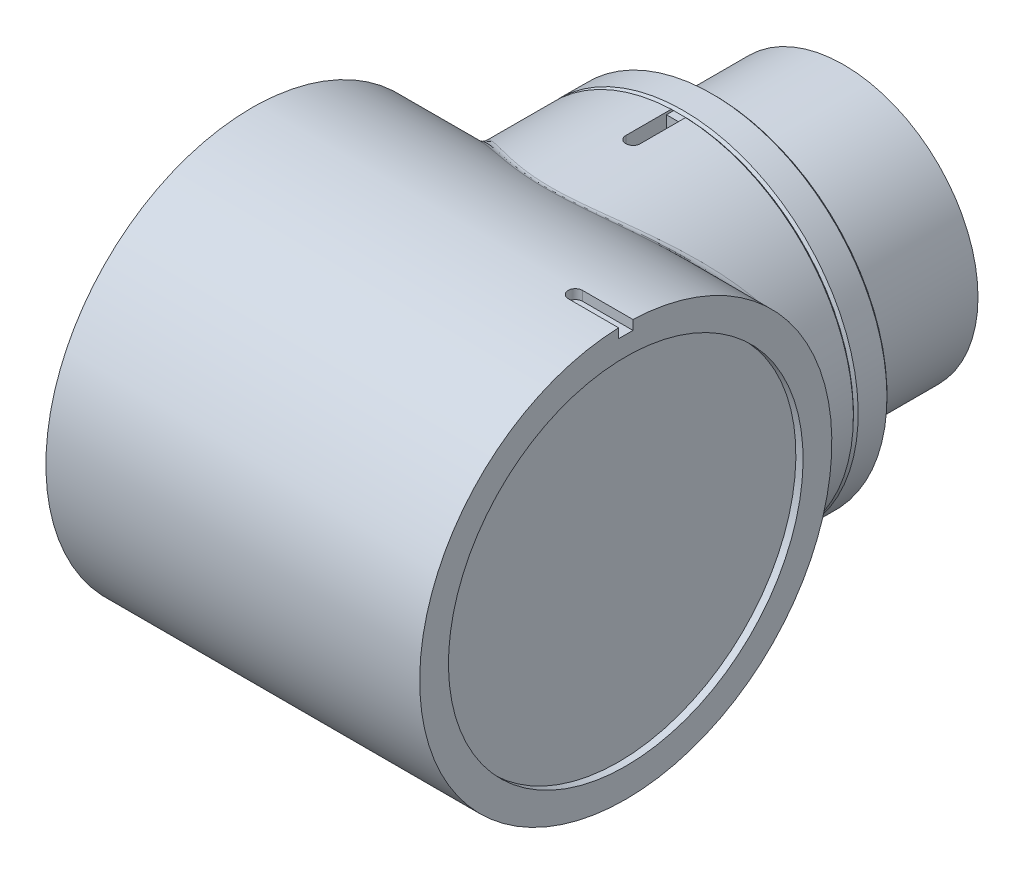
ISO-10303-21;
HEADER;
FILE_DESCRIPTION(('STEP AP214'),'2;1');
FILE_NAME('part.step','',(''),(''),'','','');
FILE_SCHEMA(('AUTOMOTIVE_DESIGN { 1 0 10303 214 1 1 1 1 }'));
ENDSEC;
DATA;
#1=APPLICATION_CONTEXT('core data for automotive mechanical design processes');
#2=APPLICATION_PROTOCOL_DEFINITION('international standard','automotive_design',2000,#1);
#3=PRODUCT_CONTEXT('',#1,'mechanical');
#4=PRODUCT('Part','Part','',(#3));
#5=PRODUCT_RELATED_PRODUCT_CATEGORY('part','',(#4));
#6=PRODUCT_DEFINITION_FORMATION('','',#4);
#7=PRODUCT_DEFINITION_CONTEXT('part definition',#1,'design');
#8=PRODUCT_DEFINITION('design','',#6,#7);
#9=PRODUCT_DEFINITION_SHAPE('','',#8);
#10=(LENGTH_UNIT() NAMED_UNIT(*) SI_UNIT(.MILLI.,.METRE.));
#11=(NAMED_UNIT(*) PLANE_ANGLE_UNIT() SI_UNIT($,.RADIAN.));
#12=(NAMED_UNIT(*) SI_UNIT($,.STERADIAN.) SOLID_ANGLE_UNIT());
#13=UNCERTAINTY_MEASURE_WITH_UNIT(LENGTH_MEASURE(1.E-05),#10,'distance_accuracy_value','');
#14=(GEOMETRIC_REPRESENTATION_CONTEXT(3) GLOBAL_UNCERTAINTY_ASSIGNED_CONTEXT((#13)) GLOBAL_UNIT_ASSIGNED_CONTEXT((#10,
#11,#12)) REPRESENTATION_CONTEXT('',''));
#15=CARTESIAN_POINT('',(0.,0.,0.));
#16=DIRECTION('',(0.,0.,1.));
#17=DIRECTION('',(1.,0.,0.));
#18=AXIS2_PLACEMENT_3D('',#15,#16,#17);
#19=CARTESIAN_POINT('',(-1.08651498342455E-12,1185.,-888.));
#20=DIRECTION('',(0.,0.,-1.));
#21=DIRECTION('',(-0.920849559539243,0.389918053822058,0.));
#22=AXIS2_PLACEMENT_3D('',#19,#20,#21);
#23=PLANE('',#22);
#24=CARTESIAN_POINT('',(-1.08651498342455E-12,1185.,-888.));
#25=DIRECTION('',(0.,0.,-1.));
#26=DIRECTION('',(-0.920849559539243,0.389918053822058,0.));
#27=AXIS2_PLACEMENT_3D('',#24,#25,#26);
#28=CIRCLE('',#27,5.);
#29=CARTESIAN_POINT('',(-4.6042477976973,1186.94959026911,-888.));
#30=VERTEX_POINT('',#29);
#31=EDGE_CURVE('P0_E10',#30,#30,#28,.F.);
#32=ORIENTED_EDGE('',*,*,#31,.T.);
#33=EDGE_LOOP('',(#32));
#34=FACE_BOUND('',#33,.T.);
#35=ADVANCED_FACE('P0_F39',(#34),#23,.F.);
#36=CARTESIAN_POINT('',(-1.08651498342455E-12,1185.,-888.));
#37=DIRECTION('',(0.,0.,-1.));
#38=DIRECTION('',(-0.920849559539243,0.389918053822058,0.));
#39=AXIS2_PLACEMENT_3D('',#36,#37,#38);
#40=CYLINDRICAL_SURFACE('',#39,5.5);
#41=CARTESIAN_POINT('',(-1.08646076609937E-12,1185.,-888.5));
#42=DIRECTION('',(0.,0.,-1.));
#43=DIRECTION('',(-0.920849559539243,0.389918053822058,0.));
#44=AXIS2_PLACEMENT_3D('',#41,#42,#43);
#45=CIRCLE('',#44,5.5);
#46=CARTESIAN_POINT('',(-5.06467257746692,1187.14454929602,-888.5));
#47=VERTEX_POINT('',#46);
#48=EDGE_CURVE('P0_E46',#47,#47,#45,.T.);
#49=ORIENTED_EDGE('',*,*,#48,.T.);
#50=EDGE_LOOP('',(#49));
#51=FACE_BOUND('',#50,.T.);
#52=CARTESIAN_POINT('',(-1.08624389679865E-12,1185.,-890.5));
#53=DIRECTION('',(0.,0.,-1.));
#54=DIRECTION('',(0.,1.,0.));
#55=AXIS2_PLACEMENT_3D('',#52,#53,#54);
#56=CIRCLE('',#55,5.5);
#57=CARTESIAN_POINT('',(-1.08624389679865E-12,1190.5,-890.5));
#58=VERTEX_POINT('',#57);
#59=EDGE_CURVE('P0_E50',#58,#58,#56,.T.);
#60=ORIENTED_EDGE('',*,*,#59,.F.);
#61=EDGE_LOOP('',(#60));
#62=FACE_BOUND('',#61,.T.);
#63=ADVANCED_FACE('P0_F59',(#51,#62),#40,.T.);
#64=CARTESIAN_POINT('',(-1.08646076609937E-12,1185.,-888.5));
#65=DIRECTION('',(0.,0.,-1.));
#66=DIRECTION('',(-0.920849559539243,0.389918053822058,0.));
#67=AXIS2_PLACEMENT_3D('',#64,#65,#66);
#68=CONICAL_SURFACE('',#67,5.5,0.785398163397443);
#69=ORIENTED_EDGE('',*,*,#31,.F.);
#70=EDGE_LOOP('',(#69));
#71=FACE_BOUND('',#70,.T.);
#72=ORIENTED_EDGE('',*,*,#48,.F.);
#73=EDGE_LOOP('',(#72));
#74=FACE_BOUND('',#73,.T.);
#75=ADVANCED_FACE('P0_F41',(#71,#74),#68,.T.);
#76=CARTESIAN_POINT('',(-4.03308873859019E-12,1185.,-890.5));
#77=DIRECTION('',(0.,0.,-1.));
#78=DIRECTION('',(0.923879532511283,0.382683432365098,0.));
#79=AXIS2_PLACEMENT_3D('',#76,#77,#78);
#80=PLANE('',#79);
#81=ORIENTED_EDGE('',*,*,#59,.T.);
#82=EDGE_LOOP('',(#81));
#83=FACE_BOUND('',#82,.T.);
#84=ADVANCED_FACE('P0_F57',(#83),#80,.T.);
#85=CLOSED_SHELL('',(#35,#63,#75,#84));
#86=MANIFOLD_SOLID_BREP('P0_B2',#85);
#87=CARTESIAN_POINT('',(-37.5,1185.,-806.));
#88=DIRECTION('',(1.,0.,0.));
#89=DIRECTION('',(0.,-1.,0.));
#90=AXIS2_PLACEMENT_3D('',#87,#88,#89);
#91=CYLINDRICAL_SURFACE('',#90,43.);
#92=CARTESIAN_POINT('',(38.3056747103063,1188.69162227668,-848.841240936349));
#93=CARTESIAN_POINT('',(36.332765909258,1188.49411077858,-848.858260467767));
#94=CARTESIAN_POINT('',(36.3157695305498,1188.66263339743,-850.83385679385));
#95=CARTESIAN_POINT('',(38.2227047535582,1189.47775946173,-848.773503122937));
#96=CARTESIAN_POINT('',(36.2613708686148,1189.2381793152,-848.797787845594));
#97=CARTESIAN_POINT('',(36.2371097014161,1189.44259735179,-850.762968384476));
#98=CARTESIAN_POINT('',(38.1133915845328,1190.25945339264,-848.6843110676));
#99=CARTESIAN_POINT('',(36.1672197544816,1189.97988603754,-848.718083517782));
#100=CARTESIAN_POINT('',(36.1334751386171,1190.21815294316,-850.669627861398));
#101=CARTESIAN_POINT('',(37.8437908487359,1191.80881745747,-848.464716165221));
#102=CARTESIAN_POINT('',(35.9335868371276,1191.45543050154,-848.520619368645));
#103=CARTESIAN_POINT('',(35.8778796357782,1191.75535045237,-850.43981924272));
#104=CARTESIAN_POINT('',(37.683506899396,1192.57648858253,-848.334316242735));
#105=CARTESIAN_POINT('',(35.7946095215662,1192.18779142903,-848.403284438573));
#106=CARTESIAN_POINT('',(35.7259221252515,1192.51699335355,-850.303354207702));
#107=CARTESIAN_POINT('',(37.3142570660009,1194.09338007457,-848.034608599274));
#108=CARTESIAN_POINT('',(35.4722976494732,1193.64101098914,-848.131761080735));
#109=CARTESIAN_POINT('',(35.3758541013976,1194.0219732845,-849.989706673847));
#110=CARTESIAN_POINT('',(37.1052840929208,1194.84259773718,-847.865295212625));
#111=CARTESIAN_POINT('',(35.2895840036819,1194.36064593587,-847.978091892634));
#112=CARTESIAN_POINT('',(35.1777368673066,1194.76530763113,-849.812518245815));
#113=CARTESIAN_POINT('',(36.6414200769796,1196.31866760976,-847.490573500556));
#114=CARTESIAN_POINT('',(34.8811998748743,1195.78472029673,-847.635591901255));
#115=CARTESIAN_POINT('',(34.7379696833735,1196.22978649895,-849.420367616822));
#116=CARTESIAN_POINT('',(36.3865263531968,1197.04551851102,-847.285163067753));
#117=CARTESIAN_POINT('',(34.6562272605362,1196.48822346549,-847.447338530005));
#118=CARTESIAN_POINT('',(34.4963171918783,1196.9509297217,-849.205403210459));
#119=CARTESIAN_POINT('',(35.8187711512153,1198.51263458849,-846.829284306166));
#120=CARTESIAN_POINT('',(34.1518351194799,1197.91407338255,-847.026744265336));
#121=CARTESIAN_POINT('',(33.9580557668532,1198.40652510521,-848.728320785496));
#122=CARTESIAN_POINT('',(35.503509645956,1199.25147652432,-846.576972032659));
#123=CARTESIAN_POINT('',(33.8707922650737,1198.6350528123,-846.793107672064));
#124=CARTESIAN_POINT('',(33.6591714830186,1199.13956520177,-848.464273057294));
#125=CARTESIAN_POINT('',(34.8288689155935,1200.69808779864,-846.039549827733));
#126=CARTESIAN_POINT('',(33.265203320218,1200.05291834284,-846.291950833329));
#127=CARTESIAN_POINT('',(33.0195770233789,1200.5748167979,-847.901854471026));
#128=CARTESIAN_POINT('',(34.4694893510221,1201.40585689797,-845.754439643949));
#129=CARTESIAN_POINT('',(32.9414733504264,1200.74938500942,-846.02508089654));
#130=CARTESIAN_POINT('',(32.6788665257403,1201.27702806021,-847.603483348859));
#131=CARTESIAN_POINT('',(33.7101032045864,1202.78839070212,-845.155340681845));
#132=CARTESIAN_POINT('',(32.2530535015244,1202.1152808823,-845.460678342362));
#133=CARTESIAN_POINT('',(31.9589290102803,1202.64870536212,-846.976519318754));
#134=CARTESIAN_POINT('',(33.3100984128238,1203.46315685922,-844.841353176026));
#135=CARTESIAN_POINT('',(31.8891096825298,1202.78458316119,-845.163720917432));
#136=CARTESIAN_POINT('',(31.5797036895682,1203.31817284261,-846.647927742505));
#137=CARTESIAN_POINT('',(32.4726382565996,1204.77854843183,-844.188329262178));
#138=CARTESIAN_POINT('',(31.1228124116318,1204.09388061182,-844.542562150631));
#139=CARTESIAN_POINT('',(30.7857479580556,1204.62323515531,-845.964530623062));
#140=CARTESIAN_POINT('',(32.0351752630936,1205.41916684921,-843.849287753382));
#141=CARTESIAN_POINT('',(30.7210932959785,1204.73398334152,-844.21882617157));
#142=CARTESIAN_POINT('',(30.3710103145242,1205.25882304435,-845.609719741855));
#143=CARTESIAN_POINT('',(30.9021287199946,1206.97185028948,-842.978011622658));
#144=CARTESIAN_POINT('',(29.6786168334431,1206.28522597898,-843.385231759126));
#145=CARTESIAN_POINT('',(29.2968233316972,1206.79931386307,-844.69791914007));
#146=CARTESIAN_POINT('',(30.1853550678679,1207.86258145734,-842.432723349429));
#147=CARTESIAN_POINT('',(29.013931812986,1207.1831227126,-842.859136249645));
#148=CARTESIAN_POINT('',(28.6172846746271,1207.6830504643,-844.127268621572));
#149=CARTESIAN_POINT('',(28.6828540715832,1209.56546296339,-841.306949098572));
#150=CARTESIAN_POINT('',(27.6114048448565,1208.90505302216,-841.765915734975));
#151=CARTESIAN_POINT('',(27.1928356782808,1209.37255990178,-842.949132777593));
#152=CARTESIAN_POINT('',(27.8970972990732,1210.3775794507,-840.726448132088));
#153=CARTESIAN_POINT('',(26.8746949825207,1209.73065483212,-841.199384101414));
#154=CARTESIAN_POINT('',(26.4478974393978,1210.17829915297,-842.341631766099));
#155=CARTESIAN_POINT('',(26.2589991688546,1211.92647359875,-839.539839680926));
#156=CARTESIAN_POINT('',(25.3310677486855,1211.30840863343,-840.035705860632));
#157=CARTESIAN_POINT('',(24.8948953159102,1211.7150304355,-841.099832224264));
#158=CARTESIAN_POINT('',(25.406381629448,1212.66290622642,-838.933631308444));
#159=CARTESIAN_POINT('',(24.5244308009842,1212.06221040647,-839.438473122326));
#160=CARTESIAN_POINT('',(24.0865695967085,1212.4456801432,-840.465428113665));
#161=CARTESIAN_POINT('',(23.64111181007,1214.05672881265,-837.710649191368));
#162=CARTESIAN_POINT('',(22.8478156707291,1213.49057758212,-838.229247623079));
#163=CARTESIAN_POINT('',(22.4130021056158,1213.82855758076,-839.185563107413));
#164=CARTESIAN_POINT('',(22.728471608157,1214.71413459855,-837.093877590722));
#165=CARTESIAN_POINT('',(21.9780035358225,1214.1671985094,-837.616864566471));
#166=CARTESIAN_POINT('',(21.5477717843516,1214.48080101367,-838.540104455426));
#167=CARTESIAN_POINT('',(21.3055205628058,1215.64734357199,-836.165189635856));
#168=CARTESIAN_POINT('',(20.6129610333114,1215.13162879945,-836.689171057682));
#169=CARTESIAN_POINT('',(20.1987402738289,1215.40668185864,-837.568221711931));
#170=CARTESIAN_POINT('',(20.8169679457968,1215.9524091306,-835.851843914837));
#171=CARTESIAN_POINT('',(20.1453079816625,1215.44622617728,-836.376762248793));
#172=CARTESIAN_POINT('',(19.7355670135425,1215.70935185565,-837.240301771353));
#173=CARTESIAN_POINT('',(19.8242714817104,1216.54187140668,-835.228312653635));
#174=CARTESIAN_POINT('',(19.1938805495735,1216.05441091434,-835.754383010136));
#175=CARTESIAN_POINT('',(18.7944391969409,1216.29418531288,-836.587769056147));
#176=CARTESIAN_POINT('',(19.3201291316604,1216.82627009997,-834.9181268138));
#177=CARTESIAN_POINT('',(18.7100449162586,1216.34826425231,-835.444278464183));
#178=CARTESIAN_POINT('',(18.3164860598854,1216.57635073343,-836.26315596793));
#179=CARTESIAN_POINT('',(18.2955386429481,1217.37441750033,-834.303125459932));
#180=CARTESIAN_POINT('',(17.7256483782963,1216.91484272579,-834.828845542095));
#181=CARTESIAN_POINT('',(17.345121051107,1217.12019374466,-835.619549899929));
#182=CARTESIAN_POINT('',(17.7750782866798,1217.63815019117,-833.998314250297));
#183=CARTESIAN_POINT('',(17.22498187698,1217.18781112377,-834.523360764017));
#184=CARTESIAN_POINT('',(16.8516975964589,1217.38185544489,-835.300561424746));
#185=CARTESIAN_POINT('',(16.7177330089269,1218.14437890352,-833.397162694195));
#186=CARTESIAN_POINT('',(16.2068969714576,1217.71189714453,-833.920411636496));
#187=CARTESIAN_POINT('',(15.8492793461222,1217.88410893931,-834.671449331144));
#188=CARTESIAN_POINT('',(16.1808484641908,1218.38687541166,-833.100822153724));
#189=CARTESIAN_POINT('',(15.6893611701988,1217.96326521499,-833.622765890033));
#190=CARTESIAN_POINT('',(15.3402849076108,1218.12470121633,-834.361325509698));
#191=CARTESIAN_POINT('',(15.0930802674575,1218.84880968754,-832.52158597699));
#192=CARTESIAN_POINT('',(14.6399523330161,1218.44216952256,-833.04061818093));
#193=CARTESIAN_POINT('',(14.3090241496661,1218.58300810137,-833.755148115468));
#194=CARTESIAN_POINT('',(14.5422918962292,1219.06836902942,-832.238624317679));
#195=CARTESIAN_POINT('',(14.1080471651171,1218.67006116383,-832.755861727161));
#196=CARTESIAN_POINT('',(13.7868481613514,1218.80084332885,-833.459025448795));
#197=CARTESIAN_POINT('',(13.4231081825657,1219.48524304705,-831.688269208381));
#198=CARTESIAN_POINT('',(13.0265383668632,1219.10276476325,-832.201777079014));
#199=CARTESIAN_POINT('',(12.7258038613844,1219.21444379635,-832.883072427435));
#200=CARTESIAN_POINT('',(12.8547109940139,1219.68255538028,-831.420877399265));
#201=CARTESIAN_POINT('',(12.4767547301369,1219.30780114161,-831.932232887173));
#202=CARTESIAN_POINT('',(12.1869337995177,1219.41020671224,-832.603243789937));
#203=CARTESIAN_POINT('',(11.7005919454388,1220.05360558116,-830.90672789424));
#204=CARTESIAN_POINT('',(11.3598609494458,1219.69334311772,-831.413807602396));
#205=CARTESIAN_POINT('',(11.0927689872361,1219.77834319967,-832.06518035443));
#206=CARTESIAN_POINT('',(11.1148967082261,1220.22737758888,-830.659940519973));
#207=CARTESIAN_POINT('',(10.7925655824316,1219.87409741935,-831.164666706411));
#208=CARTESIAN_POINT('',(10.5374994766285,1219.95075064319,-831.806914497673));
#209=CARTESIAN_POINT('',(9.92524178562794,1220.55028487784,-830.192106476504));
#210=CARTESIAN_POINT('',(9.63985645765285,1220.20991116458,-830.692329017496));
#211=CARTESIAN_POINT('',(9.4096448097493,1220.27112226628,-831.317320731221));
#212=CARTESIAN_POINT('',(9.32128892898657,1220.6994292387,-829.971050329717));
#213=CARTESIAN_POINT('',(9.05418939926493,1220.36518014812,-830.468882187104));
#214=CARTESIAN_POINT('',(8.83706612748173,1220.41909545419,-831.085982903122));
#215=CARTESIAN_POINT('',(8.13903820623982,1220.96175239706,-829.575509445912));
#216=CARTESIAN_POINT('',(7.90733246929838,1220.63822095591,-830.069051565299));
#217=CARTESIAN_POINT('',(7.71623102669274,1220.67935869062,-830.672044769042));
#218=CARTESIAN_POINT('',(7.56199267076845,1221.07674005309,-829.398825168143));
#219=CARTESIAN_POINT('',(7.34725280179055,1220.75800104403,-829.890289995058));
#220=CARTESIAN_POINT('',(7.16916188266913,1220.79344339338,-830.487142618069));
#221=CARTESIAN_POINT('',(6.39329919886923,1221.28254163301,-829.078420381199));
#222=CARTESIAN_POINT('',(6.21280024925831,1220.97230214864,-829.566184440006));
#223=CARTESIAN_POINT('',(6.06117975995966,1220.99762889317,-830.151835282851));
#224=CARTESIAN_POINT('',(5.80165326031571,1221.37335884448,-828.934695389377));
#225=CARTESIAN_POINT('',(5.63813107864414,1221.0669547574,-829.42065437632));
#226=CARTESIAN_POINT('',(5.50026867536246,1221.08773295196,-830.001425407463));
#227=CARTESIAN_POINT('',(4.60732103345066,1221.52903784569,-828.685920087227));
#228=CARTESIAN_POINT('',(4.47808866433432,1221.22913216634,-829.168845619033));
#229=CARTESIAN_POINT('',(4.36797968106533,1221.2421894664,-829.741079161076));
#230=CARTESIAN_POINT('',(4.00466644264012,1221.593964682,-828.580772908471));
#231=CARTESIAN_POINT('',(3.89240475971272,1221.29682811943,-829.062313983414));
#232=CARTESIAN_POINT('',(3.79663182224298,1221.30660645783,-829.631041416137));
#233=CARTESIAN_POINT('',(2.79029291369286,1221.69676350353,-828.413328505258));
#234=CARTESIAN_POINT('',(2.71239762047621,1221.40394948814,-828.892752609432));
#235=CARTESIAN_POINT('',(2.6453426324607,1221.4085980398,-829.455808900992));
#236=CARTESIAN_POINT('',(2.17857424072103,1221.73463627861,-828.351030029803));
#237=CARTESIAN_POINT('',(2.11768791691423,1221.443448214,-828.829608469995));
#238=CARTESIAN_POINT('',(2.06540155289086,1221.44617341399,-829.390612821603));
#239=CARTESIAN_POINT('',(0.946357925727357,1221.78252448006,-828.272137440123));
#240=CARTESIAN_POINT('',(0.920051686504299,1221.49335836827,-828.74969821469));
#241=CARTESIAN_POINT('',(0.897196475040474,1221.49368556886,-829.308050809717));
#242=CARTESIAN_POINT('',(0.325828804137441,1221.79234291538,-828.255866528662));
#243=CARTESIAN_POINT('',(0.316670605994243,1221.5035997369,-828.733203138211));
#244=CARTESIAN_POINT('',(0.308902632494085,1221.50342690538,-829.291023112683));
#245=CARTESIAN_POINT('',(-0.9143453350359,1221.78328574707,-828.270831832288));
#246=CARTESIAN_POINT('',(-0.888779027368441,1221.49415975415,-828.748362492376));
#247=CARTESIAN_POINT('',(-0.866846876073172,1221.49444085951,-829.306684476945));
#248=CARTESIAN_POINT('',(-1.53399036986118,1221.76441071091,-828.302067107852));
#249=CARTESIAN_POINT('',(-1.49128120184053,1221.47447220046,-828.780026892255));
#250=CARTESIAN_POINT('',(-1.45430255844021,1221.47571404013,-829.339372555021));
#251=CARTESIAN_POINT('',(-2.7681413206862,1221.69843481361,-828.410462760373));
#252=CARTESIAN_POINT('',(-2.69073043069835,1221.40571303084,-828.889814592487));
#253=CARTESIAN_POINT('',(-2.62434177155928,1221.41025622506,-829.452809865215));
#254=CARTESIAN_POINT('',(-3.38263742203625,1221.65128881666,-828.487696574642));
#255=CARTESIAN_POINT('',(-3.28808549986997,1221.3565457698,-828.968089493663));
#256=CARTESIAN_POINT('',(-3.20691599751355,1221.36348044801,-829.533635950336));
#257=CARTESIAN_POINT('',(-4.60118413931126,1221.52991074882,-828.684330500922));
#258=CARTESIAN_POINT('',(-4.47200799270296,1221.23007487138,-829.16718414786));
#259=CARTESIAN_POINT('',(-4.36216158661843,1221.24305551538,-829.73941564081));
#260=CARTESIAN_POINT('',(-5.20523295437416,1221.45567405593,-828.803737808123));
#261=CARTESIAN_POINT('',(-5.05895687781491,1221.15268085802,-829.288143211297));
#262=CARTESIAN_POINT('',(-4.93483124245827,1221.16940177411,-829.864376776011));
#263=CARTESIAN_POINT('',(-6.57958386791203,1221.25545539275,-829.121136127));
#264=CARTESIAN_POINT('',(-6.39403459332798,1220.94406143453,-829.609456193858));
#265=CARTESIAN_POINT('',(-6.23778730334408,1220.97075535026,-830.196537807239));
#266=CARTESIAN_POINT('',(-7.3452196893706,1221.12062468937,-829.331961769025));
#267=CARTESIAN_POINT('',(-7.13760526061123,1220.80350737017,-829.822945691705));
#268=CARTESIAN_POINT('',(-6.96364983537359,1220.83698342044,-830.417169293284));
#269=CARTESIAN_POINT('',(-8.85036174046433,1220.81121585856,-829.804121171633));
#270=CARTESIAN_POINT('',(-8.59794995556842,1220.48142965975,-830.300314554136));
#271=CARTESIAN_POINT('',(-8.39060268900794,1220.53000425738,-830.911289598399));
#272=CARTESIAN_POINT('',(-9.5898517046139,1220.63661347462,-830.065485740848));
#273=CARTESIAN_POINT('',(-9.31530784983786,1220.29956616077,-830.564651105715));
#274=CARTESIAN_POINT('',(-9.09167759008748,1220.3567729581,-831.18481065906));
#275=CARTESIAN_POINT('',(-10.679510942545,1220.34704150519,-830.487056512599));
#276=CARTESIAN_POINT('',(-10.3699994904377,1219.99875495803,-830.989828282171));
#277=CARTESIAN_POINT('',(-10.1247311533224,1220.06947488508,-831.625989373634));
#278=CARTESIAN_POINT('',(-11.0400083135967,1220.24572857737,-830.632748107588));
#279=CARTESIAN_POINT('',(-10.7192515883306,1219.89338414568,-831.136917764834));
#280=CARTESIAN_POINT('',(-10.4665013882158,1219.96895752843,-831.778457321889));
#281=CARTESIAN_POINT('',(-11.7540464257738,1220.03426891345,-830.932582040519));
#282=CARTESIAN_POINT('',(-11.4107040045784,1219.67356513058,-831.43945030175));
#283=CARTESIAN_POINT('',(-11.143446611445,1219.75915837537,-832.092237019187));
#284=CARTESIAN_POINT('',(-12.1075902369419,1219.92412619,-831.086720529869));
#285=CARTESIAN_POINT('',(-11.7529617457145,1219.55907387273,-831.594943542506));
#286=CARTESIAN_POINT('',(-11.478624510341,1219.64988056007,-832.253544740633));
#287=CARTESIAN_POINT('',(-13.1582995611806,1219.58078090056,-831.560151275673));
#288=CARTESIAN_POINT('',(-12.7710796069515,1219.20184666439,-832.072917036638));
#289=CARTESIAN_POINT('',(-12.4747515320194,1219.30923142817,-832.748995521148));
#290=CARTESIAN_POINT('',(-13.8454885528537,1219.33467577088,-831.890437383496));
#291=CARTESIAN_POINT('',(-13.4356151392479,1218.94609440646,-832.405822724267));
#292=CARTESIAN_POINT('',(-13.1262423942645,1219.06505886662,-833.094643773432));
#293=CARTESIAN_POINT('',(-15.0749446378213,1218.85628278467,-832.511841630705));
#294=CARTESIAN_POINT('',(-14.6223978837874,1218.45000413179,-833.030745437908));
#295=CARTESIAN_POINT('',(-14.2918306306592,1218.59042251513,-833.744950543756));
#296=CARTESIAN_POINT('',(-15.6213679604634,1218.62923412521,-832.799571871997));
#297=CARTESIAN_POINT('',(-15.1497905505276,1218.21443415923,-833.320127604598));
#298=CARTESIAN_POINT('',(-14.809868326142,1218.36515678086,-834.04606358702));
#299=CARTESIAN_POINT('',(-16.6975568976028,1218.1536891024,-833.385676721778));
#300=CARTESIAN_POINT('',(-16.1873969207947,1217.72163809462,-833.908803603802));
#301=CARTESIAN_POINT('',(-15.8301513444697,1217.89334602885,-834.659429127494));
#302=CARTESIAN_POINT('',(-17.2273210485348,1217.90519086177,-833.684052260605));
#303=CARTESIAN_POINT('',(-16.6977453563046,1217.46416876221,-834.20829206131));
#304=CARTESIAN_POINT('',(-16.3323952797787,1217.64679914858,-834.971682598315));
#305=CARTESIAN_POINT('',(-18.2709301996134,1217.38711794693,-834.288391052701));
#306=CARTESIAN_POINT('',(-17.7019364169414,1216.92808028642,-834.814015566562));
#307=CARTESIAN_POINT('',(-17.3217909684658,1217.13279445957,-835.604130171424));
#308=CARTESIAN_POINT('',(-18.7847681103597,1217.11753406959,-834.594357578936));
#309=CARTESIAN_POINT('',(-18.1958783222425,1216.64920217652,-835.120425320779));
#310=CARTESIAN_POINT('',(-17.8089360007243,1216.86532751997,-835.924327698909));
#311=CARTESIAN_POINT('',(-19.7967300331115,1216.55766541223,-835.211083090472));
#312=CARTESIAN_POINT('',(-19.1674283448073,1216.07082222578,-835.737111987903));
#313=CARTESIAN_POINT('',(-18.7683284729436,1216.30985529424,-836.569738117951));
#314=CARTESIAN_POINT('',(-20.2948523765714,1216.26737844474,-835.52184257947));
#315=CARTESIAN_POINT('',(-19.645115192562,1215.77106038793,-836.04753884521));
#316=CARTESIAN_POINT('',(-19.2405743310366,1216.02184783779,-836.894951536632));
#317=CARTESIAN_POINT('',(-21.7672300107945,1215.36501417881,-836.458451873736));
#318=CARTESIAN_POINT('',(-21.0602944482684,1214.83716820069,-836.985027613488));
#319=CARTESIAN_POINT('',(-20.6364648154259,1215.12656948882,-837.875124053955));
#320=CARTESIAN_POINT('',(-22.718418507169,1214.72196976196,-837.087997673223));
#321=CARTESIAN_POINT('',(-21.9688147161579,1214.17422001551,-837.611545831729));
#322=CARTESIAN_POINT('',(-21.5382409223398,1214.4885746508,-838.533951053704));
#323=CARTESIAN_POINT('',(-24.5585965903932,1213.35414558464,-838.340425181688));
#324=CARTESIAN_POINT('',(-23.7205203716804,1212.77010368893,-838.852800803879));
#325=CARTESIAN_POINT('',(-23.2828253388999,1213.1314914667,-839.844631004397));
#326=CARTESIAN_POINT('',(-25.4475997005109,1212.62938368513,-838.963308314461));
#327=CARTESIAN_POINT('',(-24.5637180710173,1212.02678001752,-839.468113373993));
#328=CARTESIAN_POINT('',(-24.1256464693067,1212.41242084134,-840.496485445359));
#329=CARTESIAN_POINT('',(-27.1872441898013,1211.07398170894,-840.207737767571));
#330=CARTESIAN_POINT('',(-26.2078240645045,1210.43872950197,-840.692187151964));
#331=CARTESIAN_POINT('',(-25.7749198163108,1210.86923283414,-841.79879533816));
#332=CARTESIAN_POINT('',(-28.0358794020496,1210.24078048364,-840.82865999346));
#333=CARTESIAN_POINT('',(-27.0056442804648,1209.58977248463,-841.299913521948));
#334=CARTESIAN_POINT('',(-26.5794700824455,1210.04257441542,-842.448597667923));
#335=CARTESIAN_POINT('',(-29.6586320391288,1208.48640083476,-842.035024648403));
#336=CARTESIAN_POINT('',(-28.5244299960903,1207.81208947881,-842.474617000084));
#337=CARTESIAN_POINT('',(-28.1179238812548,1208.30197123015,-843.711072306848));
#338=CARTESIAN_POINT('',(-30.4327338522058,1207.5652040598,-842.620459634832));
#339=CARTESIAN_POINT('',(-29.2441690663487,1206.88136019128,-843.041024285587));
#340=CARTESIAN_POINT('',(-28.8518126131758,1207.38800825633,-844.323736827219));
#341=CARTESIAN_POINT('',(-31.8953642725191,1205.63825359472,-843.739887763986));
#342=CARTESIAN_POINT('',(-30.5973874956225,1204.94645551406,-844.118094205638));
#343=CARTESIAN_POINT('',(-30.2384622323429,1205.4761893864,-845.495231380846));
#344=CARTESIAN_POINT('',(-32.584148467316,1204.63276837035,-844.274033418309));
#345=CARTESIAN_POINT('',(-31.2292628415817,1203.94112132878,-844.627706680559));
#346=CARTESIAN_POINT('',(-30.8914654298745,1204.4785998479,-846.054221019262));
#347=CARTESIAN_POINT('',(-33.5461643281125,1203.06247076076,-845.026712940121));
#348=CARTESIAN_POINT('',(-32.103038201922,1202.38888935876,-845.338325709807));
#349=CARTESIAN_POINT('',(-31.8035064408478,1202.920633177,-846.841908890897));
#350=CARTESIAN_POINT('',(-33.8549239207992,1202.52880133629,-845.269474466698));
#351=CARTESIAN_POINT('',(-32.3836276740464,1201.86025950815,-845.567622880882));
#352=CARTESIAN_POINT('',(-32.0962265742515,1202.39115445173,-847.095961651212));
#353=CARTESIAN_POINT('',(-34.4473887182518,1201.44108561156,-845.737150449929));
#354=CARTESIAN_POINT('',(-32.920426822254,1200.78610905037,-846.00795910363));
#355=CARTESIAN_POINT('',(-32.6579139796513,1201.31198013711,-847.58539000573));
#356=CARTESIAN_POINT('',(-34.7310884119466,1200.88703486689,-845.962060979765));
#357=CARTESIAN_POINT('',(-33.1762689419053,1200.24065413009,-846.218714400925));
#358=CARTESIAN_POINT('',(-32.9268760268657,1200.76228013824,-847.820761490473));
#359=CARTESIAN_POINT('',(-35.3532305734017,1199.58944269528,-846.456950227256));
#360=CARTESIAN_POINT('',(-33.7364321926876,1198.96537332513,-846.681637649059));
#361=CARTESIAN_POINT('',(-33.5166991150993,1199.47487745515,-848.338668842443));
#362=CARTESIAN_POINT('',(-35.6823699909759,1198.83915798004,-846.720057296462));
#363=CARTESIAN_POINT('',(-34.0302895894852,1198.23229572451,-846.925651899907));
#364=CARTESIAN_POINT('',(-33.8287403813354,1198.73048443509,-848.614013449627));
#365=CARTESIAN_POINT('',(-36.2912644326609,1197.30879435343,-847.20847612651));
#366=CARTESIAN_POINT('',(-34.572144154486,1196.74285701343,-847.377050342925));
#367=CARTESIAN_POINT('',(-34.4060039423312,1197.21213816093,-849.125149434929));
#368=CARTESIAN_POINT('',(-36.5710335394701,1196.52872401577,-847.433798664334));
#369=CARTESIAN_POINT('',(-34.8192541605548,1195.98725441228,-847.583713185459));
#370=CARTESIAN_POINT('',(-34.6712395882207,1196.43819341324,-849.360952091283));
#371=CARTESIAN_POINT('',(-37.0774044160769,1194.94275151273,-847.842703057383));
#372=CARTESIAN_POINT('',(-35.2653464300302,1194.45635251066,-847.95770357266));
#373=CARTESIAN_POINT('',(-35.1513054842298,1194.8646749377,-849.788875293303));
#374=CARTESIAN_POINT('',(-37.3040368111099,1194.13686453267,-848.026308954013));
#375=CARTESIAN_POINT('',(-35.4634799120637,1193.68220247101,-848.124329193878));
#376=CARTESIAN_POINT('',(-35.3661647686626,1194.06511627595,-849.981020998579));
#377=CARTESIAN_POINT('',(-37.7008844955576,1192.50357454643,-848.348425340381));
#378=CARTESIAN_POINT('',(-35.8098660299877,1192.11753089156,-848.416140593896));
#379=CARTESIAN_POINT('',(-35.7423969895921,1192.44465188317,-850.318119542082));
#380=CARTESIAN_POINT('',(-37.8710982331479,1191.6761709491,-848.486934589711));
#381=CARTESIAN_POINT('',(-35.9573351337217,1191.32853735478,-848.540671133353));
#382=CARTESIAN_POINT('',(-35.9037684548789,1191.62374556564,-850.463071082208));
#383=CARTESIAN_POINT('',(-38.1508828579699,1190.01361567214,-848.714878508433));
#384=CARTESIAN_POINT('',(-36.1996630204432,1189.74591571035,-848.745529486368));
#385=CARTESIAN_POINT('',(-36.1690188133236,1189.97424569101,-850.701617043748));
#386=CARTESIAN_POINT('',(-38.2610185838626,1189.1786139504,-848.804770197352));
#387=CARTESIAN_POINT('',(-36.294423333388,1188.95418205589,-848.825773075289));
#388=CARTESIAN_POINT('',(-36.2734332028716,1189.14580091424,-850.795689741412));
#389=CARTESIAN_POINT('',(-38.4211627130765,1187.49955535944,-848.935547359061));
#390=CARTESIAN_POINT('',(-36.4323901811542,1187.36284836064,-848.942660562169));
#391=CARTESIAN_POINT('',(-36.4252581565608,1187.47992731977,-850.932549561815));
#392=CARTESIAN_POINT('',(-38.4711735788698,1186.65549886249,-848.976434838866));
#393=CARTESIAN_POINT('',(-36.4752365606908,1186.56530085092,-848.978999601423));
#394=CARTESIAN_POINT('',(-36.4726710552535,1186.64249887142,-850.97533878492));
#395=CARTESIAN_POINT('',(-38.5101479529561,1184.96504426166,-849.008295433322));
#396=CARTESIAN_POINT('',(-36.5087287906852,1184.96651862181,-849.007402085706));
#397=CARTESIAN_POINT('',(-36.5096207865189,1184.96531875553,-851.008681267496));
#398=CARTESIAN_POINT('',(-38.499104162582,1184.11864588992,-848.999262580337));
#399=CARTESIAN_POINT('',(-36.499277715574,1184.16745179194,-848.999383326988));
#400=CARTESIAN_POINT('',(-36.499150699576,1184.12556682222,-850.999228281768));
#401=CARTESIAN_POINT('',(-38.416164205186,1182.43055577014,-848.931476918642));
#402=CARTESIAN_POINT('',(-36.4279629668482,1182.57016358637,-848.938919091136));
#403=CARTESIAN_POINT('',(-36.4205193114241,1182.45073262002,-850.92828979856));
#404=CARTESIAN_POINT('',(-38.3442635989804,1181.58886436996,-848.87272048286));
#405=CARTESIAN_POINT('',(-36.366287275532,1181.77408463,-848.88663297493));
#406=CARTESIAN_POINT('',(-36.3523538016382,1181.61565069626,-850.866800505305));
#407=CARTESIAN_POINT('',(-38.1311813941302,1179.83700901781,-848.698832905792));
#408=CARTESIAN_POINT('',(-36.182457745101,1180.11185546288,-848.730989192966));
#409=CARTESIAN_POINT('',(-36.1503408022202,1179.87755198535,-850.684825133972));
#410=CARTESIAN_POINT('',(-37.9840381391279,1178.92798415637,-848.578852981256));
#411=CARTESIAN_POINT('',(-36.0556191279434,1179.24837937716,-848.623677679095));
#412=CARTESIAN_POINT('',(-36.0108413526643,1178.97566534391,-850.559264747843));
#413=CARTESIAN_POINT('',(-37.6213043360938,1177.13163630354,-848.283776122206));
#414=CARTESIAN_POINT('',(-35.7404109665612,1177.53378074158,-848.357583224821));
#415=CARTESIAN_POINT('',(-35.6669508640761,1177.19342351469,-850.25046338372));
#416=CARTESIAN_POINT('',(-37.4057064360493,1176.2443156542,-848.108673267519));
#417=CARTESIAN_POINT('',(-35.5529257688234,1176.68486250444,-848.199543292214));
#418=CARTESIAN_POINT('',(-35.4625528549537,1176.31307065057,-850.067216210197));
#419=CARTESIAN_POINT('',(-36.909996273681,1174.49759274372,-847.707350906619));
#420=CARTESIAN_POINT('',(-35.1181485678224,1175.00487481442,-847.834156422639));
#421=CARTESIAN_POINT('',(-34.9925938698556,1174.58006407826,-849.64722769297));
#422=CARTESIAN_POINT('',(-36.6298409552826,1173.6382095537,-847.481097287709));
#423=CARTESIAN_POINT('',(-34.8718950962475,1174.17550754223,-847.627673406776));
#424=CARTESIAN_POINT('',(-34.7269920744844,1173.72742929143,-849.410450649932));
#425=CARTESIAN_POINT('',(-36.0097985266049,1171.95332548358,-846.982390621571));
#426=CARTESIAN_POINT('',(-34.3222352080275,1172.5408073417,-847.168592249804));
#427=CARTESIAN_POINT('',(-34.1391596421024,1172.05577596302,-848.888548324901));
#428=CARTESIAN_POINT('',(-35.6699114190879,1171.12782460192,-846.709937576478));
#429=CARTESIAN_POINT('',(-34.0199807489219,1171.73662362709,-846.916937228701));
#430=CARTESIAN_POINT('',(-33.8169290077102,1171.2367574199,-848.603423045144));
#431=CARTESIAN_POINT('',(-34.9385264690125,1169.52170574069,-846.126625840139));
#432=CARTESIAN_POINT('',(-33.3643071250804,1170.16405944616,-846.373717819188));
#433=CARTESIAN_POINT('',(-33.123538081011,1169.64325078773,-847.992980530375));
#434=CARTESIAN_POINT('',(-34.5475064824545,1168.74075811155,-845.816124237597));
#435=CARTESIAN_POINT('',(-33.0124942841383,1169.39613442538,-846.083431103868));
#436=CARTESIAN_POINT('',(-32.7528308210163,1168.8684356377,-847.668036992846));
#437=CARTESIAN_POINT('',(-33.7160672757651,1167.21832796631,-845.159923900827));
#438=CARTESIAN_POINT('',(-32.2590232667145,1167.89245637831,-845.46546245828));
#439=CARTESIAN_POINT('',(-31.9645832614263,1167.35796054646,-846.981315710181));
#440=CARTESIAN_POINT('',(-33.2756271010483,1166.47686238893,-844.81421024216));
#441=CARTESIAN_POINT('',(-31.8583344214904,1167.15689496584,-845.138529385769));
#442=CARTESIAN_POINT('',(-31.5470230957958,1166.62231741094,-846.619522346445));
#443=CARTESIAN_POINT('',(-32.3496410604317,1165.03518915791,-844.092732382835));
#444=CARTESIAN_POINT('',(-31.01053943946,1165.72123789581,-844.451840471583));
#445=CARTESIAN_POINT('',(-30.6691402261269,1165.19196508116,-845.864487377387));
#446=CARTESIAN_POINT('',(-31.8640821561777,1164.33499352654,-843.716959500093));
#447=CARTESIAN_POINT('',(-30.5642650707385,1165.0209847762,-844.092692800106));
#448=CARTESIAN_POINT('',(-30.2088051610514,1164.49726781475,-845.47123668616));
#449=CARTESIAN_POINT('',(-30.8519098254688,1162.97717987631,-842.940588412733));
#450=CARTESIAN_POINT('',(-29.6288584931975,1163.65874831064,-843.346567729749));
#451=CARTESIAN_POINT('',(-29.2492132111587,1163.15011654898,-844.658755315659));
#452=CARTESIAN_POINT('',(-30.3253047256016,1162.31955327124,-842.539995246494));
#453=CARTESIAN_POINT('',(-29.1404132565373,1162.99633361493,-842.960047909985));
#454=CARTESIAN_POINT('',(-28.7499642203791,1162.49765403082,-844.239529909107));
#455=CARTESIAN_POINT('',(-29.0027802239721,1160.77725183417,-841.544628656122));
#456=CARTESIAN_POINT('',(-27.9114858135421,1161.4433186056,-841.997895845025));
#457=CARTESIAN_POINT('',(-27.4961422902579,1160.96746368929,-843.197867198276));
#458=CARTESIAN_POINT('',(-28.1873052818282,1159.91446456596,-840.939509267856));
#459=CARTESIAN_POINT('',(-27.1479820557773,1160.56697643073,-841.408181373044));
#460=CARTESIAN_POINT('',(-26.7230296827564,1160.11145155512,-842.564602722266));
#461=CARTESIAN_POINT('',(-26.4862278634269,1158.27534516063,-839.702345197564));
#462=CARTESIAN_POINT('',(-25.546432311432,1158.89845136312,-840.196051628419));
#463=CARTESIAN_POINT('',(-25.1103199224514,1158.48520351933,-841.269896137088));
#464=CARTESIAN_POINT('',(-25.6005940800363,1157.49905199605,-839.070288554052));
#465=CARTESIAN_POINT('',(-24.7091288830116,1158.10411813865,-839.573769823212));
#466=CARTESIAN_POINT('',(-24.2706930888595,1157.7150062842,-840.608441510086));
#467=CARTESIAN_POINT('',(-23.7621750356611,1156.03160010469,-837.792742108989));
#468=CARTESIAN_POINT('',(-22.9637854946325,1156.60078581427,-838.311155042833));
#469=CARTESIAN_POINT('',(-22.5277763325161,1156.25907772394,-839.271474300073));
#470=CARTESIAN_POINT('',(-22.8093002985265,1155.3405583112,-837.14723524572));
#471=CARTESIAN_POINT('',(-22.0558349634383,1155.88955130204,-837.670363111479));
#472=CARTESIAN_POINT('',(-21.6244015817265,1155.57346241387,-838.595943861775));
#473=CARTESIAN_POINT('',(-21.331766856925,1154.3690761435,-836.182035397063));
#474=CARTESIAN_POINT('',(-20.6381719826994,1154.88536276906,-836.706025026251));
#475=CARTESIAN_POINT('',(-20.2236231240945,1154.60960891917,-837.585850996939));
#476=CARTESIAN_POINT('',(-20.8312617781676,1154.05611847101,-835.86083836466));
#477=CARTESIAN_POINT('',(-20.1590923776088,1154.56262722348,-836.3857954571));
#478=CARTESIAN_POINT('',(-19.7491183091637,1154.29910878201,-837.249714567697));
#479=CARTESIAN_POINT('',(-19.8138680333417,1153.45191124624,-835.221761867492));
#480=CARTESIAN_POINT('',(-19.1839977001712,1153.93923015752,-835.747902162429));
#481=CARTESIAN_POINT('',(-18.7845761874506,1153.69964616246,-836.580913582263));
#482=CARTESIAN_POINT('',(-19.2969804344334,1153.1606602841,-834.903882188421));
#483=CARTESIAN_POINT('',(-18.6879158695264,1153.63828280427,-835.430093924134));
#484=CARTESIAN_POINT('',(-18.2945398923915,1153.4106822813,-836.248248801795));
#485=CARTESIAN_POINT('',(-18.0528538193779,1152.49674428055,-834.157964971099));
#486=CARTESIAN_POINT('',(-17.4940318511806,1152.95288108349,-834.684546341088));
#487=CARTESIAN_POINT('',(-17.1150432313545,1152.75197975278,-835.467637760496));
#488=CARTESIAN_POINT('',(-17.3182927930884,1152.13363024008,-833.73250215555));
#489=CARTESIAN_POINT('',(-16.7869725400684,1152.57672218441,-834.257783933));
#490=CARTESIAN_POINT('',(-16.418641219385,1152.39171710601,-835.022385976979));
#491=CARTESIAN_POINT('',(-15.8164134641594,1151.44947578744,-832.900786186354));
#492=CARTESIAN_POINT('',(-15.3396242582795,1151.86799139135,-833.422835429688));
#493=CARTESIAN_POINT('',(-14.9947815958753,1151.71293505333,-834.151985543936));
#494=CARTESIAN_POINT('',(-15.049093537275,1151.12843746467,-832.494533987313));
#495=CARTESIAN_POINT('',(-14.5989745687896,1151.53474336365,-833.014126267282));
#496=CARTESIAN_POINT('',(-14.2673224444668,1151.39441772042,-833.726837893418));
#497=CARTESIAN_POINT('',(-13.4813172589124,1150.53086207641,-831.712253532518));
#498=CARTESIAN_POINT('',(-13.0843469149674,1150.91458584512,-832.226749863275));
#499=CARTESIAN_POINT('',(-12.7809890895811,1150.8015348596,-832.908172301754));
#500=CARTESIAN_POINT('',(-12.6809340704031,1150.25423274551,-831.336163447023));
#501=CARTESIAN_POINT('',(-12.3099777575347,1150.62694955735,-831.847431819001));
#502=CARTESIAN_POINT('',(-12.0221842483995,1150.52707779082,-832.514589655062));
#503=CARTESIAN_POINT('',(-11.4536109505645,1149.87440322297,-830.804035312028));
#504=CARTESIAN_POINT('',(-11.1200004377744,1150.2315727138,-831.309858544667));
#505=CARTESIAN_POINT('',(-10.8586181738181,1150.1502309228,-831.957711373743));
#506=CARTESIAN_POINT('',(-11.040115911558,1149.7536628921,-830.632019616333));
#507=CARTESIAN_POINT('',(-10.7194939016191,1150.10601085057,-831.136227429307));
#508=CARTESIAN_POINT('',(-10.4666033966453,1150.0304387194,-831.77769494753));
#509=CARTESIAN_POINT('',(-10.2038926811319,1149.52430187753,-830.300523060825));
#510=CARTESIAN_POINT('',(-9.9092955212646,1149.86749414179,-830.801562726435));
#511=CARTESIAN_POINT('',(-9.67382033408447,1149.80287878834,-831.430779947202));
#512=CARTESIAN_POINT('',(-9.78116239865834,1149.41568397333,-830.141045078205));
#513=CARTESIAN_POINT('',(-9.49951101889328,1149.75447178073,-830.640447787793));
#514=CARTESIAN_POINT('',(-9.27305006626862,1149.69511381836,-831.263884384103));
#515=CARTESIAN_POINT('',(-8.77890745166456,1149.17581530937,-829.784209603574));
#516=CARTESIAN_POINT('',(-8.5281390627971,1149.50500423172,-830.280074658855));
#517=CARTESIAN_POINT('',(-8.32286031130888,1149.45712874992,-830.890451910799));
#518=CARTESIAN_POINT('',(-8.19567222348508,1149.04971082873,-829.59280192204));
#519=CARTESIAN_POINT('',(-7.96222404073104,1149.37367036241,-830.086477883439));
#520=CARTESIAN_POINT('',(-7.7699230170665,1149.33201451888,-830.690141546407));
#521=CARTESIAN_POINT('',(-7.01363466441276,1148.82212907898,-829.242318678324));
#522=CARTESIAN_POINT('',(-6.81511675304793,1149.13673262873,-829.732043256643));
#523=CARTESIAN_POINT('',(-6.64929000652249,1149.10621988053,-830.32335675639));
#524=CARTESIAN_POINT('',(-6.41483787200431,1148.7206431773,-829.083231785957));
#525=CARTESIAN_POINT('',(-6.23363113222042,1149.03097606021,-829.570995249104));
#526=CARTESIAN_POINT('',(-6.08159954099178,1149.00553090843,-830.156870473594));
#527=CARTESIAN_POINT('',(-5.20450762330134,1148.54412239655,-828.803429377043));
#528=CARTESIAN_POINT('',(-5.05826701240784,1148.84711070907,-829.287836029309));
#529=CARTESIAN_POINT('',(-4.93414359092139,1148.83039627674,-829.864053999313));
#530=CARTESIAN_POINT('',(-4.59300288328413,1148.46903356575,-828.682635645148));
#531=CARTESIAN_POINT('',(-4.46406981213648,1148.76882630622,-829.165469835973));
#532=CARTESIAN_POINT('',(-4.35440533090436,1148.75589708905,-829.737641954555));
#533=CARTESIAN_POINT('',(-3.35926637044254,1148.34663007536,-828.484309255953));
#534=CARTESIAN_POINT('',(-3.26538682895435,1148.64128625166,-828.964660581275));
#535=CARTESIAN_POINT('',(-3.18475902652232,1148.63445478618,-829.530091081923));
#536=CARTESIAN_POINT('',(-2.73703507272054,1148.29931418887,-828.406774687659));
#537=CARTESIAN_POINT('',(-2.66050328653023,1148.59194082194,-828.886078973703));
#538=CARTESIAN_POINT('',(-2.59485143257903,1148.58751045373,-829.448950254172));
#539=CARTESIAN_POINT('',(-1.48094245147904,1148.23338436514,-828.298433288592));
#540=CARTESIAN_POINT('',(-1.43972863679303,1148.52322998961,-828.776346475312));
#541=CARTESIAN_POINT('',(-1.40401037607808,1148.52209835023,-829.335569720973));
#542=CARTESIAN_POINT('',(-0.847027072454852,1148.21502267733,-828.268037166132));
#543=CARTESIAN_POINT('',(-0.823337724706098,1148.50407708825,-828.745531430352));
#544=CARTESIAN_POINT('',(-0.803025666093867,1148.50388084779,-829.303759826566));
#545=CARTESIAN_POINT('',(0.421437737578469,1148.20832342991,-828.256967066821));
#546=CARTESIAN_POINT('',(0.409611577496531,1148.49709460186,-828.734317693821));
#547=CARTESIAN_POINT('',(0.399544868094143,1148.49723420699,-829.292174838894));
#548=CARTESIAN_POINT('',(1.05598714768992,1148.21998491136,-828.276291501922));
#549=CARTESIAN_POINT('',(1.02663405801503,1148.50925875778,-828.753908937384));
#550=CARTESIAN_POINT('',(1.00113067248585,1148.50880411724,-829.312398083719));
#551=CARTESIAN_POINT('',(2.32070699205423,1148.27302008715,-828.363619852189));
#552=CARTESIAN_POINT('',(2.25585089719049,1148.56453308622,-828.84236313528));
#553=CARTESIAN_POINT('',(2.20015078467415,1148.56142282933,-829.403788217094));
#554=CARTESIAN_POINT('',(2.95087160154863,1148.31442767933,-828.431679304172));
#555=CARTESIAN_POINT('',(2.86849313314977,1148.60771977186,-828.911348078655));
#556=CARTESIAN_POINT('',(2.79757957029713,1148.60250526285,-829.475013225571));
#557=CARTESIAN_POINT('',(4.20120400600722,1148.42587660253,-828.612931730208));
#558=CARTESIAN_POINT('',(4.08340179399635,1148.72385179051,-829.094885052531));
#559=CARTESIAN_POINT('',(3.98295964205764,1148.71307902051,-829.664695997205));
#560=CARTESIAN_POINT('',(4.82137006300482,1148.49592285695,-828.726132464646));
#561=CARTESIAN_POINT('',(4.68608616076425,1148.79688538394,-829.20957427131));
#562=CARTESIAN_POINT('',(4.57090928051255,1148.78257522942,-829.783161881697));
#563=CARTESIAN_POINT('',(6.19698903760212,1148.68335584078,-829.024758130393));
#564=CARTESIAN_POINT('',(6.02245131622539,1148.9921837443,-829.511897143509));
#565=CARTESIAN_POINT('',(5.87506752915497,1148.96853637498,-830.095677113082));
#566=CARTESIAN_POINT('',(6.94874818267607,1148.80810599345,-829.221043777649));
#567=CARTESIAN_POINT('',(6.75264661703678,1149.12223846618,-829.710688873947));
#568=CARTESIAN_POINT('',(6.58777425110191,1149.09230691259,-830.301092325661));
#569=CARTESIAN_POINT('',(8.42773368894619,1149.0961056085,-829.663892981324));
#570=CARTESIAN_POINT('',(8.18787814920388,1149.42206939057,-830.158511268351));
#571=CARTESIAN_POINT('',(7.9899293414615,1149.37804497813,-830.764539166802));
#572=CARTESIAN_POINT('',(9.15494563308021,1149.25937726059,-829.910485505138));
#573=CARTESIAN_POINT('',(8.8934818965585,1149.59215300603,-830.407962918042));
#574=CARTESIAN_POINT('',(8.67936404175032,1149.54003452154,-831.022601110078));
#575=CARTESIAN_POINT('',(10.2271733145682,1149.531092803,-830.310136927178));
#576=CARTESIAN_POINT('',(9.93165807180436,1149.87448942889,-830.811177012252));
#577=CARTESIAN_POINT('',(9.69589158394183,1149.80961638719,-831.440840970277));
#578=CARTESIAN_POINT('',(10.5820363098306,1149.62630637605,-830.44855964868));
#579=CARTESIAN_POINT('',(10.2755523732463,1149.97353657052,-830.950970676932));
#580=CARTESIAN_POINT('',(10.0323201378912,1149.90408228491,-831.585701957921));
#581=CARTESIAN_POINT('',(11.2851007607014,1149.82528958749,-830.733984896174));
#582=CARTESIAN_POINT('',(10.956594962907,1150.18043274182,-831.239061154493));
#583=CARTESIAN_POINT('',(10.6988617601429,1150.10150295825,-831.884402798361));
#584=CARTESIAN_POINT('',(11.6333051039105,1149.92905540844,-830.880983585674));
#585=CARTESIAN_POINT('',(11.293799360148,1150.28832099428,-831.387404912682));
#586=CARTESIAN_POINT('',(11.0289775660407,1150.2044539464,-832.038238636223));
#587=CARTESIAN_POINT('',(12.6683922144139,1150.25285096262,-831.333236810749));
#588=CARTESIAN_POINT('',(12.2970701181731,1150.62526985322,-831.844138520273));
#589=CARTESIAN_POINT('',(12.0102939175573,1150.52570685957,-832.51152689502));
#590=CARTESIAN_POINT('',(13.345687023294,1150.48536295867,-831.649724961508));
#591=CARTESIAN_POINT('',(12.9523161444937,1150.86696337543,-832.163277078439));
#592=CARTESIAN_POINT('',(12.6524045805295,1150.75639302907,-832.842735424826));
#593=CARTESIAN_POINT('',(14.5618433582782,1150.93939637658,-832.248648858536));
#594=CARTESIAN_POINT('',(14.1268901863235,1151.33798088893,-832.765929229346));
#595=CARTESIAN_POINT('',(13.8053839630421,1151.20686109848,-833.469516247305));
#596=CARTESIAN_POINT('',(15.1045957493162,1151.15601563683,-832.527671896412));
#597=CARTESIAN_POINT('',(14.6510220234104,1151.56281466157,-833.04671277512));
#598=CARTESIAN_POINT('',(14.319941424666,1151.42177933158,-833.761517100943));
#599=CARTESIAN_POINT('',(16.1737870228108,1151.61019118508,-833.097108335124));
#600=CARTESIAN_POINT('',(15.682487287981,1152.03366624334,-833.618999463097));
#601=CARTESIAN_POINT('',(15.3335902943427,1151.87238841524,-834.357438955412));
#602=CARTESIAN_POINT('',(16.7002243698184,1151.84774943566,-833.387522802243));
#603=CARTESIAN_POINT('',(16.1899580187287,1152.27991283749,-833.91069415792));
#604=CARTESIAN_POINT('',(15.8326802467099,1152.10808121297,-834.661361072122));
#605=CARTESIAN_POINT('',(17.7375339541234,1152.34338988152,-833.976670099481));
#606=CARTESIAN_POINT('',(17.1887864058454,1152.79305073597,-834.501624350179));
#607=CARTESIAN_POINT('',(16.8161036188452,1152.59982958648,-835.277910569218));
#608=CARTESIAN_POINT('',(18.2483990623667,1152.60148128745,-834.275406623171));
#609=CARTESIAN_POINT('',(17.6802469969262,1153.06018626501,-834.801033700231));
#610=CARTESIAN_POINT('',(17.3004302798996,1152.85589430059,-835.59054181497));
#611=CARTESIAN_POINT('',(19.2547974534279,1153.13777880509,-834.878397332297));
#612=CARTESIAN_POINT('',(18.6472550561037,1153.61455267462,-835.40450827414));
#613=CARTESIAN_POINT('',(18.2545482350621,1153.38798048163,-836.221578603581));
#614=CARTESIAN_POINT('',(19.7503290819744,1153.41598707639,-835.182652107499));
#615=CARTESIAN_POINT('',(19.1228863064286,1153.90202864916,-835.708724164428));
#616=CARTESIAN_POINT('',(18.7243379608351,1153.66400409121,-836.539984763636));
#617=CARTESIAN_POINT('',(21.2155630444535,1154.28115247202,-836.100819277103));
#618=CARTESIAN_POINT('',(20.532367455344,1154.79793874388,-836.628556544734));
#619=CARTESIAN_POINT('',(20.1134558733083,1154.52237567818,-837.500857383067));
#620=CARTESIAN_POINT('',(22.1628339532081,1154.89813707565,-836.719515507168));
#621=CARTESIAN_POINT('',(21.4382025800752,1155.43453248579,-837.245028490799));
#622=CARTESIAN_POINT('',(21.0115179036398,1155.13451534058,-838.148330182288));
#623=CARTESIAN_POINT('',(23.997397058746,1156.21115875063,-837.953325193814));
#624=CARTESIAN_POINT('',(23.1868644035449,1156.783728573,-838.469512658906));
#625=CARTESIAN_POINT('',(22.7507790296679,1156.43722636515,-839.439526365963));
#626=CARTESIAN_POINT('',(24.8847025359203,1156.9071782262,-838.568439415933));
#627=CARTESIAN_POINT('',(24.0297915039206,1157.49837945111,-839.078159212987));
#628=CARTESIAN_POINT('',(23.5919907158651,1157.12778026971,-840.083250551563));
#629=CARTESIAN_POINT('',(26.6299086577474,1158.40659616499,-839.804883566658));
#630=CARTESIAN_POINT('',(25.6821419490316,1159.03141131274,-840.296669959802));
#631=CARTESIAN_POINT('',(25.2465367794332,1158.61542386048,-841.377203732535));
#632=CARTESIAN_POINT('',(27.4854421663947,1159.21305211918,-840.42557463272));
#633=CARTESIAN_POINT('',(26.488145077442,1159.85439757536,-840.905507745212));
#634=CARTESIAN_POINT('',(26.0576269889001,1159.41554702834,-842.026764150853));
#635=CARTESIAN_POINT('',(29.1249489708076,1160.91222371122,-841.635198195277));
#636=CARTESIAN_POINT('',(28.0260736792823,1161.57915718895,-842.08614652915));
#637=CARTESIAN_POINT('',(27.6119646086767,1161.10137568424,-843.292649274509));
#638=CARTESIAN_POINT('',(29.9089076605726,1161.80495687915,-842.224124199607));
#639=CARTESIAN_POINT('',(28.7569550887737,1162.48296757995,-842.657539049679));
#640=CARTESIAN_POINT('',(28.3551981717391,1161.98709856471,-843.908967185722));
#641=CARTESIAN_POINT('',(31.3952010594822,1163.67388266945,-843.354855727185));
#642=CARTESIAN_POINT('',(30.1359584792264,1164.36380305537,-843.748678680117));
#643=CARTESIAN_POINT('',(29.7642815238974,1163.84134840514,-845.0922908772));
#644=CARTESIAN_POINT('',(32.0977608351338,1164.64983155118,-843.896790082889));
#645=CARTESIAN_POINT('',(30.7826592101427,1165.34214397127,-844.267543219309));
#646=CARTESIAN_POINT('',(30.4303446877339,1164.80963353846,-845.659431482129));
#647=CARTESIAN_POINT('',(33.0839101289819,1166.17540737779,-844.664700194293));
#648=CARTESIAN_POINT('',(31.6814287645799,1166.85430523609,-844.995118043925));
#649=CARTESIAN_POINT('',(31.3652654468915,1166.32322960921,-846.463058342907));
#650=CARTESIAN_POINT('',(33.4012952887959,1166.69411206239,-844.913132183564));
#651=CARTESIAN_POINT('',(31.9709077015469,1167.36959827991,-845.230656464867));
#652=CARTESIAN_POINT('',(31.6661630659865,1166.8378611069,-846.723045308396));
#653=CARTESIAN_POINT('',(34.0122558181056,1167.75186108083,-845.393388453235));
#654=CARTESIAN_POINT('',(32.526503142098,1168.41724550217,-845.684560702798));
#655=CARTESIAN_POINT('',(32.2453853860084,1167.88730403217,-847.225639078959));
#656=CARTESIAN_POINT('',(34.3058258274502,1168.29090995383,-845.625208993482));
#657=CARTESIAN_POINT('',(32.7922788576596,1168.94958256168,-845.902667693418));
#658=CARTESIAN_POINT('',(32.5237050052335,1168.42211996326,-847.468241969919));
#659=CARTESIAN_POINT('',(34.9604002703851,1169.5700963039,-846.143979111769));
#660=CARTESIAN_POINT('',(33.3840324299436,1170.2109280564,-846.389960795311));
#661=CARTESIAN_POINT('',(33.1442755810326,1169.6912613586,-848.011140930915));
#662=CARTESIAN_POINT('',(35.3115888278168,1170.31776869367,-846.42379895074));
#663=CARTESIAN_POINT('',(33.698833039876,1170.94382873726,-846.650552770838));
#664=CARTESIAN_POINT('',(33.4772205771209,1170.43306256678,-848.303975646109));
#665=CARTESIAN_POINT('',(35.9647636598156,1171.84485316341,-846.946222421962));
#666=CARTESIAN_POINT('',(34.282318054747,1172.43469818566,-847.135288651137));
#667=CARTESIAN_POINT('',(34.0964642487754,1171.94815543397,-848.850697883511));
#668=CARTESIAN_POINT('',(36.2667636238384,1172.62425633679,-847.188836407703));
#669=CARTESIAN_POINT('',(34.5500888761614,1173.19202255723,-847.358695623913));
#670=CARTESIAN_POINT('',(34.382775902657,1172.72143825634,-849.104596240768));
#671=CARTESIAN_POINT('',(36.8176002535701,1174.21114237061,-847.63266591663));
#672=CARTESIAN_POINT('',(35.0370816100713,1174.72825907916,-847.766121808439));
#673=CARTESIAN_POINT('',(34.9049976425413,1174.29586308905,-849.569068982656));
#674=CARTESIAN_POINT('',(37.0664628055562,1175.01861133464,-847.833901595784));
#675=CARTESIAN_POINT('',(35.2553998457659,1175.50612435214,-847.949397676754));
#676=CARTESIAN_POINT('',(35.1409322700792,1175.09699131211,-849.779664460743));
#677=CARTESIAN_POINT('',(37.5074737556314,1176.65743085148,-848.191288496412));
#678=CARTESIAN_POINT('',(35.6415129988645,1177.08003676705,-848.274185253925));
#679=CARTESIAN_POINT('',(35.5590335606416,1176.72294181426,-850.153674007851));
#680=CARTESIAN_POINT('',(37.6996204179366,1177.48878213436,-848.347438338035));
#681=CARTESIAN_POINT('',(35.8084500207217,1177.87463127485,-848.414982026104));
#682=CARTESIAN_POINT('',(35.7411985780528,1177.54776481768,-850.317086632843));
#683=CARTESIAN_POINT('',(38.0249152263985,1179.17463583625,-848.612173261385));
#684=CARTESIAN_POINT('',(36.0908699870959,1179.48259685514,-848.653492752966));
#685=CARTESIAN_POINT('',(36.0495949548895,1179.22038016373,-850.594134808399));
#686=CARTESIAN_POINT('',(38.1577114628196,1180.02924528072,-848.720474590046));
#687=CARTESIAN_POINT('',(36.2053284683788,1180.29415856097,-848.750346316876));
#688=CARTESIAN_POINT('',(36.1754926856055,1180.06827869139,-850.707473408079));
#689=CARTESIAN_POINT('',(38.3601974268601,1181.75022078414,-848.885733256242));
#690=CARTESIAN_POINT('',(36.3800129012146,1181.92706018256,-848.898262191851));
#691=CARTESIAN_POINT('',(36.3674598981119,1181.77574004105,-850.880418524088));
#692=CARTESIAN_POINT('',(38.4298873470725,1182.61658680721,-848.942690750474));
#693=CARTESIAN_POINT('',(36.4397615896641,1182.74623188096,-848.948920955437));
#694=CARTESIAN_POINT('',(36.4335295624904,1182.63530282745,-850.9400252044));
#695=CARTESIAN_POINT('',(38.5048005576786,1184.35356408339,-849.003920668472));
#696=CARTESIAN_POINT('',(36.5041623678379,1184.38955637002,-849.003526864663));
#697=CARTESIAN_POINT('',(36.504551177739,1184.35864029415,-851.004103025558));
#698=CARTESIAN_POINT('',(38.5100359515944,1185.22417450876,-849.008202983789));
#699=CARTESIAN_POINT('',(36.5086412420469,1185.21136912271,-849.007327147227));
#700=CARTESIAN_POINT('',(36.5095146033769,1185.22241415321,-851.008584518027));
#701=CARTESIAN_POINT('',(38.4559621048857,1186.962178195,-848.964001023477));
#702=CARTESIAN_POINT('',(36.4621691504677,1186.85530413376,-848.967918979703));
#703=CARTESIAN_POINT('',(36.4582497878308,1186.94676996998,-850.962326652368));
#704=CARTESIAN_POINT('',(38.3966566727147,1187.82957164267,-848.915519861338));
#705=CARTESIAN_POINT('',(36.4113543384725,1187.67507381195,-848.924825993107));
#706=CARTESIAN_POINT('',(36.4020251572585,1187.80735211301,-850.911590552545));
#707=CARTESIAN_POINT('',(38.3056747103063,1188.69162227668,-848.841240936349));
#708=CARTESIAN_POINT('',(36.332765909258,1188.49411077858,-848.858260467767));
#709=CARTESIAN_POINT('',(36.3157695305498,1188.66263339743,-850.83385679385));
#710=(BOUNDED_SURFACE() B_SPLINE_SURFACE(3,2,((#92,#93,#94),(#95,#96,#97),(#98,#99,#100),(#101,
#102,#103),(#104,#105,#106),(#107,#108,#109),(#110,#111,#112),(#113,#114,#115),(#116,#117,#118),
(#119,#120,#121),(#122,#123,#124),(#125,#126,#127),(#128,#129,#130),(#131,#132,#133),(#134,#135,
#136),(#137,#138,#139),(#140,#141,#142),(#143,#144,#145),(#146,#147,#148),(#149,#150,#151),
(#152,#153,#154),(#155,#156,#157),(#158,#159,#160),(#161,#162,#163),(#164,#165,#166),(#167,#168,
#169),(#170,#171,#172),(#173,#174,#175),(#176,#177,#178),(#179,#180,#181),(#182,#183,#184),
(#185,#186,#187),(#188,#189,#190),(#191,#192,#193),(#194,#195,#196),(#197,#198,#199),(#200,#201,
#202),(#203,#204,#205),(#206,#207,#208),(#209,#210,#211),(#212,#213,#214),(#215,#216,#217),
(#218,#219,#220),(#221,#222,#223),(#224,#225,#226),(#227,#228,#229),(#230,#231,#232),(#233,#234,
#235),(#236,#237,#238),(#239,#240,#241),(#242,#243,#244),(#245,#246,#247),(#248,#249,#250),
(#251,#252,#253),(#254,#255,#256),(#257,#258,#259),(#260,#261,#262),(#263,#264,#265),(#266,#267,
#268),(#269,#270,#271),(#272,#273,#274),(#275,#276,#277),(#278,#279,#280),(#281,#282,#283),
(#284,#285,#286),(#287,#288,#289),(#290,#291,#292),(#293,#294,#295),(#296,#297,#298),(#299,#300,
#301),(#302,#303,#304),(#305,#306,#307),(#308,#309,#310),(#311,#312,#313),(#314,#315,#316),
(#317,#318,#319),(#320,#321,#322),(#323,#324,#325),(#326,#327,#328),(#329,#330,#331),(#332,#333,
#334),(#335,#336,#337),(#338,#339,#340),(#341,#342,#343),(#344,#345,#346),(#347,#348,#349),
(#350,#351,#352),(#353,#354,#355),(#356,#357,#358),(#359,#360,#361),(#362,#363,#364),(#365,#366,
#367),(#368,#369,#370),(#371,#372,#373),(#374,#375,#376),(#377,#378,#379),(#380,#381,#382),
(#383,#384,#385),(#386,#387,#388),(#389,#390,#391),(#392,#393,#394),(#395,#396,#397),(#398,#399,
#400),(#401,#402,#403),(#404,#405,#406),(#407,#408,#409),(#410,#411,#412),(#413,#414,#415),
(#416,#417,#418),(#419,#420,#421),(#422,#423,#424),(#425,#426,#427),(#428,#429,#430),(#431,#432,
#433),(#434,#435,#436),(#437,#438,#439),(#440,#441,#442),(#443,#444,#445),(#446,#447,#448),
(#449,#450,#451),(#452,#453,#454),(#455,#456,#457),(#458,#459,#460),(#461,#462,#463),(#464,#465,
#466),(#467,#468,#469),(#470,#471,#472),(#473,#474,#475),(#476,#477,#478),(#479,#480,#481),
(#482,#483,#484),(#485,#486,#487),(#488,#489,#490),(#491,#492,#493),(#494,#495,#496),(#497,#498,
#499),(#500,#501,#502),(#503,#504,#505),(#506,#507,#508),(#509,#510,#511),(#512,#513,#514),
(#515,#516,#517),(#518,#519,#520),(#521,#522,#523),(#524,#525,#526),(#527,#528,#529),(#530,#531,
#532),(#533,#534,#535),(#536,#537,#538),(#539,#540,#541),(#542,#543,#544),(#545,#546,#547),
(#548,#549,#550),(#551,#552,#553),(#554,#555,#556),(#557,#558,#559),(#560,#561,#562),(#563,#564,
#565),(#566,#567,#568),(#569,#570,#571),(#572,#573,#574),(#575,#576,#577),(#578,#579,#580),
(#581,#582,#583),(#584,#585,#586),(#587,#588,#589),(#590,#591,#592),(#593,#594,#595),(#596,#597,
#598),(#599,#600,#601),(#602,#603,#604),(#605,#606,#607),(#608,#609,#610),(#611,#612,#613),
(#614,#615,#616),(#617,#618,#619),(#620,#621,#622),(#623,#624,#625),(#626,#627,#628),(#629,#630,
#631),(#632,#633,#634),(#635,#636,#637),(#638,#639,#640),(#641,#642,#643),(#644,#645,#646),
(#647,#648,#649),(#650,#651,#652),(#653,#654,#655),(#656,#657,#658),(#659,#660,#661),(#662,#663,
#664),(#665,#666,#667),(#668,#669,#670),(#671,#672,#673),(#674,#675,#676),(#677,#678,#679),
(#680,#681,#682),(#683,#684,#685),(#686,#687,#688),(#689,#690,#691),(#692,#693,#694),(#695,#696,
#697),(#698,#699,#700),(#701,#702,#703),(#704,#705,#706),(#707,#708,#709)),.UNSPECIFIED.,.T.,
.F.,.F.) B_SPLINE_SURFACE_WITH_KNOTS((4,2,2,2,2,2,2,2,2,2,2,2,2,2,2,2,2,2,2,2,2,2,2,2,2,2,2,2,2,
2,2,2,2,2,2,2,2,2,2,2,2,2,2,2,2,2,2,2,2,2,2,2,2,2,2,2,2,2,2,2,2,2,2,2,2,2,2,2,2,2,2,2,2,2,2,2,2,
2,2,2,2,2,2,2,2,2,2,2,2,2,2,2,2,2,2,2,2,2,2,2,2,2,4),(3,3),(0.,2.48892287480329,
4.97766914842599,7.46677800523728,9.95603222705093,12.5807762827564,15.2055405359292,
17.8301891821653,20.4553736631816,24.3707940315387,28.287892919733,32.2221234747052,
36.1555647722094,38.1634223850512,40.1710877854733,42.1802940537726,44.1894542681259,
46.1873582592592,48.1854724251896,50.1806570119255,52.1751043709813,54.0269781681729,
55.8785999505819,57.7255399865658,59.5724260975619,61.4322491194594,63.2920353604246,
65.1547987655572,67.0178801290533,69.4415704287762,71.8667428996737,73.083082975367,
74.2988733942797,76.7306362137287,78.7328197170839,80.7351786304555,82.738416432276,
84.7418662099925,88.7529076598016,92.7630741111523,96.895946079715,101.029681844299,
105.150718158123,107.210448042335,109.270629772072,111.952293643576,114.633191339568,
117.31254008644,119.991962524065,122.645739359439,125.299407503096,127.953392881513,
130.607571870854,133.515276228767,136.423292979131,139.333254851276,142.243216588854,
145.127704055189,148.013419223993,150.899970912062,153.785938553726,157.894949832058,
162.005805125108,166.122237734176,168.180117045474,170.237862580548,173.053925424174,
175.870128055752,178.680401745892,180.085073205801,181.490066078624,183.380488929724,
185.27024793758,187.156121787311,189.041912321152,190.944042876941,192.846112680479,
194.750353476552,196.654921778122,199.02170665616,201.389858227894,202.577736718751,
203.765087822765,206.139995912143,208.10939593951,210.078980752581,212.049454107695,
214.020139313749,217.965583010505,221.910150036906,226.003322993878,230.097329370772,
234.179731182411,236.22021919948,238.261165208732,240.977227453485,243.692532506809,
246.406511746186,249.120574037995,251.85052213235,254.580461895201,257.309889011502,
260.039155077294),(0.,1.),
.UNSPECIFIED.) GEOMETRIC_REPRESENTATION_ITEM() RATIONAL_B_SPLINE_SURFACE(((1.,0.710146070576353,
1.),(1.,0.711437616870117,1.),(1.,0.713132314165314,1.),(1.,0.717263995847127,1.),(1.,
0.719700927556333,1.),(1.,0.725232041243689,1.),(1.,0.728326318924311,1.),(1.,0.735072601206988,
1.),(1.,0.738724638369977,1.),(1.,0.746692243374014,1.),(1.,0.751033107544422,1.),(1.,
0.760095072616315,1.),(1.,0.764816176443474,1.),(1.,0.774523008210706,1.),(1.,0.779508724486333,
1.),(1.,0.78964115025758,1.),(1.,0.794787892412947,1.),(1.,0.807696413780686,1.),(1.,
0.815500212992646,1.),(1.,0.83100414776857,1.),(1.,0.838704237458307,1.),(1.,0.853832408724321,
1.),(1.,0.86125915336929,1.),(1.,0.875645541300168,1.),(1.,0.88260527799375,1.),(1.,
0.892666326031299,1.),(1.,0.895988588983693,1.),(1.,0.902462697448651,1.),(1.,0.905614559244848,
1.),(1.,0.911735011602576,1.),(1.,0.914703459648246,1.),(1.,0.920438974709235,1.),(1.,
0.923206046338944,1.),(1.,0.928507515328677,1.),(1.,0.931043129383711,1.),(1.,0.935881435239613,
1.),(1.,0.938184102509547,1.),(1.,0.942532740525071,1.),(1.,0.944579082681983,1.),(1.,
0.948395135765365,1.),(1.,0.950164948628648,1.),(1.,0.95328668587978,1.),(1.,0.954659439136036,
1.),(1.,0.957121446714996,1.),(1.,0.958210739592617,1.),(1.,0.960080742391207,1.),(1.,
0.960862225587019,1.),(1.,0.962100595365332,1.),(1.,0.962557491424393,1.),(1.,0.963135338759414,
1.),(1.,0.963253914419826,1.),(1.,0.963144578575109,1.),(1.,0.962916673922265,1.),(1.,
0.96212088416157,1.),(1.,0.961552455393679,1.),(1.,0.960091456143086,1.),(1.,0.959198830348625,
1.),(1.,0.956796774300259,1.),(1.,0.9551825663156,1.),(1.,0.951493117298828,1.),(1.,
0.949417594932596,1.),(1.,0.945992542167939,1.),(1.,0.944796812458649,1.),(1.,0.942307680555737,
1.),(1.,0.941014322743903,1.),(1.,0.936994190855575,1.),(1.,0.934127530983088,1.),(1.,
0.928594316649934,1.),(1.,0.925981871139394,1.),(1.,0.920545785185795,1.),(1.,0.917722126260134,
1.),(1.,0.911878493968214,1.),(1.,0.908858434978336,1.),(1.,0.902638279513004,1.),(1.,
0.899438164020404,1.),(1.,0.889582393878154,1.),(1.,0.882677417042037,1.),(1.,0.868338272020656,
1.),(1.,0.860904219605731,1.),(1.,0.845426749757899,1.),(1.,0.837371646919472,1.),(1.,
0.821079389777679,1.),(1.,0.812842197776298,1.),(1.,0.796492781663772,1.),(1.,0.788380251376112,
1.),(1.,0.776561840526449,1.),(1.,0.772681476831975,1.),(1.,0.765086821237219,1.),(1.,
0.761372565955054,1.),(1.,0.753079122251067,1.),(1.,0.748577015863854,1.),(1.,0.740081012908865,
1.),(1.,0.736086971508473,1.),(1.,0.728739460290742,1.),(1.,0.725385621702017,1.),(1.,
0.719440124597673,1.),(1.,0.716848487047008,1.),(1.,0.712553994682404,1.),(1.,0.710842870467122,
1.),(1.,0.708345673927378,1.),(1.,0.707559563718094,1.),(1.,0.706947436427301,1.),(1.,
0.707121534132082,1.),(1.,0.70842209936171,1.),(1.,0.709548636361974,1.),(1.,0.712855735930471,
1.),(1.,0.715126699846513,1.),(1.,0.720639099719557,1.),(1.,0.723880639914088,1.),(1.,
0.731187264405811,1.),(1.,0.735252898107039,1.),(1.,0.744039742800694,1.),(1.,0.748760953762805,
1.),(1.,0.758647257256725,1.),(1.,0.763808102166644,1.),(1.,0.774456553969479,1.),(1.,
0.779944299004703,1.),(1.,0.791107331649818,1.),(1.,0.796782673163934,1.),(1.,0.808197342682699,
1.),(1.,0.81393665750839,1.),(1.,0.827803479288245,1.),(1.,0.835912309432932,1.),(1.,
0.851816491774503,1.),(1.,0.859611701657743,1.),(1.,0.874713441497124,1.),(1.,0.882019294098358,
1.),(1.,0.892487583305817,1.),(1.,0.895895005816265,1.),(1.,0.902530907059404,1.),(1.,
0.905759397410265,1.),(1.,0.913175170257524,1.),(1.,0.917277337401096,1.),(1.,0.925072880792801,
1.),(1.,0.928766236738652,1.),(1.,0.935689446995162,1.),(1.,0.938920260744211,1.),(1.,
0.943381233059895,1.),(1.,0.944803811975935,1.),(1.,0.947513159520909,1.),(1.,0.94879989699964,
1.),(1.,0.951647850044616,1.),(1.,0.953150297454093,1.),(1.,0.955868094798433,1.),(1.,
0.957083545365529,1.),(1.,0.959201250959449,1.),(1.,0.960104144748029,1.),(1.,0.961577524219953,
1.),(1.,0.962148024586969,1.),(1.,0.962943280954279,1.),(1.,0.963164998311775,1.),(1.,
0.96324587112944,1.),(1.,0.963105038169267,1.),(1.,0.962465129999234,1.),(1.,0.96196564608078,
1.),(1.,0.960623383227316,1.),(1.,0.95978054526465,1.),(1.,0.957530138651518,1.),(1.,
0.956035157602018,1.),(1.,0.952596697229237,1.),(1.,0.950652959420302,1.),(1.,0.947433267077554,
1.),(1.,0.946307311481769,1.),(1.,0.943960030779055,1.),(1.,0.942738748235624,1.),(1.,
0.938938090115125,1.),(1.,0.936222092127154,1.),(1.,0.930953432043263,1.),(1.,0.928452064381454,
1.),(1.,0.923239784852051,1.),(1.,0.920528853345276,1.),(1.,0.914911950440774,1.),(1.,
0.912005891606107,1.),(1.,0.90601439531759,1.),(1.,0.902928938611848,1.),(1.,0.893417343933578,
1.),(1.,0.886741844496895,1.),(1.,0.872852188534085,1.),(1.,0.865638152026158,1.),(1.,
0.850531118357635,1.),(1.,0.842622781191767,1.),(1.,0.826575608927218,1.),(1.,0.818436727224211,
1.),(1.,0.802209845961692,1.),(1.,0.794121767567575,1.),(1.,0.782265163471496,1.),(1.,
0.778359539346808,1.),(1.,0.770685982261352,1.),(1.,0.766918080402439,1.),(1.,0.758357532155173,
1.),(1.,0.753638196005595,1.),(1.,0.744670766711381,1.),(1.,0.740422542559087,1.),(1.,
0.732534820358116,1.),(1.,0.728895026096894,1.),(1.,0.722354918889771,1.),(1.,0.71945462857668,
1.),(1.,0.714497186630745,1.),(1.,0.712445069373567,1.),(1.,0.709300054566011,1.),(1.,
0.70820715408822,1.),(1.,0.707031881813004,1.),(1.,0.706949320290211,1.),(1.,0.707798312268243,
1.),(1.,0.708729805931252,1.),(1.,0.710146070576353,1.))) REPRESENTATION_ITEM('') SURFACE());
#711=CARTESIAN_POINT('',(38.3056747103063,1188.69162227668,-848.841240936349));
#712=CARTESIAN_POINT('',(38.2227047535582,1189.47775946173,-848.773503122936));
#713=CARTESIAN_POINT('',(38.1133915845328,1190.25945339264,-848.6843110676));
#714=CARTESIAN_POINT('',(37.8437908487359,1191.80881745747,-848.464716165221));
#715=CARTESIAN_POINT('',(37.683506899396,1192.57648858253,-848.334316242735));
#716=CARTESIAN_POINT('',(37.3142570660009,1194.09338007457,-848.034608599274));
#717=CARTESIAN_POINT('',(37.1052840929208,1194.84259773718,-847.865295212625));
#718=CARTESIAN_POINT('',(36.6414200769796,1196.31866760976,-847.490573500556));
#719=CARTESIAN_POINT('',(36.3865263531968,1197.04551851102,-847.285163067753));
#720=CARTESIAN_POINT('',(35.8187711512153,1198.51263458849,-846.829284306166));
#721=CARTESIAN_POINT('',(35.503509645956,1199.25147652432,-846.576972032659));
#722=CARTESIAN_POINT('',(34.8288689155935,1200.69808779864,-846.039549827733));
#723=CARTESIAN_POINT('',(34.4694893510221,1201.40585689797,-845.754439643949));
#724=CARTESIAN_POINT('',(33.7101032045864,1202.78839070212,-845.155340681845));
#725=CARTESIAN_POINT('',(33.3100984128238,1203.46315685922,-844.841353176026));
#726=CARTESIAN_POINT('',(32.4726382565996,1204.77854843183,-844.188329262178));
#727=CARTESIAN_POINT('',(32.0351752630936,1205.41916684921,-843.849287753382));
#728=CARTESIAN_POINT('',(30.9021287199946,1206.97185028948,-842.978011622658));
#729=CARTESIAN_POINT('',(30.1853550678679,1207.86258145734,-842.432723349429));
#730=CARTESIAN_POINT('',(28.6828540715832,1209.56546296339,-841.306949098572));
#731=CARTESIAN_POINT('',(27.8970972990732,1210.3775794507,-840.726448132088));
#732=CARTESIAN_POINT('',(26.2589991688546,1211.92647359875,-839.539839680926));
#733=CARTESIAN_POINT('',(25.406381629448,1212.66290622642,-838.933631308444));
#734=CARTESIAN_POINT('',(23.64111181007,1214.05672881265,-837.710649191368));
#735=CARTESIAN_POINT('',(22.728471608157,1214.71413459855,-837.093877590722));
#736=CARTESIAN_POINT('',(21.3055205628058,1215.64734357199,-836.165189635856));
#737=CARTESIAN_POINT('',(20.8169679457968,1215.9524091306,-835.851843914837));
#738=CARTESIAN_POINT('',(19.8242714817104,1216.54187140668,-835.228312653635));
#739=CARTESIAN_POINT('',(19.3201291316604,1216.82627009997,-834.9181268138));
#740=CARTESIAN_POINT('',(18.2955386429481,1217.37441750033,-834.303125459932));
#741=CARTESIAN_POINT('',(17.7750782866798,1217.63815019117,-833.998314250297));
#742=CARTESIAN_POINT('',(16.7177330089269,1218.14437890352,-833.397162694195));
#743=CARTESIAN_POINT('',(16.1808484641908,1218.38687541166,-833.100822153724));
#744=CARTESIAN_POINT('',(15.0930802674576,1218.84880968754,-832.52158597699));
#745=CARTESIAN_POINT('',(14.5422918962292,1219.06836902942,-832.238624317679));
#746=CARTESIAN_POINT('',(13.4231081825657,1219.48524304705,-831.688269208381));
#747=CARTESIAN_POINT('',(12.8547109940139,1219.68255538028,-831.420877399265));
#748=CARTESIAN_POINT('',(11.7005919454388,1220.05360558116,-830.90672789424));
#749=CARTESIAN_POINT('',(11.1148967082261,1220.22737758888,-830.659940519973));
#750=CARTESIAN_POINT('',(9.92524178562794,1220.55028487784,-830.192106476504));
#751=CARTESIAN_POINT('',(9.32128892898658,1220.6994292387,-829.971050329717));
#752=CARTESIAN_POINT('',(8.13903820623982,1220.96175239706,-829.575509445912));
#753=CARTESIAN_POINT('',(7.56199267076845,1221.07674005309,-829.398825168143));
#754=CARTESIAN_POINT('',(6.39329919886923,1221.28254163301,-829.078420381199));
#755=CARTESIAN_POINT('',(5.80165326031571,1221.37335884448,-828.934695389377));
#756=CARTESIAN_POINT('',(4.60732103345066,1221.52903784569,-828.685920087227));
#757=CARTESIAN_POINT('',(4.00466644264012,1221.593964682,-828.580772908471));
#758=CARTESIAN_POINT('',(2.79029291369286,1221.69676350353,-828.413328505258));
#759=CARTESIAN_POINT('',(2.17857424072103,1221.73463627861,-828.351030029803));
#760=CARTESIAN_POINT('',(0.946357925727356,1221.78252448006,-828.272137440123));
#761=CARTESIAN_POINT('',(0.32582880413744,1221.79234291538,-828.255866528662));
#762=CARTESIAN_POINT('',(-0.914345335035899,1221.78328574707,-828.270831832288));
#763=CARTESIAN_POINT('',(-1.53399036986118,1221.76441071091,-828.302067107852));
#764=CARTESIAN_POINT('',(-2.7681413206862,1221.69843481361,-828.410462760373));
#765=CARTESIAN_POINT('',(-3.38263742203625,1221.65128881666,-828.487696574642));
#766=CARTESIAN_POINT('',(-4.60118413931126,1221.52991074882,-828.684330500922));
#767=CARTESIAN_POINT('',(-5.20523295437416,1221.45567405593,-828.803737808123));
#768=CARTESIAN_POINT('',(-6.57958386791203,1221.25545539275,-829.121136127));
#769=CARTESIAN_POINT('',(-7.3452196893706,1221.12062468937,-829.331961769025));
#770=CARTESIAN_POINT('',(-8.85036174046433,1220.81121585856,-829.804121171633));
#771=CARTESIAN_POINT('',(-9.5898517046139,1220.63661347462,-830.065485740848));
#772=CARTESIAN_POINT('',(-10.679510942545,1220.34704150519,-830.487056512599));
#773=CARTESIAN_POINT('',(-11.0400083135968,1220.24572857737,-830.632748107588));
#774=CARTESIAN_POINT('',(-11.7540464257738,1220.03426891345,-830.932582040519));
#775=CARTESIAN_POINT('',(-12.1075902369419,1219.92412619,-831.086720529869));
#776=CARTESIAN_POINT('',(-13.1582995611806,1219.58078090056,-831.560151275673));
#777=CARTESIAN_POINT('',(-13.8454885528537,1219.33467577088,-831.890437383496));
#778=CARTESIAN_POINT('',(-15.0749446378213,1218.85628278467,-832.511841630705));
#779=CARTESIAN_POINT('',(-15.6213679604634,1218.62923412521,-832.799571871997));
#780=CARTESIAN_POINT('',(-16.6975568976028,1218.1536891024,-833.385676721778));
#781=CARTESIAN_POINT('',(-17.2273210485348,1217.90519086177,-833.684052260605));
#782=CARTESIAN_POINT('',(-18.2709301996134,1217.38711794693,-834.288391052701));
#783=CARTESIAN_POINT('',(-18.7847681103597,1217.11753406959,-834.594357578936));
#784=CARTESIAN_POINT('',(-19.7967300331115,1216.55766541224,-835.211083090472));
#785=CARTESIAN_POINT('',(-20.2948523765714,1216.26737844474,-835.52184257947));
#786=CARTESIAN_POINT('',(-21.7672300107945,1215.36501417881,-836.458451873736));
#787=CARTESIAN_POINT('',(-22.718418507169,1214.72196976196,-837.087997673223));
#788=CARTESIAN_POINT('',(-24.5585965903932,1213.35414558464,-838.340425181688));
#789=CARTESIAN_POINT('',(-25.4475997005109,1212.62938368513,-838.963308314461));
#790=CARTESIAN_POINT('',(-27.1872441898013,1211.07398170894,-840.207737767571));
#791=CARTESIAN_POINT('',(-28.0358794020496,1210.24078048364,-840.82865999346));
#792=CARTESIAN_POINT('',(-29.6586320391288,1208.48640083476,-842.035024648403));
#793=CARTESIAN_POINT('',(-30.4327338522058,1207.5652040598,-842.620459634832));
#794=CARTESIAN_POINT('',(-31.8953642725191,1205.63825359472,-843.739887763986));
#795=CARTESIAN_POINT('',(-32.584148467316,1204.63276837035,-844.274033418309));
#796=CARTESIAN_POINT('',(-33.5461643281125,1203.06247076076,-845.026712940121));
#797=CARTESIAN_POINT('',(-33.8549239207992,1202.52880133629,-845.269474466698));
#798=CARTESIAN_POINT('',(-34.4473887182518,1201.44108561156,-845.737150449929));
#799=CARTESIAN_POINT('',(-34.7310884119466,1200.88703486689,-845.962060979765));
#800=CARTESIAN_POINT('',(-35.3532305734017,1199.58944269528,-846.456950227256));
#801=CARTESIAN_POINT('',(-35.6823699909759,1198.83915798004,-846.720057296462));
#802=CARTESIAN_POINT('',(-36.2912644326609,1197.30879435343,-847.20847612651));
#803=CARTESIAN_POINT('',(-36.5710335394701,1196.52872401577,-847.433798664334));
#804=CARTESIAN_POINT('',(-37.0774044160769,1194.94275151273,-847.842703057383));
#805=CARTESIAN_POINT('',(-37.3040368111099,1194.13686453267,-848.026308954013));
#806=CARTESIAN_POINT('',(-37.7008844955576,1192.50357454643,-848.348425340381));
#807=CARTESIAN_POINT('',(-37.8710982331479,1191.6761709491,-848.486934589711));
#808=CARTESIAN_POINT('',(-38.1508828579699,1190.01361567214,-848.714878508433));
#809=CARTESIAN_POINT('',(-38.2610185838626,1189.1786139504,-848.804770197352));
#810=CARTESIAN_POINT('',(-38.4211627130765,1187.49955535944,-848.935547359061));
#811=CARTESIAN_POINT('',(-38.4711735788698,1186.65549886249,-848.976434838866));
#812=CARTESIAN_POINT('',(-38.5101479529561,1184.96504426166,-849.008295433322));
#813=CARTESIAN_POINT('',(-38.499104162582,1184.11864588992,-848.999262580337));
#814=CARTESIAN_POINT('',(-38.416164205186,1182.43055577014,-848.931476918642));
#815=CARTESIAN_POINT('',(-38.3442635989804,1181.58886436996,-848.87272048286));
#816=CARTESIAN_POINT('',(-38.1311813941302,1179.83700901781,-848.698832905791));
#817=CARTESIAN_POINT('',(-37.9840381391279,1178.92798415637,-848.578852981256));
#818=CARTESIAN_POINT('',(-37.6213043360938,1177.13163630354,-848.283776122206));
#819=CARTESIAN_POINT('',(-37.4057064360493,1176.2443156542,-848.108673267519));
#820=CARTESIAN_POINT('',(-36.909996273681,1174.49759274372,-847.707350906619));
#821=CARTESIAN_POINT('',(-36.6298409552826,1173.6382095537,-847.481097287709));
#822=CARTESIAN_POINT('',(-36.0097985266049,1171.95332548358,-846.98239062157));
#823=CARTESIAN_POINT('',(-35.6699114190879,1171.12782460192,-846.709937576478));
#824=CARTESIAN_POINT('',(-34.9385264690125,1169.52170574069,-846.126625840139));
#825=CARTESIAN_POINT('',(-34.5475064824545,1168.74075811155,-845.816124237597));
#826=CARTESIAN_POINT('',(-33.7160672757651,1167.21832796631,-845.159923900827));
#827=CARTESIAN_POINT('',(-33.2756271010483,1166.47686238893,-844.81421024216));
#828=CARTESIAN_POINT('',(-32.3496410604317,1165.03518915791,-844.092732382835));
#829=CARTESIAN_POINT('',(-31.8640821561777,1164.33499352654,-843.716959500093));
#830=CARTESIAN_POINT('',(-30.8519098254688,1162.97717987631,-842.940588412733));
#831=CARTESIAN_POINT('',(-30.3253047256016,1162.31955327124,-842.539995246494));
#832=CARTESIAN_POINT('',(-29.0027802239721,1160.77725183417,-841.544628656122));
#833=CARTESIAN_POINT('',(-28.1873052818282,1159.91446456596,-840.939509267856));
#834=CARTESIAN_POINT('',(-26.4862278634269,1158.27534516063,-839.702345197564));
#835=CARTESIAN_POINT('',(-25.6005940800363,1157.49905199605,-839.070288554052));
#836=CARTESIAN_POINT('',(-23.7621750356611,1156.03160010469,-837.792742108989));
#837=CARTESIAN_POINT('',(-22.8093002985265,1155.3405583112,-837.14723524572));
#838=CARTESIAN_POINT('',(-21.331766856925,1154.3690761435,-836.182035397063));
#839=CARTESIAN_POINT('',(-20.8312617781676,1154.05611847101,-835.86083836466));
#840=CARTESIAN_POINT('',(-19.8138680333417,1153.45191124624,-835.221761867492));
#841=CARTESIAN_POINT('',(-19.2969804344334,1153.1606602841,-834.903882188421));
#842=CARTESIAN_POINT('',(-18.0528538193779,1152.49674428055,-834.1579649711));
#843=CARTESIAN_POINT('',(-17.3182927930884,1152.13363024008,-833.73250215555));
#844=CARTESIAN_POINT('',(-15.8164134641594,1151.44947578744,-832.900786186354));
#845=CARTESIAN_POINT('',(-15.049093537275,1151.12843746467,-832.494533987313));
#846=CARTESIAN_POINT('',(-13.4813172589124,1150.53086207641,-831.712253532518));
#847=CARTESIAN_POINT('',(-12.6809340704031,1150.25423274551,-831.336163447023));
#848=CARTESIAN_POINT('',(-11.4536109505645,1149.87440322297,-830.804035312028));
#849=CARTESIAN_POINT('',(-11.040115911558,1149.7536628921,-830.632019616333));
#850=CARTESIAN_POINT('',(-10.2038926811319,1149.52430187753,-830.300523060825));
#851=CARTESIAN_POINT('',(-9.78116239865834,1149.41568397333,-830.141045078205));
#852=CARTESIAN_POINT('',(-8.77890745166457,1149.17581530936,-829.784209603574));
#853=CARTESIAN_POINT('',(-8.19567222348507,1149.04971082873,-829.59280192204));
#854=CARTESIAN_POINT('',(-7.01363466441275,1148.82212907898,-829.242318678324));
#855=CARTESIAN_POINT('',(-6.41483787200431,1148.7206431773,-829.083231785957));
#856=CARTESIAN_POINT('',(-5.20450762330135,1148.54412239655,-828.803429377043));
#857=CARTESIAN_POINT('',(-4.59300288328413,1148.46903356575,-828.682635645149));
#858=CARTESIAN_POINT('',(-3.35926637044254,1148.34663007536,-828.484309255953));
#859=CARTESIAN_POINT('',(-2.73703507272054,1148.29931418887,-828.406774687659));
#860=CARTESIAN_POINT('',(-1.48094245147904,1148.23338436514,-828.298433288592));
#861=CARTESIAN_POINT('',(-0.847027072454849,1148.21502267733,-828.268037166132));
#862=CARTESIAN_POINT('',(0.421437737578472,1148.20832342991,-828.256967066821));
#863=CARTESIAN_POINT('',(1.05598714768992,1148.21998491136,-828.276291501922));
#864=CARTESIAN_POINT('',(2.32070699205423,1148.27302008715,-828.363619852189));
#865=CARTESIAN_POINT('',(2.95087160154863,1148.31442767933,-828.431679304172));
#866=CARTESIAN_POINT('',(4.20120400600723,1148.42587660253,-828.612931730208));
#867=CARTESIAN_POINT('',(4.82137006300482,1148.49592285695,-828.726132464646));
#868=CARTESIAN_POINT('',(6.19698903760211,1148.68335584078,-829.024758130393));
#869=CARTESIAN_POINT('',(6.94874818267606,1148.80810599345,-829.221043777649));
#870=CARTESIAN_POINT('',(8.42773368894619,1149.0961056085,-829.663892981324));
#871=CARTESIAN_POINT('',(9.15494563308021,1149.25937726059,-829.910485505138));
#872=CARTESIAN_POINT('',(10.2271733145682,1149.531092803,-830.310136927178));
#873=CARTESIAN_POINT('',(10.5820363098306,1149.62630637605,-830.44855964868));
#874=CARTESIAN_POINT('',(11.2851007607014,1149.82528958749,-830.733984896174));
#875=CARTESIAN_POINT('',(11.6333051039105,1149.92905540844,-830.880983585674));
#876=CARTESIAN_POINT('',(12.6683922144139,1150.25285096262,-831.333236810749));
#877=CARTESIAN_POINT('',(13.345687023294,1150.48536295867,-831.649724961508));
#878=CARTESIAN_POINT('',(14.5618433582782,1150.93939637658,-832.248648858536));
#879=CARTESIAN_POINT('',(15.1045957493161,1151.15601563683,-832.527671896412));
#880=CARTESIAN_POINT('',(16.1737870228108,1151.61019118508,-833.097108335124));
#881=CARTESIAN_POINT('',(16.7002243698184,1151.84774943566,-833.387522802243));
#882=CARTESIAN_POINT('',(17.7375339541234,1152.34338988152,-833.976670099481));
#883=CARTESIAN_POINT('',(18.2483990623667,1152.60148128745,-834.275406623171));
#884=CARTESIAN_POINT('',(19.2547974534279,1153.13777880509,-834.878397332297));
#885=CARTESIAN_POINT('',(19.7503290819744,1153.41598707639,-835.182652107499));
#886=CARTESIAN_POINT('',(21.2155630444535,1154.28115247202,-836.100819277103));
#887=CARTESIAN_POINT('',(22.1628339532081,1154.89813707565,-836.719515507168));
#888=CARTESIAN_POINT('',(23.997397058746,1156.21115875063,-837.953325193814));
#889=CARTESIAN_POINT('',(24.8847025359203,1156.9071782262,-838.568439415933));
#890=CARTESIAN_POINT('',(26.6299086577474,1158.40659616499,-839.804883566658));
#891=CARTESIAN_POINT('',(27.4854421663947,1159.21305211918,-840.42557463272));
#892=CARTESIAN_POINT('',(29.1249489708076,1160.91222371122,-841.635198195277));
#893=CARTESIAN_POINT('',(29.9089076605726,1161.80495687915,-842.224124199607));
#894=CARTESIAN_POINT('',(31.3952010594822,1163.67388266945,-843.354855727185));
#895=CARTESIAN_POINT('',(32.0977608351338,1164.64983155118,-843.896790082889));
#896=CARTESIAN_POINT('',(33.0839101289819,1166.17540737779,-844.664700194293));
#897=CARTESIAN_POINT('',(33.4012952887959,1166.69411206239,-844.913132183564));
#898=CARTESIAN_POINT('',(34.0122558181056,1167.75186108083,-845.393388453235));
#899=CARTESIAN_POINT('',(34.3058258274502,1168.29090995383,-845.625208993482));
#900=CARTESIAN_POINT('',(34.9604002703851,1169.5700963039,-846.143979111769));
#901=CARTESIAN_POINT('',(35.3115888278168,1170.31776869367,-846.42379895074));
#902=CARTESIAN_POINT('',(35.9647636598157,1171.84485316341,-846.946222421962));
#903=CARTESIAN_POINT('',(36.2667636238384,1172.62425633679,-847.188836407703));
#904=CARTESIAN_POINT('',(36.8176002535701,1174.21114237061,-847.63266591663));
#905=CARTESIAN_POINT('',(37.0664628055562,1175.01861133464,-847.833901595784));
#906=CARTESIAN_POINT('',(37.5074737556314,1176.65743085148,-848.191288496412));
#907=CARTESIAN_POINT('',(37.6996204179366,1177.48878213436,-848.347438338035));
#908=CARTESIAN_POINT('',(38.0249152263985,1179.17463583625,-848.612173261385));
#909=CARTESIAN_POINT('',(38.1577114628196,1180.02924528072,-848.720474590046));
#910=CARTESIAN_POINT('',(38.3601974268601,1181.75022078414,-848.885733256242));
#911=CARTESIAN_POINT('',(38.4298873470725,1182.61658680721,-848.942690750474));
#912=CARTESIAN_POINT('',(38.5048005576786,1184.35356408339,-849.003920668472));
#913=CARTESIAN_POINT('',(38.5100359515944,1185.22417450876,-849.008202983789));
#914=CARTESIAN_POINT('',(38.4559621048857,1186.962178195,-848.964001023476));
#915=CARTESIAN_POINT('',(38.3966566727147,1187.82957164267,-848.915519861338));
#916=CARTESIAN_POINT('',(38.3056747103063,1188.69162227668,-848.841240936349));
#917=B_SPLINE_CURVE_WITH_KNOTS('',3,(#711,#712,#713,#714,#715,#716,#717,#718,#719,#720,#721,
#722,#723,#724,#725,#726,#727,#728,#729,#730,#731,#732,#733,#734,#735,#736,#737,#738,#739,#740,
#741,#742,#743,#744,#745,#746,#747,#748,#749,#750,#751,#752,#753,#754,#755,#756,#757,#758,#759,
#760,#761,#762,#763,#764,#765,#766,#767,#768,#769,#770,#771,#772,#773,#774,#775,#776,#777,#778,
#779,#780,#781,#782,#783,#784,#785,#786,#787,#788,#789,#790,#791,#792,#793,#794,#795,#796,#797,
#798,#799,#800,#801,#802,#803,#804,#805,#806,#807,#808,#809,#810,#811,#812,#813,#814,#815,#816,
#817,#818,#819,#820,#821,#822,#823,#824,#825,#826,#827,#828,#829,#830,#831,#832,#833,#834,#835,
#836,#837,#838,#839,#840,#841,#842,#843,#844,#845,#846,#847,#848,#849,#850,#851,#852,#853,#854,
#855,#856,#857,#858,#859,#860,#861,#862,#863,#864,#865,#866,#867,#868,#869,#870,#871,#872,#873,
#874,#875,#876,#877,#878,#879,#880,#881,#882,#883,#884,#885,#886,#887,#888,#889,#890,#891,#892,
#893,#894,#895,#896,#897,#898,#899,#900,#901,#902,#903,#904,#905,#906,#907,#908,#909,#910,#911,
#912,#913,#914,#915,#916),.UNSPECIFIED.,.T.,.F.,(4,2,2,2,2,2,2,2,2,2,2,2,2,2,2,2,2,2,2,2,2,2,2,
2,2,2,2,2,2,2,2,2,2,2,2,2,2,2,2,2,2,2,2,2,2,2,2,2,2,2,2,2,2,2,2,2,2,2,2,2,2,2,2,2,2,2,2,2,2,2,2,
2,2,2,2,2,2,2,2,2,2,2,2,2,2,2,2,2,2,2,2,2,2,2,2,2,2,2,2,2,2,2,4),(0.,2.48892287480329,
4.97766914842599,7.46677800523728,9.95603222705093,12.5807762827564,15.2055405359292,
17.8301891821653,20.4553736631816,24.3707940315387,28.287892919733,32.2221234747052,
36.1555647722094,38.1634223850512,40.1710877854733,42.1802940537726,44.1894542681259,
46.1873582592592,48.1854724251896,50.1806570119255,52.1751043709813,54.0269781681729,
55.8785999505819,57.7255399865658,59.5724260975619,61.4322491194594,63.2920353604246,
65.1547987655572,67.0178801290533,69.4415704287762,71.8667428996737,73.083082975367,
74.2988733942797,76.7306362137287,78.7328197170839,80.7351786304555,82.738416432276,
84.7418662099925,88.7529076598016,92.7630741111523,96.895946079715,101.029681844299,
105.150718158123,107.210448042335,109.270629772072,111.952293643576,114.633191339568,
117.31254008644,119.991962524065,122.645739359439,125.299407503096,127.953392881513,
130.607571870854,133.515276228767,136.423292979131,139.333254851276,142.243216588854,
145.127704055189,148.013419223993,150.899970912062,153.785938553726,157.894949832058,
162.005805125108,166.122237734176,168.180117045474,170.237862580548,173.053925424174,
175.870128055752,178.680401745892,180.085073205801,181.490066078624,183.380488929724,
185.27024793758,187.156121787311,189.041912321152,190.944042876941,192.846112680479,
194.750353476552,196.654921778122,199.02170665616,201.389858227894,202.577736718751,
203.765087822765,206.139995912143,208.10939593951,210.078980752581,212.049454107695,
214.020139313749,217.965583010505,221.910150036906,226.003322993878,230.097329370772,
234.179731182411,236.22021919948,238.261165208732,240.977227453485,243.692532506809,
246.406511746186,249.120574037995,251.85052213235,254.580461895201,257.309889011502,
260.039155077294),.UNSPECIFIED.);
#918=CARTESIAN_POINT('',(38.3056747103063,1188.69162227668,-848.841240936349));
#919=VERTEX_POINT('',#918);
#920=EDGE_CURVE('P1_E34',#919,#919,#917,.T.);
#921=ORIENTED_EDGE('',*,*,#920,.T.);
#922=EDGE_LOOP('',(#921));
#923=FACE_BOUND('',#922,.T.);
#924=DIRECTION('',(1.,0.,0.));
#925=VECTOR('',#924,1.);
#926=CARTESIAN_POINT('',(-37.5,1227.97382924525,-807.5));
#927=LINE('',#926,#925);
#928=CARTESIAN_POINT('',(39.,1227.97382924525,-807.5));
#929=VERTEX_POINT('',#928);
#930=CARTESIAN_POINT('',(28.4999999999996,1227.97382924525,-807.5));
#931=VERTEX_POINT('',#930);
#932=EDGE_CURVE('P1_E238',#929,#931,#927,.F.);
#933=ORIENTED_EDGE('',*,*,#932,.F.);
#934=CARTESIAN_POINT('',(39.,1185.,-806.));
#935=DIRECTION('',(1.,0.,0.));
#936=DIRECTION('',(0.,-1.,0.));
#937=AXIS2_PLACEMENT_3D('',#934,#935,#936);
#938=CIRCLE('',#937,43.);
#939=CARTESIAN_POINT('',(39.,1227.97382924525,-804.5));
#940=VERTEX_POINT('',#939);
#941=EDGE_CURVE('P1_E202',#940,#929,#938,.T.);
#942=ORIENTED_EDGE('',*,*,#941,.F.);
#943=DIRECTION('',(1.,0.,0.));
#944=VECTOR('',#943,1.);
#945=CARTESIAN_POINT('',(-37.5,1227.97382924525,-804.5));
#946=LINE('',#945,#944);
#947=CARTESIAN_POINT('',(28.4999999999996,1227.97382924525,-804.5));
#948=VERTEX_POINT('',#947);
#949=EDGE_CURVE('P1_E235',#948,#940,#946,.T.);
#950=ORIENTED_EDGE('',*,*,#949,.F.);
#951=CARTESIAN_POINT('',(28.4999999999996,1227.97382924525,-807.5));
#952=CARTESIAN_POINT('',(28.4578126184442,1227.9738288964,-807.499999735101));
#953=CARTESIAN_POINT('',(28.4156454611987,1227.97389144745,-807.498219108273));
#954=CARTESIAN_POINT('',(28.3316131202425,1227.97413865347,-807.491115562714));
#955=CARTESIAN_POINT('',(28.2897479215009,1227.97432330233,-807.485792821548));
#956=CARTESIAN_POINT('',(28.1651260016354,1227.97505407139,-807.464561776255));
#957=CARTESIAN_POINT('',(28.0832044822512,1227.97577703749,-807.443390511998));
#958=CARTESIAN_POINT('',(27.9240849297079,1227.97761425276,-807.387603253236));
#959=CARTESIAN_POINT('',(27.8468890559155,1227.97872867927,-807.35298116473));
#960=CARTESIAN_POINT('',(27.6994083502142,1227.98122275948,-807.27128040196));
#961=CARTESIAN_POINT('',(27.6291222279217,1227.98260236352,-807.224204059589));
#962=CARTESIAN_POINT('',(27.4974230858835,1227.98547213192,-807.11890659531));
#963=CARTESIAN_POINT('',(27.4360136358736,1227.98696234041,-807.060681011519));
#964=CARTESIAN_POINT('',(27.3238291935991,1227.98988514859,-806.934737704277));
#965=CARTESIAN_POINT('',(27.2730558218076,1227.99131773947,-806.867018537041));
#966=CARTESIAN_POINT('',(27.1835875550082,1227.99396392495,-806.723999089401));
#967=CARTESIAN_POINT('',(27.1448952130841,1227.99517747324,-806.648697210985));
#968=CARTESIAN_POINT('',(27.0807057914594,1227.99724829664,-806.492666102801));
#969=CARTESIAN_POINT('',(27.0552078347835,1227.99810559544,-806.411937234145));
#970=CARTESIAN_POINT('',(27.0181370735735,1227.99936710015,-806.247372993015));
#971=CARTESIAN_POINT('',(27.0065588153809,1227.99977148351,-806.163538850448));
#972=CARTESIAN_POINT('',(26.9976392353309,1228.0000821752,-805.995113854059));
#973=CARTESIAN_POINT('',(27.0002981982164,1227.99998847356,-805.910522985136));
#974=CARTESIAN_POINT('',(27.0197735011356,1227.99931369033,-805.743027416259));
#975=CARTESIAN_POINT('',(27.0365835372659,1227.99873282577,-805.660121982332));
#976=CARTESIAN_POINT('',(27.0838740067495,1227.99714942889,-805.498310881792));
#977=CARTESIAN_POINT('',(27.1143544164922,1227.9961468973,-805.419405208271));
#978=CARTESIAN_POINT('',(27.188128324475,1227.99383274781,-805.267811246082));
#979=CARTESIAN_POINT('',(27.2314249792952,1227.99252105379,-805.195124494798));
#980=CARTESIAN_POINT('',(27.3295979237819,1227.98973647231,-805.058052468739));
#981=CARTESIAN_POINT('',(27.3844736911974,1227.98826359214,-804.993666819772));
#982=CARTESIAN_POINT('',(27.5042737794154,1227.98532181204,-804.874992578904));
#983=CARTESIAN_POINT('',(27.5692021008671,1227.98385291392,-804.820708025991));
#984=CARTESIAN_POINT('',(27.707278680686,1227.98108481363,-804.723791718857));
#985=CARTESIAN_POINT('',(27.7804295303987,1227.97978566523,-804.68116365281));
#986=CARTESIAN_POINT('',(27.9328863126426,1227.97750347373,-804.608772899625));
#987=CARTESIAN_POINT('',(28.0121960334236,1227.97652062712,-804.579018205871));
#988=CARTESIAN_POINT('',(28.1746279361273,1227.9749846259,-804.533293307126));
#989=CARTESIAN_POINT('',(28.2577440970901,1227.97443081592,-804.517302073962));
#990=CARTESIAN_POINT('',(28.3678467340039,1227.97402425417,-804.50559654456));
#991=CARTESIAN_POINT('',(28.3942569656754,1227.97395116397,-804.503496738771));
#992=CARTESIAN_POINT('',(28.4471078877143,1227.97385372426,-804.500700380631));
#993=CARTESIAN_POINT('',(28.4735484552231,1227.97382929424,-804.500001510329));
#994=CARTESIAN_POINT('',(28.4999999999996,1227.97382924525,-804.5));
#995=B_SPLINE_CURVE_WITH_KNOTS('',3,(#951,#952,#953,#954,#955,#956,#957,#958,#959,#960,#961,
#962,#963,#964,#965,#966,#967,#968,#969,#970,#971,#972,#973,#974,#975,#976,#977,#978,#979,#980,
#981,#982,#983,#984,#985,#986,#987,#988,#989,#990,#991,#992,#993,#994),.UNSPECIFIED.,.F.,.F.,(4,
2,2,2,2,2,2,2,2,2,2,2,2,2,2,2,2,2,2,2,2,4),(0.,0.126484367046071,0.252962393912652,
0.505508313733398,0.758168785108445,1.01078198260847,1.26349648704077,1.51624946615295,
1.76905582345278,2.02184537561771,2.2745358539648,2.52723138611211,2.77981440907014,
3.03239699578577,3.2850418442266,3.53767530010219,3.79040955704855,4.04322368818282,
4.29619457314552,4.548778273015,4.62823328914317,4.70755673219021),.UNSPECIFIED.);
#996=EDGE_CURVE('P1_E13',#931,#948,#995,.T.);
#997=ORIENTED_EDGE('',*,*,#996,.F.);
#998=EDGE_LOOP('',(#933,#942,#950,#997));
#999=FACE_BOUND('',#998,.T.);
#1000=CARTESIAN_POINT('',(-39.,1185.,-806.));
#1001=DIRECTION('',(-1.,0.,0.));
#1002=DIRECTION('',(0.,1.,0.));
#1003=AXIS2_PLACEMENT_3D('',#1000,#1001,#1002);
#1004=CIRCLE('',#1003,43.);
#1005=CARTESIAN_POINT('',(-39.,1228.,-806.));
#1006=VERTEX_POINT('',#1005);
#1007=EDGE_CURVE('P1_E194',#1006,#1006,#1004,.T.);
#1008=ORIENTED_EDGE('',*,*,#1007,.F.);
#1009=EDGE_LOOP('',(#1008));
#1010=FACE_BOUND('',#1009,.T.);
#1011=ADVANCED_FACE('P1_F24',(#923,#999,#1010),#91,.T.);
#1012=CARTESIAN_POINT('',(-3.6284255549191E-13,1185.,-856.5));
#1013=DIRECTION('',(0.,0.,1.));
#1014=DIRECTION('',(1.,0.,0.));
#1015=AXIS2_PLACEMENT_3D('',#1012,#1013,#1014);
#1016=CYLINDRICAL_SURFACE('',#1015,36.5);
#1017=CARTESIAN_POINT('',(36.3157695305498,1188.66263339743,-850.83385679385));
#1018=CARTESIAN_POINT('',(36.4020251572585,1187.80735211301,-850.911590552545));
#1019=CARTESIAN_POINT('',(36.4582497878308,1186.94676996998,-850.962326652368));
#1020=CARTESIAN_POINT('',(36.5095146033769,1185.22241415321,-851.008584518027));
#1021=CARTESIAN_POINT('',(36.504551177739,1184.35864029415,-851.004103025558));
#1022=CARTESIAN_POINT('',(36.4335295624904,1182.63530282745,-850.9400252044));
#1023=CARTESIAN_POINT('',(36.3674598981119,1181.77574004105,-850.880418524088));
#1024=CARTESIAN_POINT('',(36.1754926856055,1180.06827869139,-850.707473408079));
#1025=CARTESIAN_POINT('',(36.0495949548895,1179.22038016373,-850.594134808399));
#1026=CARTESIAN_POINT('',(35.7411985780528,1177.54776481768,-850.317086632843));
#1027=CARTESIAN_POINT('',(35.5590335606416,1176.72294181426,-850.153674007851));
#1028=CARTESIAN_POINT('',(35.1409322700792,1175.09699131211,-849.779664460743));
#1029=CARTESIAN_POINT('',(34.9049976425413,1174.29586308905,-849.569068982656));
#1030=CARTESIAN_POINT('',(34.382775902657,1172.72143825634,-849.104596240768));
#1031=CARTESIAN_POINT('',(34.0964642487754,1171.94815543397,-848.850697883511));
#1032=CARTESIAN_POINT('',(33.4772205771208,1170.43306256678,-848.303975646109));
#1033=CARTESIAN_POINT('',(33.1442755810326,1169.6912613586,-848.011140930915));
#1034=CARTESIAN_POINT('',(32.5237050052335,1168.42211996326,-847.468241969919));
#1035=CARTESIAN_POINT('',(32.2453853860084,1167.88730403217,-847.225639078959));
#1036=CARTESIAN_POINT('',(31.6661630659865,1166.8378611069,-846.723045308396));
#1037=CARTESIAN_POINT('',(31.3652654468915,1166.32322960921,-846.463058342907));
#1038=CARTESIAN_POINT('',(30.4303446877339,1164.80963353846,-845.659431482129));
#1039=CARTESIAN_POINT('',(29.7642815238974,1163.84134840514,-845.0922908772));
#1040=CARTESIAN_POINT('',(28.3551981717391,1161.98709856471,-843.908967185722));
#1041=CARTESIAN_POINT('',(27.6119646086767,1161.10137568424,-843.292649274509));
#1042=CARTESIAN_POINT('',(26.0576269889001,1159.41554702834,-842.026764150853));
#1043=CARTESIAN_POINT('',(25.2465367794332,1158.61542386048,-841.377203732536));
#1044=CARTESIAN_POINT('',(23.5919907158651,1157.12778026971,-840.083250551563));
#1045=CARTESIAN_POINT('',(22.7507790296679,1156.43722636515,-839.439526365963));
#1046=CARTESIAN_POINT('',(21.0115179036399,1155.13451534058,-838.148330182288));
#1047=CARTESIAN_POINT('',(20.1134558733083,1154.52237567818,-837.500857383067));
#1048=CARTESIAN_POINT('',(18.7243379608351,1153.66400409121,-836.539984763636));
#1049=CARTESIAN_POINT('',(18.2545482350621,1153.38798048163,-836.221578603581));
#1050=CARTESIAN_POINT('',(17.3004302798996,1152.85589430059,-835.59054181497));
#1051=CARTESIAN_POINT('',(16.8161036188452,1152.59982958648,-835.277910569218));
#1052=CARTESIAN_POINT('',(15.8326802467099,1152.10808121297,-834.661361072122));
#1053=CARTESIAN_POINT('',(15.3335902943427,1151.87238841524,-834.357438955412));
#1054=CARTESIAN_POINT('',(14.319941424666,1151.42177933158,-833.761517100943));
#1055=CARTESIAN_POINT('',(13.8053839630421,1151.20686109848,-833.469516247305));
#1056=CARTESIAN_POINT('',(12.6524045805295,1150.75639302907,-832.842735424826));
#1057=CARTESIAN_POINT('',(12.0102939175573,1150.52570685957,-832.51152689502));
#1058=CARTESIAN_POINT('',(11.0289775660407,1150.2044539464,-832.038238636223));
#1059=CARTESIAN_POINT('',(10.6988617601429,1150.10150295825,-831.884402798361));
#1060=CARTESIAN_POINT('',(10.0323201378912,1149.90408228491,-831.585701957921));
#1061=CARTESIAN_POINT('',(9.69589158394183,1149.80961638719,-831.440840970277));
#1062=CARTESIAN_POINT('',(8.67936404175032,1149.54003452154,-831.022601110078));
#1063=CARTESIAN_POINT('',(7.9899293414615,1149.37804497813,-830.764539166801));
#1064=CARTESIAN_POINT('',(6.5877742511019,1149.09230691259,-830.301092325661));
#1065=CARTESIAN_POINT('',(5.87506752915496,1148.96853637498,-830.095677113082));
#1066=CARTESIAN_POINT('',(4.57090928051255,1148.78257522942,-829.783161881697));
#1067=CARTESIAN_POINT('',(3.98295964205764,1148.71307902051,-829.664695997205));
#1068=CARTESIAN_POINT('',(2.79757957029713,1148.60250526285,-829.475013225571));
#1069=CARTESIAN_POINT('',(2.20015078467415,1148.56142282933,-829.403788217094));
#1070=CARTESIAN_POINT('',(1.00113067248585,1148.50880411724,-829.312398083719));
#1071=CARTESIAN_POINT('',(0.399544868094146,1148.49723420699,-829.292174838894));
#1072=CARTESIAN_POINT('',(-0.803025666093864,1148.50388084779,-829.303759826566));
#1073=CARTESIAN_POINT('',(-1.40401037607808,1148.52209835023,-829.335569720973));
#1074=CARTESIAN_POINT('',(-2.59485143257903,1148.58751045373,-829.448950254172));
#1075=CARTESIAN_POINT('',(-3.18475902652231,1148.63445478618,-829.530091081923));
#1076=CARTESIAN_POINT('',(-4.35440533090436,1148.75589708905,-829.737641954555));
#1077=CARTESIAN_POINT('',(-4.9341435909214,1148.83039627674,-829.864053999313));
#1078=CARTESIAN_POINT('',(-6.08159954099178,1149.00553090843,-830.156870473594));
#1079=CARTESIAN_POINT('',(-6.64929000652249,1149.10621988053,-830.32335675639));
#1080=CARTESIAN_POINT('',(-7.76992301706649,1149.33201451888,-830.690141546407));
#1081=CARTESIAN_POINT('',(-8.32286031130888,1149.45712874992,-830.890451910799));
#1082=CARTESIAN_POINT('',(-9.27305006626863,1149.69511381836,-831.263884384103));
#1083=CARTESIAN_POINT('',(-9.67382033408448,1149.80287878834,-831.430779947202));
#1084=CARTESIAN_POINT('',(-10.4666033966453,1150.0304387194,-831.77769494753));
#1085=CARTESIAN_POINT('',(-10.8586181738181,1150.1502309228,-831.957711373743));
#1086=CARTESIAN_POINT('',(-12.0221842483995,1150.52707779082,-832.514589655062));
#1087=CARTESIAN_POINT('',(-12.7809890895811,1150.8015348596,-832.908172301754));
#1088=CARTESIAN_POINT('',(-14.2673224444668,1151.39441772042,-833.726837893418));
#1089=CARTESIAN_POINT('',(-14.9947815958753,1151.71293505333,-834.151985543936));
#1090=CARTESIAN_POINT('',(-16.418641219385,1152.39171710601,-835.022385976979));
#1091=CARTESIAN_POINT('',(-17.1150432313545,1152.75197975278,-835.467637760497));
#1092=CARTESIAN_POINT('',(-18.2945398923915,1153.4106822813,-836.248248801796));
#1093=CARTESIAN_POINT('',(-18.7845761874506,1153.69964616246,-836.580913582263));
#1094=CARTESIAN_POINT('',(-19.7491183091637,1154.29910878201,-837.249714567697));
#1095=CARTESIAN_POINT('',(-20.2236231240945,1154.60960891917,-837.585850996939));
#1096=CARTESIAN_POINT('',(-21.6244015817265,1155.57346241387,-838.595943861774));
#1097=CARTESIAN_POINT('',(-22.5277763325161,1156.25907772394,-839.271474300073));
#1098=CARTESIAN_POINT('',(-24.2706930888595,1157.7150062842,-840.608441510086));
#1099=CARTESIAN_POINT('',(-25.1103199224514,1158.48520351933,-841.269896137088));
#1100=CARTESIAN_POINT('',(-26.7230296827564,1160.11145155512,-842.564602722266));
#1101=CARTESIAN_POINT('',(-27.4961422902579,1160.96746368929,-843.197867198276));
#1102=CARTESIAN_POINT('',(-28.7499642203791,1162.49765403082,-844.239529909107));
#1103=CARTESIAN_POINT('',(-29.2492132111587,1163.15011654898,-844.658755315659));
#1104=CARTESIAN_POINT('',(-30.2088051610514,1164.49726781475,-845.47123668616));
#1105=CARTESIAN_POINT('',(-30.6691402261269,1165.19196508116,-845.864487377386));
#1106=CARTESIAN_POINT('',(-31.5470230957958,1166.62231741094,-846.619522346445));
#1107=CARTESIAN_POINT('',(-31.9645832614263,1167.35796054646,-846.981315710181));
#1108=CARTESIAN_POINT('',(-32.7528308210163,1168.8684356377,-847.668036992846));
#1109=CARTESIAN_POINT('',(-33.123538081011,1169.64325078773,-847.992980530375));
#1110=CARTESIAN_POINT('',(-33.8169290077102,1171.2367574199,-848.603423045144));
#1111=CARTESIAN_POINT('',(-34.1391596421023,1172.05577596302,-848.888548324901));
#1112=CARTESIAN_POINT('',(-34.7269920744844,1173.72742929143,-849.410450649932));
#1113=CARTESIAN_POINT('',(-34.9925938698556,1174.58006407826,-849.64722769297));
#1114=CARTESIAN_POINT('',(-35.4625528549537,1176.31307065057,-850.067216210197));
#1115=CARTESIAN_POINT('',(-35.6669508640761,1177.19342351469,-850.25046338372));
#1116=CARTESIAN_POINT('',(-36.0108413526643,1178.97566534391,-850.559264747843));
#1117=CARTESIAN_POINT('',(-36.1503408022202,1179.87755198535,-850.684825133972));
#1118=CARTESIAN_POINT('',(-36.3523538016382,1181.61565069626,-850.866800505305));
#1119=CARTESIAN_POINT('',(-36.4205193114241,1182.45073262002,-850.92828979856));
#1120=CARTESIAN_POINT('',(-36.499150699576,1184.12556682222,-850.999228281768));
#1121=CARTESIAN_POINT('',(-36.5096207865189,1184.96531875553,-851.008681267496));
#1122=CARTESIAN_POINT('',(-36.4726710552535,1186.64249887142,-850.97533878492));
#1123=CARTESIAN_POINT('',(-36.4252581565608,1187.47992731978,-850.932549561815));
#1124=CARTESIAN_POINT('',(-36.2734332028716,1189.14580091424,-850.795689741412));
#1125=CARTESIAN_POINT('',(-36.1690188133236,1189.97424569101,-850.701617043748));
#1126=CARTESIAN_POINT('',(-35.9037684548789,1191.62374556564,-850.463071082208));
#1127=CARTESIAN_POINT('',(-35.7423969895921,1192.44465188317,-850.318119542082));
#1128=CARTESIAN_POINT('',(-35.3661647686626,1194.06511627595,-849.981020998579));
#1129=CARTESIAN_POINT('',(-35.1513054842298,1194.8646749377,-849.788875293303));
#1130=CARTESIAN_POINT('',(-34.6712395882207,1196.43819341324,-849.360952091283));
#1131=CARTESIAN_POINT('',(-34.4060039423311,1197.21213816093,-849.125149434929));
#1132=CARTESIAN_POINT('',(-33.8287403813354,1198.73048443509,-848.614013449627));
#1133=CARTESIAN_POINT('',(-33.5166991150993,1199.47487745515,-848.338668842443));
#1134=CARTESIAN_POINT('',(-32.9268760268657,1200.76228013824,-847.820761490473));
#1135=CARTESIAN_POINT('',(-32.6579139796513,1201.31198013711,-847.58539000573));
#1136=CARTESIAN_POINT('',(-32.0962265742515,1202.39115445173,-847.095961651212));
#1137=CARTESIAN_POINT('',(-31.8035064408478,1202.920633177,-846.841908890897));
#1138=CARTESIAN_POINT('',(-30.8914654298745,1204.4785998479,-846.054221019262));
#1139=CARTESIAN_POINT('',(-30.2384622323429,1205.4761893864,-845.495231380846));
#1140=CARTESIAN_POINT('',(-28.8518126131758,1207.38800825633,-844.323736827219));
#1141=CARTESIAN_POINT('',(-28.1179238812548,1208.30197123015,-843.711072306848));
#1142=CARTESIAN_POINT('',(-26.5794700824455,1210.04257441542,-842.448597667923));
#1143=CARTESIAN_POINT('',(-25.7749198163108,1210.86923283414,-841.79879533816));
#1144=CARTESIAN_POINT('',(-24.1256464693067,1212.41242084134,-840.496485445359));
#1145=CARTESIAN_POINT('',(-23.2828253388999,1213.1314914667,-839.844631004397));
#1146=CARTESIAN_POINT('',(-21.5382409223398,1214.4885746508,-838.533951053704));
#1147=CARTESIAN_POINT('',(-20.636464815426,1215.12656948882,-837.875124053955));
#1148=CARTESIAN_POINT('',(-19.2405743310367,1216.02184783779,-836.894951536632));
#1149=CARTESIAN_POINT('',(-18.7683284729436,1216.30985529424,-836.569738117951));
#1150=CARTESIAN_POINT('',(-17.8089360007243,1216.86532751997,-835.924327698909));
#1151=CARTESIAN_POINT('',(-17.3217909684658,1217.13279445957,-835.604130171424));
#1152=CARTESIAN_POINT('',(-16.3323952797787,1217.64679914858,-834.971682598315));
#1153=CARTESIAN_POINT('',(-15.8301513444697,1217.89334602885,-834.659429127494));
#1154=CARTESIAN_POINT('',(-14.809868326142,1218.36515678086,-834.04606358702));
#1155=CARTESIAN_POINT('',(-14.2918306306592,1218.59042251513,-833.744950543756));
#1156=CARTESIAN_POINT('',(-13.1262423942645,1219.06505886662,-833.094643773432));
#1157=CARTESIAN_POINT('',(-12.4747515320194,1219.30923142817,-832.748995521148));
#1158=CARTESIAN_POINT('',(-11.478624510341,1219.64988056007,-832.253544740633));
#1159=CARTESIAN_POINT('',(-11.143446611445,1219.75915837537,-832.092237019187));
#1160=CARTESIAN_POINT('',(-10.4665013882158,1219.96895752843,-831.778457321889));
#1161=CARTESIAN_POINT('',(-10.1247311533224,1220.06947488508,-831.625989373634));
#1162=CARTESIAN_POINT('',(-9.09167759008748,1220.3567729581,-831.18481065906));
#1163=CARTESIAN_POINT('',(-8.39060268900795,1220.53000425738,-830.911289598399));
#1164=CARTESIAN_POINT('',(-6.96364983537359,1220.83698342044,-830.417169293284));
#1165=CARTESIAN_POINT('',(-6.23778730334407,1220.97075535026,-830.196537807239));
#1166=CARTESIAN_POINT('',(-4.93483124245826,1221.16940177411,-829.864376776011));
#1167=CARTESIAN_POINT('',(-4.36216158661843,1221.24305551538,-829.73941564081));
#1168=CARTESIAN_POINT('',(-3.20691599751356,1221.36348044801,-829.533635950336));
#1169=CARTESIAN_POINT('',(-2.62434177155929,1221.41025622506,-829.452809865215));
#1170=CARTESIAN_POINT('',(-1.45430255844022,1221.47571404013,-829.339372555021));
#1171=CARTESIAN_POINT('',(-0.866846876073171,1221.49444085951,-829.306684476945));
#1172=CARTESIAN_POINT('',(0.308902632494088,1221.50342690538,-829.291023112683));
#1173=CARTESIAN_POINT('',(0.897196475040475,1221.49368556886,-829.308050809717));
#1174=CARTESIAN_POINT('',(2.06540155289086,1221.44617341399,-829.390612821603));
#1175=CARTESIAN_POINT('',(2.6453426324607,1221.4085980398,-829.455808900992));
#1176=CARTESIAN_POINT('',(3.79663182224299,1221.30660645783,-829.631041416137));
#1177=CARTESIAN_POINT('',(4.36797968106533,1221.2421894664,-829.741079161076));
#1178=CARTESIAN_POINT('',(5.50026867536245,1221.08773295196,-830.001425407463));
#1179=CARTESIAN_POINT('',(6.06117975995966,1220.99762889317,-830.151835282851));
#1180=CARTESIAN_POINT('',(7.16916188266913,1220.79344339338,-830.487142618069));
#1181=CARTESIAN_POINT('',(7.71623102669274,1220.67935869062,-830.672044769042));
#1182=CARTESIAN_POINT('',(8.83706612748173,1220.41909545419,-831.085982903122));
#1183=CARTESIAN_POINT('',(9.4096448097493,1220.27112226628,-831.317320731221));
#1184=CARTESIAN_POINT('',(10.5374994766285,1219.95075064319,-831.806914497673));
#1185=CARTESIAN_POINT('',(11.0927689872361,1219.77834319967,-832.06518035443));
#1186=CARTESIAN_POINT('',(12.1869337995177,1219.41020671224,-832.603243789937));
#1187=CARTESIAN_POINT('',(12.7258038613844,1219.21444379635,-832.883072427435));
#1188=CARTESIAN_POINT('',(13.7868481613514,1218.80084332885,-833.459025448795));
#1189=CARTESIAN_POINT('',(14.3090241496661,1218.58300810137,-833.755148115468));
#1190=CARTESIAN_POINT('',(15.3402849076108,1218.12470121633,-834.361325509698));
#1191=CARTESIAN_POINT('',(15.8492793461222,1217.88410893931,-834.671449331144));
#1192=CARTESIAN_POINT('',(16.8516975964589,1217.38185544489,-835.300561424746));
#1193=CARTESIAN_POINT('',(17.345121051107,1217.12019374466,-835.619549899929));
#1194=CARTESIAN_POINT('',(18.3164860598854,1216.57635073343,-836.26315596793));
#1195=CARTESIAN_POINT('',(18.7944391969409,1216.29418531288,-836.587769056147));
#1196=CARTESIAN_POINT('',(19.7355670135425,1215.70935185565,-837.240301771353));
#1197=CARTESIAN_POINT('',(20.1987402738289,1215.40668185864,-837.568221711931));
#1198=CARTESIAN_POINT('',(21.5477717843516,1214.48080101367,-838.540104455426));
#1199=CARTESIAN_POINT('',(22.4130021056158,1213.82855758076,-839.185563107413));
#1200=CARTESIAN_POINT('',(24.0865695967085,1212.4456801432,-840.465428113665));
#1201=CARTESIAN_POINT('',(24.8948953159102,1211.7150304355,-841.099832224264));
#1202=CARTESIAN_POINT('',(26.4478974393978,1210.17829915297,-842.341631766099));
#1203=CARTESIAN_POINT('',(27.1928356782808,1209.37255990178,-842.949132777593));
#1204=CARTESIAN_POINT('',(28.6172846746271,1207.6830504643,-844.127268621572));
#1205=CARTESIAN_POINT('',(29.2968233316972,1206.79931386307,-844.69791914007));
#1206=CARTESIAN_POINT('',(30.3710103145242,1205.25882304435,-845.609719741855));
#1207=CARTESIAN_POINT('',(30.7857479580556,1204.62323515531,-845.964530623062));
#1208=CARTESIAN_POINT('',(31.5797036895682,1203.31817284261,-846.647927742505));
#1209=CARTESIAN_POINT('',(31.9589290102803,1202.64870536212,-846.976519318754));
#1210=CARTESIAN_POINT('',(32.6788665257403,1201.27702806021,-847.603483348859));
#1211=CARTESIAN_POINT('',(33.0195770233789,1200.5748167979,-847.901854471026));
#1212=CARTESIAN_POINT('',(33.6591714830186,1199.13956520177,-848.464273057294));
#1213=CARTESIAN_POINT('',(33.9580557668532,1198.40652510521,-848.728320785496));
#1214=CARTESIAN_POINT('',(34.4963171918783,1196.9509297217,-849.205403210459));
#1215=CARTESIAN_POINT('',(34.7379696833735,1196.22978649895,-849.420367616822));
#1216=CARTESIAN_POINT('',(35.1777368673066,1194.76530763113,-849.812518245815));
#1217=CARTESIAN_POINT('',(35.3758541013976,1194.0219732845,-849.989706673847));
#1218=CARTESIAN_POINT('',(35.7259221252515,1192.51699335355,-850.303354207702));
#1219=CARTESIAN_POINT('',(35.8778796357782,1191.75535045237,-850.43981924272));
#1220=CARTESIAN_POINT('',(36.1334751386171,1190.21815294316,-850.669627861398));
#1221=CARTESIAN_POINT('',(36.2371097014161,1189.44259735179,-850.762968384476));
#1222=CARTESIAN_POINT('',(36.3157695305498,1188.66263339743,-850.83385679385));
#1223=B_SPLINE_CURVE_WITH_KNOTS('',3,(#1017,#1018,#1019,#1020,#1021,#1022,#1023,#1024,#1025,
#1026,#1027,#1028,#1029,#1030,#1031,#1032,#1033,#1034,#1035,#1036,#1037,#1038,#1039,#1040,#1041,
#1042,#1043,#1044,#1045,#1046,#1047,#1048,#1049,#1050,#1051,#1052,#1053,#1054,#1055,#1056,#1057,
#1058,#1059,#1060,#1061,#1062,#1063,#1064,#1065,#1066,#1067,#1068,#1069,#1070,#1071,#1072,#1073,
#1074,#1075,#1076,#1077,#1078,#1079,#1080,#1081,#1082,#1083,#1084,#1085,#1086,#1087,#1088,#1089,
#1090,#1091,#1092,#1093,#1094,#1095,#1096,#1097,#1098,#1099,#1100,#1101,#1102,#1103,#1104,#1105,
#1106,#1107,#1108,#1109,#1110,#1111,#1112,#1113,#1114,#1115,#1116,#1117,#1118,#1119,#1120,#1121,
#1122,#1123,#1124,#1125,#1126,#1127,#1128,#1129,#1130,#1131,#1132,#1133,#1134,#1135,#1136,#1137,
#1138,#1139,#1140,#1141,#1142,#1143,#1144,#1145,#1146,#1147,#1148,#1149,#1150,#1151,#1152,#1153,
#1154,#1155,#1156,#1157,#1158,#1159,#1160,#1161,#1162,#1163,#1164,#1165,#1166,#1167,#1168,#1169,
#1170,#1171,#1172,#1173,#1174,#1175,#1176,#1177,#1178,#1179,#1180,#1181,#1182,#1183,#1184,#1185,
#1186,#1187,#1188,#1189,#1190,#1191,#1192,#1193,#1194,#1195,#1196,#1197,#1198,#1199,#1200,#1201,
#1202,#1203,#1204,#1205,#1206,#1207,#1208,#1209,#1210,#1211,#1212,#1213,#1214,#1215,#1216,#1217,
#1218,#1219,#1220,#1221,#1222),.UNSPECIFIED.,.T.,.F.,(4,2,2,2,2,2,2,2,2,2,2,2,2,2,2,2,2,2,2,2,2,
2,2,2,2,2,2,2,2,2,2,2,2,2,2,2,2,2,2,2,2,2,2,2,2,2,2,2,2,2,2,2,2,2,2,2,2,2,2,2,2,2,2,2,2,2,2,2,2,
2,2,2,2,2,2,2,2,2,2,2,2,2,2,2,2,2,2,2,2,2,2,2,2,2,2,2,2,2,2,2,2,2,4),(0.,2.72926606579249,
5.45869318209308,8.18863294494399,10.918581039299,13.6326433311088,16.3466225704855,
19.0619276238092,21.7779898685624,23.8189358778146,25.8594238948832,29.941825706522,
34.0358320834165,38.1290050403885,42.0735720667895,46.019015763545,47.9897009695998,
49.9601743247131,51.9297591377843,53.8991591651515,56.2740672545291,57.461418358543,
58.6492968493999,61.0174484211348,63.3842332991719,65.2888016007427,67.1930423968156,
69.0951122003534,70.9972427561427,72.8830332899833,74.7689071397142,76.6586661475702,
78.5490889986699,79.9540818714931,81.3587533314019,84.1690270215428,86.9852296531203,
89.8012924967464,91.8590380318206,93.916917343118,98.0333499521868,102.144205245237,
106.253216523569,109.139184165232,112.025735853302,114.911451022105,117.79593848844,
120.705900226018,123.615862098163,126.523878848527,129.43158320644,132.085762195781,
134.739747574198,137.393415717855,140.047192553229,142.726614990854,145.405963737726,
148.086861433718,150.768525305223,152.828707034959,154.888436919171,159.009473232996,
163.143208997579,167.276080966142,171.286247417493,175.297288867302,177.300738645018,
179.303976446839,181.30633536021,183.308518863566,185.740281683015,186.956072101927,
188.172412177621,190.597584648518,193.021274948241,194.884356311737,196.74711971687,
198.606905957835,200.466728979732,202.313615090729,204.160555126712,206.012176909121,
207.864050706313,209.858498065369,211.853682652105,213.851796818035,215.849700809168,
217.858861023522,219.868067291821,221.875732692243,223.883590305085,227.817031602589,
231.751262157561,235.668361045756,239.583781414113,242.208965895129,244.833614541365,
247.458378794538,250.083122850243,252.572377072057,255.061485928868,257.550232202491,
260.039155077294),.UNSPECIFIED.);
#1224=CARTESIAN_POINT('',(36.3157695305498,1188.66263339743,-850.83385679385));
#1225=VERTEX_POINT('',#1224);
#1226=EDGE_CURVE('P1_E332',#1225,#1225,#1223,.T.);
#1227=ORIENTED_EDGE('',*,*,#1226,.T.);
#1228=EDGE_LOOP('',(#1227));
#1229=FACE_BOUND('',#1228,.T.);
#1230=DIRECTION('',(0.,0.,1.));
#1231=VECTOR('',#1230,1.);
#1232=CARTESIAN_POINT('',(1.49999999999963,1221.46916505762,-856.5));
#1233=LINE('',#1232,#1231);
#1234=CARTESIAN_POINT('',(1.49999999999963,1221.46916505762,-846.5));
#1235=VERTEX_POINT('',#1234);
#1236=CARTESIAN_POINT('',(1.49999999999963,1221.46916505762,-856.));
#1237=VERTEX_POINT('',#1236);
#1238=EDGE_CURVE('P1_E49',#1235,#1237,#1233,.F.);
#1239=ORIENTED_EDGE('',*,*,#1238,.F.);
#1240=CARTESIAN_POINT('',(-1.50000000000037,1221.46916505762,-846.5));
#1241=CARTESIAN_POINT('',(-1.49999974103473,1221.4691646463,-846.457817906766));
#1242=CARTESIAN_POINT('',(-1.49821955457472,1221.46923833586,-846.415656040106));
#1243=CARTESIAN_POINT('',(-1.49111780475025,1221.46952955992,-846.33163434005));
#1244=CARTESIAN_POINT('',(-1.48579642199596,1221.46974708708,-846.28977449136));
#1245=CARTESIAN_POINT('',(-1.46457102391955,1221.47060796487,-846.165169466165));
#1246=CARTESIAN_POINT('',(-1.44340561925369,1221.47145963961,-846.083259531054));
#1247=CARTESIAN_POINT('',(-1.38763482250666,1221.47362388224,-845.924163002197));
#1248=CARTESIAN_POINT('',(-1.35302339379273,1221.47493665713,-845.846978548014));
#1249=CARTESIAN_POINT('',(-1.27134866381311,1221.47787460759,-845.69951833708));
#1250=CARTESIAN_POINT('',(-1.22428764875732,1221.47949972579,-845.629241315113));
#1251=CARTESIAN_POINT('',(-1.11901694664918,1221.48288046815,-845.497546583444));
#1252=CARTESIAN_POINT('',(-1.06080116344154,1221.48463616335,-845.436133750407));
#1253=CARTESIAN_POINT('',(-0.934876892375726,1221.48807975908,-845.323940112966));
#1254=CARTESIAN_POINT('',(-0.867166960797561,1221.48976764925,-845.273160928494));
#1255=CARTESIAN_POINT('',(-0.724156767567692,1221.4928856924,-845.183673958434));
#1256=CARTESIAN_POINT('',(-0.648854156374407,1221.49431576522,-845.144969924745));
#1257=CARTESIAN_POINT('',(-0.492817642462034,1221.49675619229,-845.080758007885));
#1258=CARTESIAN_POINT('',(-0.412084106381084,1221.49776657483,-845.055249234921));
#1259=CARTESIAN_POINT('',(-0.247520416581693,1221.49925337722,-845.018161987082));
#1260=CARTESIAN_POINT('',(-0.163691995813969,1221.49973009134,-845.00657583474));
#1261=CARTESIAN_POINT('',(0.00472329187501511,1221.50009681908,-844.997638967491));
#1262=CARTESIAN_POINT('',(0.0893101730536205,1221.49998682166,-845.000288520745));
#1263=CARTESIAN_POINT('',(0.256784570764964,1221.49919275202,-845.019741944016));
#1264=CARTESIAN_POINT('',(0.339673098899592,1221.49850903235,-845.036537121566));
#1265=CARTESIAN_POINT('',(0.501452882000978,1221.49664496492,-845.083791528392));
#1266=CARTESIAN_POINT('',(0.580344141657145,1221.49546461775,-845.114250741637));
#1267=CARTESIAN_POINT('',(0.731919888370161,1221.4927396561,-845.187979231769));
#1268=CARTESIAN_POINT('',(0.804602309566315,1221.49119492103,-845.231252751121));
#1269=CARTESIAN_POINT('',(0.941670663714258,1221.48791531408,-845.329376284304));
#1270=CARTESIAN_POINT('',(1.00605695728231,1221.48618045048,-845.384225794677));
#1271=CARTESIAN_POINT('',(1.1247513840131,1221.48271467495,-845.503984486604));
#1272=CARTESIAN_POINT('',(1.17905338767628,1221.48098376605,-845.568899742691));
#1273=CARTESIAN_POINT('',(1.27600686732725,1221.47772153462,-845.706954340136));
#1274=CARTESIAN_POINT('',(1.31865466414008,1221.4761902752,-845.780096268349));
#1275=CARTESIAN_POINT('',(1.39108645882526,1221.47349994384,-845.932540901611));
#1276=CARTESIAN_POINT('',(1.42086239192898,1221.47234110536,-846.011847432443));
#1277=CARTESIAN_POINT('',(1.46662939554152,1221.47052963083,-846.174278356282));
#1278=CARTESIAN_POINT('',(1.48264148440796,1221.46987622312,-846.257396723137));
#1279=CARTESIAN_POINT('',(1.49437912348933,1221.46939584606,-846.367560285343));
#1280=CARTESIAN_POINT('',(1.49648805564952,1221.46930934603,-846.39402756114));
#1281=CARTESIAN_POINT('',(1.49929657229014,1221.46919402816,-846.446992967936));
#1282=CARTESIAN_POINT('',(1.49999848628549,1221.46916511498,-846.473490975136));
#1283=CARTESIAN_POINT('',(1.49999999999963,1221.46916505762,-846.5));
#1284=B_SPLINE_CURVE_WITH_KNOTS('',3,(#1240,#1241,#1242,#1243,#1244,#1245,#1246,#1247,#1248,
#1249,#1250,#1251,#1252,#1253,#1254,#1255,#1256,#1257,#1258,#1259,#1260,#1261,#1262,#1263,#1264,
#1265,#1266,#1267,#1268,#1269,#1270,#1271,#1272,#1273,#1274,#1275,#1276,#1277,#1278,#1279,#1280,
#1281,#1282,#1283),.UNSPECIFIED.,.F.,.F.,(4,2,2,2,2,2,2,2,2,2,2,2,2,2,2,2,2,2,2,2,2,4),(0.,
0.126468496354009,0.252930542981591,0.505442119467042,0.758067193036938,1.01064590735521,
1.26336305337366,1.51611867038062,1.76895274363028,2.02176976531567,2.27444730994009,
2.5271296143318,2.77965675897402,3.03218360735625,3.28479415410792,3.5373937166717,
3.79014631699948,4.04297861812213,4.29596910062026,4.54857255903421,4.62820024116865,
4.70769597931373),.UNSPECIFIED.);
#1285=CARTESIAN_POINT('',(-1.50000000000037,1221.46916505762,-846.5));
#1286=VERTEX_POINT('',#1285);
#1287=EDGE_CURVE('P1_E324',#1286,#1235,#1284,.T.);
#1288=ORIENTED_EDGE('',*,*,#1287,.F.);
#1289=DIRECTION('',(0.,0.,1.));
#1290=VECTOR('',#1289,1.);
#1291=CARTESIAN_POINT('',(-1.50000000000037,1221.46916505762,-856.5));
#1292=LINE('',#1291,#1290);
#1293=CARTESIAN_POINT('',(-1.50000000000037,1221.46916505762,-856.));
#1294=VERTEX_POINT('',#1293);
#1295=EDGE_CURVE('P1_E265',#1294,#1286,#1292,.T.);
#1296=ORIENTED_EDGE('',*,*,#1295,.F.);
#1297=CARTESIAN_POINT('',(-3.62923517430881E-13,1185.,-856.));
#1298=DIRECTION('',(0.,0.,-1.));
#1299=DIRECTION('',(-1.,0.,0.));
#1300=AXIS2_PLACEMENT_3D('',#1297,#1298,#1299);
#1301=CIRCLE('',#1300,36.5);
#1302=EDGE_CURVE('P1_E282',#1294,#1237,#1301,.F.);
#1303=ORIENTED_EDGE('',*,*,#1302,.T.);
#1304=EDGE_LOOP('',(#1239,#1288,#1296,#1303));
#1305=FACE_BOUND('',#1304,.T.);
#1306=ADVANCED_FACE('P1_F338',(#1229,#1305),#1016,.T.);
#1307=CARTESIAN_POINT('',(-3.6284255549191E-13,1185.,-856.5));
#1308=DIRECTION('',(0.,0.,-1.));
#1309=DIRECTION('',(-1.,0.,0.));
#1310=AXIS2_PLACEMENT_3D('',#1307,#1308,#1309);
#1311=PLANE('',#1310);
#1312=CARTESIAN_POINT('',(-12.4372115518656,1215.02608480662,-856.5));
#1313=DIRECTION('',(0.,0.,-1.));
#1314=DIRECTION('',(-1.,0.,0.));
#1315=AXIS2_PLACEMENT_3D('',#1312,#1313,#1314);
#1316=CIRCLE('',#1315,1.65);
#1317=CARTESIAN_POINT('',(-14.0872115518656,1215.02608480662,-856.5));
#1318=VERTEX_POINT('',#1317);
#1319=EDGE_CURVE('P1_E132',#1318,#1318,#1316,.T.);
#1320=ORIENTED_EDGE('',*,*,#1319,.F.);
#1321=EDGE_LOOP('',(#1320));
#1322=FACE_BOUND('',#1321,.T.);
#1323=CARTESIAN_POINT('',(-30.0260848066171,1197.43721155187,-856.5));
#1324=DIRECTION('',(0.,0.,-1.));
#1325=DIRECTION('',(-1.,0.,0.));
#1326=AXIS2_PLACEMENT_3D('',#1323,#1324,#1325);
#1327=CIRCLE('',#1326,1.65);
#1328=CARTESIAN_POINT('',(-31.6760848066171,1197.43721155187,-856.5));
#1329=VERTEX_POINT('',#1328);
#1330=EDGE_CURVE('P1_E131',#1329,#1329,#1327,.T.);
#1331=ORIENTED_EDGE('',*,*,#1330,.F.);
#1332=EDGE_LOOP('',(#1331));
#1333=FACE_BOUND('',#1332,.T.);
#1334=CARTESIAN_POINT('',(-30.0260848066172,1172.56278844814,-856.5));
#1335=DIRECTION('',(0.,0.,-1.));
#1336=DIRECTION('',(-1.,0.,0.));
#1337=AXIS2_PLACEMENT_3D('',#1334,#1335,#1336);
#1338=CIRCLE('',#1337,1.65);
#1339=CARTESIAN_POINT('',(-31.6760848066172,1172.56278844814,-856.5));
#1340=VERTEX_POINT('',#1339);
#1341=EDGE_CURVE('P1_E146',#1340,#1340,#1338,.T.);
#1342=ORIENTED_EDGE('',*,*,#1341,.F.);
#1343=EDGE_LOOP('',(#1342));
#1344=FACE_BOUND('',#1343,.T.);
#1345=CARTESIAN_POINT('',(-12.4372115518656,1154.97391519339,-856.5));
#1346=DIRECTION('',(0.,0.,-1.));
#1347=DIRECTION('',(-1.,0.,0.));
#1348=AXIS2_PLACEMENT_3D('',#1345,#1346,#1347);
#1349=CIRCLE('',#1348,1.65);
#1350=CARTESIAN_POINT('',(-14.0872115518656,1154.97391519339,-856.5));
#1351=VERTEX_POINT('',#1350);
#1352=EDGE_CURVE('P1_E154',#1351,#1351,#1349,.T.);
#1353=ORIENTED_EDGE('',*,*,#1352,.F.);
#1354=EDGE_LOOP('',(#1353));
#1355=FACE_BOUND('',#1354,.T.);
#1356=CARTESIAN_POINT('',(12.4372115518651,1154.97391519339,-856.5));
#1357=DIRECTION('',(0.,0.,-1.));
#1358=DIRECTION('',(-1.,0.,0.));
#1359=AXIS2_PLACEMENT_3D('',#1356,#1357,#1358);
#1360=CIRCLE('',#1359,1.65);
#1361=CARTESIAN_POINT('',(10.7872115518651,1154.97391519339,-856.5));
#1362=VERTEX_POINT('',#1361);
#1363=EDGE_CURVE('P1_E162',#1362,#1362,#1360,.T.);
#1364=ORIENTED_EDGE('',*,*,#1363,.F.);
#1365=EDGE_LOOP('',(#1364));
#1366=FACE_BOUND('',#1365,.T.);
#1367=CARTESIAN_POINT('',(30.0260848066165,1172.56278844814,-856.5));
#1368=DIRECTION('',(0.,0.,-1.));
#1369=DIRECTION('',(-1.,0.,0.));
#1370=AXIS2_PLACEMENT_3D('',#1367,#1368,#1369);
#1371=CIRCLE('',#1370,1.65);
#1372=CARTESIAN_POINT('',(28.3760848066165,1172.56278844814,-856.5));
#1373=VERTEX_POINT('',#1372);
#1374=EDGE_CURVE('P1_E170',#1373,#1373,#1371,.T.);
#1375=ORIENTED_EDGE('',*,*,#1374,.F.);
#1376=EDGE_LOOP('',(#1375));
#1377=FACE_BOUND('',#1376,.T.);
#1378=CARTESIAN_POINT('',(30.0260848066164,1197.43721155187,-856.5));
#1379=DIRECTION('',(0.,0.,-1.));
#1380=DIRECTION('',(-1.,0.,0.));
#1381=AXIS2_PLACEMENT_3D('',#1378,#1379,#1380);
#1382=CIRCLE('',#1381,1.65);
#1383=CARTESIAN_POINT('',(28.3760848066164,1197.43721155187,-856.5));
#1384=VERTEX_POINT('',#1383);
#1385=EDGE_CURVE('P1_E178',#1384,#1384,#1382,.T.);
#1386=ORIENTED_EDGE('',*,*,#1385,.F.);
#1387=EDGE_LOOP('',(#1386));
#1388=FACE_BOUND('',#1387,.T.);
#1389=CARTESIAN_POINT('',(12.4372115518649,1215.02608480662,-856.5));
#1390=DIRECTION('',(0.,0.,-1.));
#1391=DIRECTION('',(-1.,0.,0.));
#1392=AXIS2_PLACEMENT_3D('',#1389,#1390,#1391);
#1393=CIRCLE('',#1392,1.65);
#1394=CARTESIAN_POINT('',(10.7872115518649,1215.02608480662,-856.5));
#1395=VERTEX_POINT('',#1394);
#1396=EDGE_CURVE('P1_E186',#1395,#1395,#1393,.T.);
#1397=ORIENTED_EDGE('',*,*,#1396,.F.);
#1398=EDGE_LOOP('',(#1397));
#1399=FACE_BOUND('',#1398,.T.);
#1400=DIRECTION('',(1.,0.,0.));
#1401=VECTOR('',#1400,1.);
#1402=CARTESIAN_POINT('',(-3.69491891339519E-13,1218.,-856.5));
#1403=LINE('',#1402,#1401);
#1404=CARTESIAN_POINT('',(-1.50000000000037,1218.,-856.5));
#1405=VERTEX_POINT('',#1404);
#1406=CARTESIAN_POINT('',(1.49999999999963,1218.,-856.5));
#1407=VERTEX_POINT('',#1406);
#1408=EDGE_CURVE('P1_E333',#1405,#1407,#1403,.T.);
#1409=ORIENTED_EDGE('',*,*,#1408,.T.);
#1410=DIRECTION('',(0.,1.,0.));
#1411=VECTOR('',#1410,1.);
#1412=CARTESIAN_POINT('',(1.49999999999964,1185.,-856.5));
#1413=LINE('',#1412,#1411);
#1414=CARTESIAN_POINT('',(1.49999999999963,1220.96873642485,-856.5));
#1415=VERTEX_POINT('',#1414);
#1416=EDGE_CURVE('P1_E268',#1407,#1415,#1413,.T.);
#1417=ORIENTED_EDGE('',*,*,#1416,.T.);
#1418=CARTESIAN_POINT('',(-3.6284255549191E-13,1185.,-856.5));
#1419=DIRECTION('',(0.,0.,-1.));
#1420=DIRECTION('',(-1.,0.,0.));
#1421=AXIS2_PLACEMENT_3D('',#1418,#1419,#1420);
#1422=CIRCLE('',#1421,36.);
#1423=CARTESIAN_POINT('',(-1.50000000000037,1220.96873642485,-856.5));
#1424=VERTEX_POINT('',#1423);
#1425=EDGE_CURVE('P1_E278',#1415,#1424,#1422,.T.);
#1426=ORIENTED_EDGE('',*,*,#1425,.T.);
#1427=DIRECTION('',(0.,-1.,0.));
#1428=VECTOR('',#1427,1.);
#1429=CARTESIAN_POINT('',(-1.50000000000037,1185.,-856.5));
#1430=LINE('',#1429,#1428);
#1431=EDGE_CURVE('P1_E41',#1424,#1405,#1430,.T.);
#1432=ORIENTED_EDGE('',*,*,#1431,.T.);
#1433=EDGE_LOOP('',(#1409,#1417,#1426,#1432));
#1434=FACE_BOUND('',#1433,.T.);
#1435=ADVANCED_FACE('P1_F342',(#1322,#1333,#1344,#1355,#1366,#1377,#1388,#1399,#1434),#1311,.T.);
#1436=CARTESIAN_POINT('',(-3.6284255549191E-13,1185.,-856.5));
#1437=DIRECTION('',(0.,0.,1.));
#1438=DIRECTION('',(1.,0.,0.));
#1439=AXIS2_PLACEMENT_3D('',#1436,#1437,#1438);
#1440=CONICAL_SURFACE('',#1439,36.,0.785398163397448);
#1441=ORIENTED_EDGE('',*,*,#1425,.F.);
#1442=CARTESIAN_POINT('',(1.49999999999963,1216.55908808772,-860.905284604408));
#1443=CARTESIAN_POINT('',(1.49999999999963,1218.08636280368,-859.379683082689));
#1444=CARTESIAN_POINT('',(1.49999999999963,1219.61355301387,-857.853996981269));
#1445=CARTESIAN_POINT('',(1.49999999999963,1222.66776442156,-854.802455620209));
#1446=CARTESIAN_POINT('',(1.49999999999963,1224.19478561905,-853.27660036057));
#1447=CARTESIAN_POINT('',(1.49999999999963,1225.72172231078,-851.750660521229));
#1448=B_SPLINE_CURVE_WITH_KNOTS('',3,(#1442,#1443,#1444,#1445,#1446,#1447),.UNSPECIFIED.,.F.,
.F.,(4,2,4),(0.,6.47612941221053,12.9522588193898),.UNSPECIFIED.);
#1449=EDGE_CURVE('P1_E295',#1415,#1237,#1448,.T.);
#1450=ORIENTED_EDGE('',*,*,#1449,.T.);
#1451=ORIENTED_EDGE('',*,*,#1302,.F.);
#1452=CARTESIAN_POINT('',(-1.50000000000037,1225.72172231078,-851.750660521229));
#1453=CARTESIAN_POINT('',(-1.50000000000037,1224.19478561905,-853.27660036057));
#1454=CARTESIAN_POINT('',(-1.50000000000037,1222.66776442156,-854.802455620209));
#1455=CARTESIAN_POINT('',(-1.50000000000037,1219.61355301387,-857.853996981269));
#1456=CARTESIAN_POINT('',(-1.50000000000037,1218.08636280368,-859.379683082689));
#1457=CARTESIAN_POINT('',(-1.50000000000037,1216.55908808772,-860.905284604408));
#1458=B_SPLINE_CURVE_WITH_KNOTS('',3,(#1452,#1453,#1454,#1455,#1456,#1457),.UNSPECIFIED.,.F.,
.F.,(4,2,4),(0.,6.47612940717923,12.9522588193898),.UNSPECIFIED.);
#1459=EDGE_CURVE('P1_E286',#1294,#1424,#1458,.T.);
#1460=ORIENTED_EDGE('',*,*,#1459,.T.);
#1461=EDGE_LOOP('',(#1441,#1450,#1451,#1460));
#1462=FACE_BOUND('',#1461,.T.);
#1463=ADVANCED_FACE('P1_F302',(#1462),#1440,.T.);
#1464=CARTESIAN_POINT('',(-3.73126080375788E-13,1228.,-846.5));
#1465=DIRECTION('',(0.,-1.,0.));
#1466=DIRECTION('',(-1.,0.,0.));
#1467=AXIS2_PLACEMENT_3D('',#1464,#1465,#1466);
#1468=CYLINDRICAL_SURFACE('',#1467,1.5);
#1469=ORIENTED_EDGE('',*,*,#1287,.T.);
#1470=DIRECTION('',(0.,-1.,0.));
#1471=VECTOR('',#1470,1.);
#1472=CARTESIAN_POINT('',(1.49999999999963,1228.,-846.5));
#1473=LINE('',#1472,#1471);
#1474=CARTESIAN_POINT('',(1.49999999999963,1218.,-846.5));
#1475=VERTEX_POINT('',#1474);
#1476=EDGE_CURVE('P1_E260',#1235,#1475,#1473,.T.);
#1477=ORIENTED_EDGE('',*,*,#1476,.T.);
#1478=CARTESIAN_POINT('',(-3.71111130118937E-13,1218.,-846.5));
#1479=DIRECTION('',(0.,1.,0.));
#1480=DIRECTION('',(1.,0.,0.));
#1481=AXIS2_PLACEMENT_3D('',#1478,#1479,#1480);
#1482=CIRCLE('',#1481,1.5);
#1483=CARTESIAN_POINT('',(-1.50000000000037,1218.,-846.5));
#1484=VERTEX_POINT('',#1483);
#1485=EDGE_CURVE('P1_E245',#1484,#1475,#1482,.T.);
#1486=ORIENTED_EDGE('',*,*,#1485,.F.);
#1487=DIRECTION('',(0.,-1.,0.));
#1488=VECTOR('',#1487,1.);
#1489=CARTESIAN_POINT('',(-1.50000000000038,1228.,-846.5));
#1490=LINE('',#1489,#1488);
#1491=EDGE_CURVE('P1_E257',#1286,#1484,#1490,.T.);
#1492=ORIENTED_EDGE('',*,*,#1491,.F.);
#1493=EDGE_LOOP('',(#1469,#1477,#1486,#1492));
#1494=FACE_BOUND('',#1493,.T.);
#1495=ADVANCED_FACE('P1_F316',(#1494),#1468,.F.);
#1496=CARTESIAN_POINT('',(1.49999999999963,1228.,-846.5));
#1497=DIRECTION('',(-1.,0.,0.));
#1498=DIRECTION('',(0.,1.,0.));
#1499=AXIS2_PLACEMENT_3D('',#1496,#1497,#1498);
#1500=PLANE('',#1499);
#1501=ORIENTED_EDGE('',*,*,#1238,.T.);
#1502=ORIENTED_EDGE('',*,*,#1449,.F.);
#1503=ORIENTED_EDGE('',*,*,#1416,.F.);
#1504=DIRECTION('',(0.,0.,-1.));
#1505=VECTOR('',#1504,1.);
#1506=CARTESIAN_POINT('',(1.49999999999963,1218.,-846.5));
#1507=LINE('',#1506,#1505);
#1508=EDGE_CURVE('P1_E249',#1475,#1407,#1507,.T.);
#1509=ORIENTED_EDGE('',*,*,#1508,.F.);
#1510=ORIENTED_EDGE('',*,*,#1476,.F.);
#1511=EDGE_LOOP('',(#1501,#1502,#1503,#1509,#1510));
#1512=FACE_BOUND('',#1511,.T.);
#1513=ADVANCED_FACE('P1_F311',(#1512),#1500,.T.);
#1514=CARTESIAN_POINT('',(-1.50000000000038,1228.,-846.5));
#1515=DIRECTION('',(1.,0.,0.));
#1516=DIRECTION('',(0.,-1.,0.));
#1517=AXIS2_PLACEMENT_3D('',#1514,#1515,#1516);
#1518=PLANE('',#1517);
#1519=ORIENTED_EDGE('',*,*,#1295,.T.);
#1520=ORIENTED_EDGE('',*,*,#1491,.T.);
#1521=DIRECTION('',(0.,0.,1.));
#1522=VECTOR('',#1521,1.);
#1523=CARTESIAN_POINT('',(-1.50000000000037,1218.,-846.5));
#1524=LINE('',#1523,#1522);
#1525=EDGE_CURVE('P1_E253',#1405,#1484,#1524,.T.);
#1526=ORIENTED_EDGE('',*,*,#1525,.F.);
#1527=ORIENTED_EDGE('',*,*,#1431,.F.);
#1528=ORIENTED_EDGE('',*,*,#1459,.F.);
#1529=EDGE_LOOP('',(#1519,#1520,#1526,#1527,#1528));
#1530=FACE_BOUND('',#1529,.T.);
#1531=ADVANCED_FACE('P1_F306',(#1530),#1518,.T.);
#1532=CARTESIAN_POINT('',(-3.71111130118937E-13,1218.,-846.5));
#1533=DIRECTION('',(0.,1.,0.));
#1534=DIRECTION('',(1.,0.,0.));
#1535=AXIS2_PLACEMENT_3D('',#1532,#1533,#1534);
#1536=PLANE('',#1535);
#1537=ORIENTED_EDGE('',*,*,#1525,.T.);
#1538=ORIENTED_EDGE('',*,*,#1485,.T.);
#1539=ORIENTED_EDGE('',*,*,#1508,.T.);
#1540=ORIENTED_EDGE('',*,*,#1408,.F.);
#1541=EDGE_LOOP('',(#1537,#1538,#1539,#1540));
#1542=FACE_BOUND('',#1541,.T.);
#1543=ADVANCED_FACE('P1_F310',(#1542),#1536,.T.);
#1544=CARTESIAN_POINT('',(38.3056747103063,1188.86332563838,-850.83385679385));
#1545=DIRECTION('',(0.0999793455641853,-0.991315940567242,-0.0854215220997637));
#1546=DIRECTION('',(0.,-0.0858516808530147,0.996307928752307));
#1547=AXIS2_PLACEMENT_3D('',#1544,#1545,#1546);
#1548=CIRCLE('',#1547,2.);
#1549=EDGE_CURVE('',#919,#1225,#1548,.T.);
#1550=ORIENTED_EDGE('',*,*,#920,.F.);
#1551=ORIENTED_EDGE('',*,*,#1226,.F.);
#1552=ORIENTED_EDGE('',*,*,#1549,.T.);
#1553=ORIENTED_EDGE('',*,*,#1549,.F.);
#1554=EDGE_LOOP('',(#1550,#1552,#1551,#1553));
#1555=FACE_BOUND('',#1554,.T.);
#1556=ADVANCED_FACE('P1_F349',(#1555),#710,.F.);
#1557=CARTESIAN_POINT('',(28.4999999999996,1236.,-806.));
#1558=DIRECTION('',(0.,-1.,0.));
#1559=DIRECTION('',(-1.,0.,0.));
#1560=AXIS2_PLACEMENT_3D('',#1557,#1558,#1559);
#1561=CYLINDRICAL_SURFACE('',#1560,1.5);
#1562=ORIENTED_EDGE('',*,*,#996,.T.);
#1563=DIRECTION('',(0.,-1.,0.));
#1564=VECTOR('',#1563,1.);
#1565=CARTESIAN_POINT('',(28.4999999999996,1236.,-804.5));
#1566=LINE('',#1565,#1564);
#1567=CARTESIAN_POINT('',(28.4999999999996,1226.,-804.5));
#1568=VERTEX_POINT('',#1567);
#1569=EDGE_CURVE('P1_E229',#948,#1568,#1566,.T.);
#1570=ORIENTED_EDGE('',*,*,#1569,.T.);
#1571=CARTESIAN_POINT('',(28.4999999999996,1226.,-806.));
#1572=DIRECTION('',(0.,1.,0.));
#1573=DIRECTION('',(1.,0.,0.));
#1574=AXIS2_PLACEMENT_3D('',#1571,#1572,#1573);
#1575=CIRCLE('',#1574,1.5);
#1576=CARTESIAN_POINT('',(28.4999999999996,1226.,-807.5));
#1577=VERTEX_POINT('',#1576);
#1578=EDGE_CURVE('P1_E222',#1577,#1568,#1575,.T.);
#1579=ORIENTED_EDGE('',*,*,#1578,.F.);
#1580=DIRECTION('',(0.,-1.,0.));
#1581=VECTOR('',#1580,1.);
#1582=CARTESIAN_POINT('',(28.4999999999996,1236.,-807.5));
#1583=LINE('',#1582,#1581);
#1584=EDGE_CURVE('P1_E232',#931,#1577,#1583,.T.);
#1585=ORIENTED_EDGE('',*,*,#1584,.F.);
#1586=EDGE_LOOP('',(#1562,#1570,#1579,#1585));
#1587=FACE_BOUND('',#1586,.T.);
#1588=ADVANCED_FACE('P1_F354',(#1587),#1561,.F.);
#1589=CARTESIAN_POINT('',(48.6252309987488,1236.,-807.5));
#1590=DIRECTION('',(0.,0.,1.));
#1591=DIRECTION('',(1.,0.,0.));
#1592=AXIS2_PLACEMENT_3D('',#1589,#1590,#1591);
#1593=PLANE('',#1592);
#1594=ORIENTED_EDGE('',*,*,#932,.T.);
#1595=ORIENTED_EDGE('',*,*,#1584,.T.);
#1596=DIRECTION('',(-1.,0.,0.));
#1597=VECTOR('',#1596,1.);
#1598=CARTESIAN_POINT('',(48.6252309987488,1226.,-807.5));
#1599=LINE('',#1598,#1597);
#1600=CARTESIAN_POINT('',(39.,1226.,-807.5));
#1601=VERTEX_POINT('',#1600);
#1602=EDGE_CURVE('P1_E218',#1601,#1577,#1599,.T.);
#1603=ORIENTED_EDGE('',*,*,#1602,.F.);
#1604=DIRECTION('',(0.,-1.,0.));
#1605=VECTOR('',#1604,1.);
#1606=CARTESIAN_POINT('',(39.,1227.97382924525,-807.5));
#1607=LINE('',#1606,#1605);
#1608=EDGE_CURVE('P1_E206',#929,#1601,#1607,.T.);
#1609=ORIENTED_EDGE('',*,*,#1608,.F.);
#1610=EDGE_LOOP('',(#1594,#1595,#1603,#1609));
#1611=FACE_BOUND('',#1610,.T.);
#1612=ADVANCED_FACE('P1_F376',(#1611),#1593,.T.);
#1613=CARTESIAN_POINT('',(48.6252309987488,1236.,-804.5));
#1614=DIRECTION('',(0.,0.,-1.));
#1615=DIRECTION('',(-1.,0.,0.));
#1616=AXIS2_PLACEMENT_3D('',#1613,#1614,#1615);
#1617=PLANE('',#1616);
#1618=ORIENTED_EDGE('',*,*,#949,.T.);
#1619=DIRECTION('',(0.,1.,0.));
#1620=VECTOR('',#1619,1.);
#1621=CARTESIAN_POINT('',(39.,1226.,-804.5));
#1622=LINE('',#1621,#1620);
#1623=CARTESIAN_POINT('',(39.,1226.,-804.5));
#1624=VERTEX_POINT('',#1623);
#1625=EDGE_CURVE('P1_E214',#1624,#940,#1622,.T.);
#1626=ORIENTED_EDGE('',*,*,#1625,.F.);
#1627=DIRECTION('',(1.,0.,0.));
#1628=VECTOR('',#1627,1.);
#1629=CARTESIAN_POINT('',(48.6252309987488,1226.,-804.5));
#1630=LINE('',#1629,#1628);
#1631=EDGE_CURVE('P1_E226',#1568,#1624,#1630,.T.);
#1632=ORIENTED_EDGE('',*,*,#1631,.F.);
#1633=ORIENTED_EDGE('',*,*,#1569,.F.);
#1634=EDGE_LOOP('',(#1618,#1626,#1632,#1633));
#1635=FACE_BOUND('',#1634,.T.);
#1636=ADVANCED_FACE('P1_F378',(#1635),#1617,.T.);
#1637=CARTESIAN_POINT('',(48.6252309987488,1226.,-806.));
#1638=DIRECTION('',(0.,1.,0.));
#1639=DIRECTION('',(1.,0.,0.));
#1640=AXIS2_PLACEMENT_3D('',#1637,#1638,#1639);
#1641=PLANE('',#1640);
#1642=ORIENTED_EDGE('',*,*,#1602,.T.);
#1643=ORIENTED_EDGE('',*,*,#1578,.T.);
#1644=ORIENTED_EDGE('',*,*,#1631,.T.);
#1645=DIRECTION('',(0.,0.,1.));
#1646=VECTOR('',#1645,1.);
#1647=CARTESIAN_POINT('',(39.,1226.,-807.5));
#1648=LINE('',#1647,#1646);
#1649=EDGE_CURVE('P1_E210',#1601,#1624,#1648,.T.);
#1650=ORIENTED_EDGE('',*,*,#1649,.F.);
#1651=EDGE_LOOP('',(#1642,#1643,#1644,#1650));
#1652=FACE_BOUND('',#1651,.T.);
#1653=ADVANCED_FACE('P1_F425',(#1652),#1641,.T.);
#1654=CARTESIAN_POINT('',(39.,1185.,-806.));
#1655=DIRECTION('',(1.,0.,0.));
#1656=DIRECTION('',(0.,-1.,0.));
#1657=AXIS2_PLACEMENT_3D('',#1654,#1655,#1656);
#1658=PLANE('',#1657);
#1659=ORIENTED_EDGE('',*,*,#941,.T.);
#1660=ORIENTED_EDGE('',*,*,#1608,.T.);
#1661=ORIENTED_EDGE('',*,*,#1649,.T.);
#1662=ORIENTED_EDGE('',*,*,#1625,.T.);
#1663=EDGE_LOOP('',(#1659,#1660,#1661,#1662));
#1664=FACE_BOUND('',#1663,.T.);
#1665=CARTESIAN_POINT('',(39.,1185.,-806.));
#1666=DIRECTION('',(1.,0.,0.));
#1667=DIRECTION('',(0.,-1.,0.));
#1668=AXIS2_PLACEMENT_3D('',#1665,#1666,#1667);
#1669=CIRCLE('',#1668,37.);
#1670=CARTESIAN_POINT('',(39.,1148.,-806.));
#1671=VERTEX_POINT('',#1670);
#1672=EDGE_CURVE('P1_E198',#1671,#1671,#1669,.T.);
#1673=ORIENTED_EDGE('',*,*,#1672,.F.);
#1674=EDGE_LOOP('',(#1673));
#1675=FACE_BOUND('',#1674,.T.);
#1676=ADVANCED_FACE('P1_F396',(#1664,#1675),#1658,.T.);
#1677=CARTESIAN_POINT('',(37.5,1185.,-806.));
#1678=DIRECTION('',(-1.,0.,0.));
#1679=DIRECTION('',(0.,1.,0.));
#1680=AXIS2_PLACEMENT_3D('',#1677,#1678,#1679);
#1681=PLANE('',#1680);
#1682=CARTESIAN_POINT('',(37.5,1185.,-806.));
#1683=DIRECTION('',(1.,0.,0.));
#1684=DIRECTION('',(0.,-1.,0.));
#1685=AXIS2_PLACEMENT_3D('',#1682,#1683,#1684);
#1686=CIRCLE('',#1685,37.);
#1687=CARTESIAN_POINT('',(37.5,1148.,-806.));
#1688=VERTEX_POINT('',#1687);
#1689=EDGE_CURVE('P1_E241',#1688,#1688,#1686,.T.);
#1690=ORIENTED_EDGE('',*,*,#1689,.T.);
#1691=EDGE_LOOP('',(#1690));
#1692=FACE_BOUND('',#1691,.T.);
#1693=ADVANCED_FACE('P1_F385',(#1692),#1681,.F.);
#1694=CARTESIAN_POINT('',(38.5,1185.,-806.));
#1695=DIRECTION('',(-1.,0.,0.));
#1696=DIRECTION('',(0.,1.,0.));
#1697=AXIS2_PLACEMENT_3D('',#1694,#1695,#1696);
#1698=CYLINDRICAL_SURFACE('',#1697,37.);
#1699=ORIENTED_EDGE('',*,*,#1689,.F.);
#1700=EDGE_LOOP('',(#1699));
#1701=FACE_BOUND('',#1700,.T.);
#1702=ORIENTED_EDGE('',*,*,#1672,.T.);
#1703=EDGE_LOOP('',(#1702));
#1704=FACE_BOUND('',#1703,.T.);
#1705=ADVANCED_FACE('P1_F382',(#1701,#1704),#1698,.F.);
#1706=CARTESIAN_POINT('',(-39.,1185.,-806.));
#1707=DIRECTION('',(-1.,0.,0.));
#1708=DIRECTION('',(0.,1.,0.));
#1709=AXIS2_PLACEMENT_3D('',#1706,#1707,#1708);
#1710=PLANE('',#1709);
#1711=CARTESIAN_POINT('',(-39.,1185.,-806.));
#1712=DIRECTION('',(-1.,0.,0.));
#1713=DIRECTION('',(0.,1.,0.));
#1714=AXIS2_PLACEMENT_3D('',#1711,#1712,#1713);
#1715=CIRCLE('',#1714,40.5);
#1716=CARTESIAN_POINT('',(-39.,1225.5,-806.));
#1717=VERTEX_POINT('',#1716);
#1718=EDGE_CURVE('P1_E28',#1717,#1717,#1715,.T.);
#1719=ORIENTED_EDGE('',*,*,#1718,.F.);
#1720=EDGE_LOOP('',(#1719));
#1721=FACE_BOUND('',#1720,.T.);
#1722=ORIENTED_EDGE('',*,*,#1007,.T.);
#1723=EDGE_LOOP('',(#1722));
#1724=FACE_BOUND('',#1723,.T.);
#1725=ADVANCED_FACE('P1_F384',(#1721,#1724),#1710,.T.);
#1726=CARTESIAN_POINT('',(-37.5,1185.,-806.));
#1727=DIRECTION('',(-1.,0.,0.));
#1728=DIRECTION('',(0.,1.,0.));
#1729=AXIS2_PLACEMENT_3D('',#1726,#1727,#1728);
#1730=PLANE('',#1729);
#1731=CARTESIAN_POINT('',(-37.5,1185.,-806.));
#1732=DIRECTION('',(-1.,0.,0.));
#1733=DIRECTION('',(0.,1.,0.));
#1734=AXIS2_PLACEMENT_3D('',#1731,#1732,#1733);
#1735=CIRCLE('',#1734,40.5);
#1736=CARTESIAN_POINT('',(-37.5,1225.5,-806.));
#1737=VERTEX_POINT('',#1736);
#1738=EDGE_CURVE('P1_E274',#1737,#1737,#1735,.F.);
#1739=ORIENTED_EDGE('',*,*,#1738,.F.);
#1740=EDGE_LOOP('',(#1739));
#1741=FACE_BOUND('',#1740,.T.);
#1742=ADVANCED_FACE('P1_F344',(#1741),#1730,.T.);
#1743=CARTESIAN_POINT('',(-39.5,1185.,-806.));
#1744=DIRECTION('',(1.,0.,0.));
#1745=DIRECTION('',(0.,-1.,0.));
#1746=AXIS2_PLACEMENT_3D('',#1743,#1744,#1745);
#1747=CYLINDRICAL_SURFACE('',#1746,40.5);
#1748=ORIENTED_EDGE('',*,*,#1738,.T.);
#1749=EDGE_LOOP('',(#1748));
#1750=FACE_BOUND('',#1749,.T.);
#1751=ORIENTED_EDGE('',*,*,#1718,.T.);
#1752=EDGE_LOOP('',(#1751));
#1753=FACE_BOUND('',#1752,.T.);
#1754=ADVANCED_FACE('P1_F321',(#1750,#1753),#1747,.F.);
#1755=CARTESIAN_POINT('',(12.4372115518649,1215.02608480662,-845.));
#1756=DIRECTION('',(0.,0.,-1.));
#1757=DIRECTION('',(-1.,0.,0.));
#1758=AXIS2_PLACEMENT_3D('',#1755,#1756,#1757);
#1759=CONICAL_SURFACE('',#1758,1.65,1.02974425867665);
#1760=CARTESIAN_POINT('',(12.4372115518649,1215.02608480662,-844.0085799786));
#1761=VERTEX_POINT('',#1760);
#1762=VERTEX_LOOP('',#1761);
#1763=FACE_BOUND('',#1762,.T.);
#1764=CARTESIAN_POINT('',(12.4372115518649,1215.02608480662,-845.));
#1765=DIRECTION('',(0.,0.,-1.));
#1766=DIRECTION('',(-1.,0.,0.));
#1767=AXIS2_PLACEMENT_3D('',#1764,#1765,#1766);
#1768=CIRCLE('',#1767,1.65);
#1769=CARTESIAN_POINT('',(10.7872115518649,1215.02608480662,-845.));
#1770=VERTEX_POINT('',#1769);
#1771=EDGE_CURVE('P1_E190',#1770,#1770,#1768,.T.);
#1772=ORIENTED_EDGE('',*,*,#1771,.T.);
#1773=EDGE_LOOP('',(#1772));
#1774=FACE_BOUND('',#1773,.T.);
#1775=ADVANCED_FACE('P1_F434',(#1763,#1774),#1759,.F.);
#1776=CARTESIAN_POINT('',(12.4372115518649,1215.02608480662,-856.5));
#1777=DIRECTION('',(0.,0.,-1.));
#1778=DIRECTION('',(-1.,0.,0.));
#1779=AXIS2_PLACEMENT_3D('',#1776,#1777,#1778);
#1780=CYLINDRICAL_SURFACE('',#1779,1.65);
#1781=ORIENTED_EDGE('',*,*,#1771,.F.);
#1782=EDGE_LOOP('',(#1781));
#1783=FACE_BOUND('',#1782,.T.);
#1784=ORIENTED_EDGE('',*,*,#1396,.T.);
#1785=EDGE_LOOP('',(#1784));
#1786=FACE_BOUND('',#1785,.T.);
#1787=ADVANCED_FACE('P1_F437',(#1783,#1786),#1780,.F.);
#1788=CARTESIAN_POINT('',(30.0260848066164,1197.43721155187,-845.));
#1789=DIRECTION('',(0.,0.,-1.));
#1790=DIRECTION('',(-1.,0.,0.));
#1791=AXIS2_PLACEMENT_3D('',#1788,#1789,#1790);
#1792=CONICAL_SURFACE('',#1791,1.65,1.02974425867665);
#1793=CARTESIAN_POINT('',(30.0260848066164,1197.43721155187,-844.0085799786));
#1794=VERTEX_POINT('',#1793);
#1795=VERTEX_LOOP('',#1794);
#1796=FACE_BOUND('',#1795,.T.);
#1797=CARTESIAN_POINT('',(30.0260848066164,1197.43721155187,-845.));
#1798=DIRECTION('',(0.,0.,-1.));
#1799=DIRECTION('',(-1.,0.,0.));
#1800=AXIS2_PLACEMENT_3D('',#1797,#1798,#1799);
#1801=CIRCLE('',#1800,1.65);
#1802=CARTESIAN_POINT('',(28.3760848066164,1197.43721155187,-845.));
#1803=VERTEX_POINT('',#1802);
#1804=EDGE_CURVE('P1_E182',#1803,#1803,#1801,.T.);
#1805=ORIENTED_EDGE('',*,*,#1804,.T.);
#1806=EDGE_LOOP('',(#1805));
#1807=FACE_BOUND('',#1806,.T.);
#1808=ADVANCED_FACE('P1_F441',(#1796,#1807),#1792,.F.);
#1809=CARTESIAN_POINT('',(30.0260848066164,1197.43721155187,-856.5));
#1810=DIRECTION('',(0.,0.,-1.));
#1811=DIRECTION('',(-1.,0.,0.));
#1812=AXIS2_PLACEMENT_3D('',#1809,#1810,#1811);
#1813=CYLINDRICAL_SURFACE('',#1812,1.65);
#1814=ORIENTED_EDGE('',*,*,#1804,.F.);
#1815=EDGE_LOOP('',(#1814));
#1816=FACE_BOUND('',#1815,.T.);
#1817=ORIENTED_EDGE('',*,*,#1385,.T.);
#1818=EDGE_LOOP('',(#1817));
#1819=FACE_BOUND('',#1818,.T.);
#1820=ADVANCED_FACE('P1_F445',(#1816,#1819),#1813,.F.);
#1821=CARTESIAN_POINT('',(30.0260848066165,1172.56278844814,-845.));
#1822=DIRECTION('',(0.,0.,-1.));
#1823=DIRECTION('',(-1.,0.,0.));
#1824=AXIS2_PLACEMENT_3D('',#1821,#1822,#1823);
#1825=CONICAL_SURFACE('',#1824,1.65,1.02974425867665);
#1826=CARTESIAN_POINT('',(30.0260848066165,1172.56278844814,-844.0085799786));
#1827=VERTEX_POINT('',#1826);
#1828=VERTEX_LOOP('',#1827);
#1829=FACE_BOUND('',#1828,.T.);
#1830=CARTESIAN_POINT('',(30.0260848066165,1172.56278844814,-845.));
#1831=DIRECTION('',(0.,0.,-1.));
#1832=DIRECTION('',(-1.,0.,0.));
#1833=AXIS2_PLACEMENT_3D('',#1830,#1831,#1832);
#1834=CIRCLE('',#1833,1.65);
#1835=CARTESIAN_POINT('',(28.3760848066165,1172.56278844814,-845.));
#1836=VERTEX_POINT('',#1835);
#1837=EDGE_CURVE('P1_E174',#1836,#1836,#1834,.T.);
#1838=ORIENTED_EDGE('',*,*,#1837,.T.);
#1839=EDGE_LOOP('',(#1838));
#1840=FACE_BOUND('',#1839,.T.);
#1841=ADVANCED_FACE('P1_F449',(#1829,#1840),#1825,.F.);
#1842=CARTESIAN_POINT('',(30.0260848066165,1172.56278844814,-856.5));
#1843=DIRECTION('',(0.,0.,-1.));
#1844=DIRECTION('',(-1.,0.,0.));
#1845=AXIS2_PLACEMENT_3D('',#1842,#1843,#1844);
#1846=CYLINDRICAL_SURFACE('',#1845,1.65);
#1847=ORIENTED_EDGE('',*,*,#1837,.F.);
#1848=EDGE_LOOP('',(#1847));
#1849=FACE_BOUND('',#1848,.T.);
#1850=ORIENTED_EDGE('',*,*,#1374,.T.);
#1851=EDGE_LOOP('',(#1850));
#1852=FACE_BOUND('',#1851,.T.);
#1853=ADVANCED_FACE('P1_F453',(#1849,#1852),#1846,.F.);
#1854=CARTESIAN_POINT('',(12.4372115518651,1154.97391519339,-845.));
#1855=DIRECTION('',(0.,0.,-1.));
#1856=DIRECTION('',(-1.,0.,0.));
#1857=AXIS2_PLACEMENT_3D('',#1854,#1855,#1856);
#1858=CONICAL_SURFACE('',#1857,1.65,1.02974425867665);
#1859=CARTESIAN_POINT('',(12.4372115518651,1154.97391519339,-844.0085799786));
#1860=VERTEX_POINT('',#1859);
#1861=VERTEX_LOOP('',#1860);
#1862=FACE_BOUND('',#1861,.T.);
#1863=CARTESIAN_POINT('',(12.4372115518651,1154.97391519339,-845.));
#1864=DIRECTION('',(0.,0.,-1.));
#1865=DIRECTION('',(-1.,0.,0.));
#1866=AXIS2_PLACEMENT_3D('',#1863,#1864,#1865);
#1867=CIRCLE('',#1866,1.65);
#1868=CARTESIAN_POINT('',(10.7872115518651,1154.97391519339,-845.));
#1869=VERTEX_POINT('',#1868);
#1870=EDGE_CURVE('P1_E166',#1869,#1869,#1867,.T.);
#1871=ORIENTED_EDGE('',*,*,#1870,.T.);
#1872=EDGE_LOOP('',(#1871));
#1873=FACE_BOUND('',#1872,.T.);
#1874=ADVANCED_FACE('P1_F457',(#1862,#1873),#1858,.F.);
#1875=CARTESIAN_POINT('',(12.4372115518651,1154.97391519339,-856.5));
#1876=DIRECTION('',(0.,0.,-1.));
#1877=DIRECTION('',(-1.,0.,0.));
#1878=AXIS2_PLACEMENT_3D('',#1875,#1876,#1877);
#1879=CYLINDRICAL_SURFACE('',#1878,1.65);
#1880=ORIENTED_EDGE('',*,*,#1870,.F.);
#1881=EDGE_LOOP('',(#1880));
#1882=FACE_BOUND('',#1881,.T.);
#1883=ORIENTED_EDGE('',*,*,#1363,.T.);
#1884=EDGE_LOOP('',(#1883));
#1885=FACE_BOUND('',#1884,.T.);
#1886=ADVANCED_FACE('P1_F461',(#1882,#1885),#1879,.F.);
#1887=CARTESIAN_POINT('',(-12.4372115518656,1154.97391519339,-845.));
#1888=DIRECTION('',(0.,0.,-1.));
#1889=DIRECTION('',(-1.,0.,0.));
#1890=AXIS2_PLACEMENT_3D('',#1887,#1888,#1889);
#1891=CONICAL_SURFACE('',#1890,1.65,1.02974425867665);
#1892=CARTESIAN_POINT('',(-12.4372115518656,1154.97391519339,-844.0085799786));
#1893=VERTEX_POINT('',#1892);
#1894=VERTEX_LOOP('',#1893);
#1895=FACE_BOUND('',#1894,.T.);
#1896=CARTESIAN_POINT('',(-12.4372115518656,1154.97391519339,-845.));
#1897=DIRECTION('',(0.,0.,-1.));
#1898=DIRECTION('',(-1.,0.,0.));
#1899=AXIS2_PLACEMENT_3D('',#1896,#1897,#1898);
#1900=CIRCLE('',#1899,1.65);
#1901=CARTESIAN_POINT('',(-14.0872115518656,1154.97391519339,-845.));
#1902=VERTEX_POINT('',#1901);
#1903=EDGE_CURVE('P1_E158',#1902,#1902,#1900,.T.);
#1904=ORIENTED_EDGE('',*,*,#1903,.T.);
#1905=EDGE_LOOP('',(#1904));
#1906=FACE_BOUND('',#1905,.T.);
#1907=ADVANCED_FACE('P1_F465',(#1895,#1906),#1891,.F.);
#1908=CARTESIAN_POINT('',(-12.4372115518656,1154.97391519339,-856.5));
#1909=DIRECTION('',(0.,0.,-1.));
#1910=DIRECTION('',(-1.,0.,0.));
#1911=AXIS2_PLACEMENT_3D('',#1908,#1909,#1910);
#1912=CYLINDRICAL_SURFACE('',#1911,1.65);
#1913=ORIENTED_EDGE('',*,*,#1903,.F.);
#1914=EDGE_LOOP('',(#1913));
#1915=FACE_BOUND('',#1914,.T.);
#1916=ORIENTED_EDGE('',*,*,#1352,.T.);
#1917=EDGE_LOOP('',(#1916));
#1918=FACE_BOUND('',#1917,.T.);
#1919=ADVANCED_FACE('P1_F469',(#1915,#1918),#1912,.F.);
#1920=CARTESIAN_POINT('',(-30.0260848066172,1172.56278844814,-845.));
#1921=DIRECTION('',(0.,0.,-1.));
#1922=DIRECTION('',(-1.,0.,0.));
#1923=AXIS2_PLACEMENT_3D('',#1920,#1921,#1922);
#1924=CONICAL_SURFACE('',#1923,1.65,1.02974425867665);
#1925=CARTESIAN_POINT('',(-30.0260848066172,1172.56278844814,-844.0085799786));
#1926=VERTEX_POINT('',#1925);
#1927=VERTEX_LOOP('',#1926);
#1928=FACE_BOUND('',#1927,.T.);
#1929=CARTESIAN_POINT('',(-30.0260848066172,1172.56278844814,-845.));
#1930=DIRECTION('',(0.,0.,-1.));
#1931=DIRECTION('',(-1.,0.,0.));
#1932=AXIS2_PLACEMENT_3D('',#1929,#1930,#1931);
#1933=CIRCLE('',#1932,1.65);
#1934=CARTESIAN_POINT('',(-31.6760848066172,1172.56278844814,-845.));
#1935=VERTEX_POINT('',#1934);
#1936=EDGE_CURVE('P1_E150',#1935,#1935,#1933,.T.);
#1937=ORIENTED_EDGE('',*,*,#1936,.T.);
#1938=EDGE_LOOP('',(#1937));
#1939=FACE_BOUND('',#1938,.T.);
#1940=ADVANCED_FACE('P1_F473',(#1928,#1939),#1924,.F.);
#1941=CARTESIAN_POINT('',(-30.0260848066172,1172.56278844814,-856.5));
#1942=DIRECTION('',(0.,0.,-1.));
#1943=DIRECTION('',(-1.,0.,0.));
#1944=AXIS2_PLACEMENT_3D('',#1941,#1942,#1943);
#1945=CYLINDRICAL_SURFACE('',#1944,1.65);
#1946=ORIENTED_EDGE('',*,*,#1936,.F.);
#1947=EDGE_LOOP('',(#1946));
#1948=FACE_BOUND('',#1947,.T.);
#1949=ORIENTED_EDGE('',*,*,#1341,.T.);
#1950=EDGE_LOOP('',(#1949));
#1951=FACE_BOUND('',#1950,.T.);
#1952=ADVANCED_FACE('P1_F477',(#1948,#1951),#1945,.F.);
#1953=CARTESIAN_POINT('',(-30.0260848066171,1197.43721155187,-845.));
#1954=DIRECTION('',(0.,0.,-1.));
#1955=DIRECTION('',(-1.,0.,0.));
#1956=AXIS2_PLACEMENT_3D('',#1953,#1954,#1955);
#1957=CONICAL_SURFACE('',#1956,1.65,1.02974425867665);
#1958=CARTESIAN_POINT('',(-30.0260848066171,1197.43721155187,-844.0085799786));
#1959=VERTEX_POINT('',#1958);
#1960=VERTEX_LOOP('',#1959);
#1961=FACE_BOUND('',#1960,.T.);
#1962=CARTESIAN_POINT('',(-30.0260848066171,1197.43721155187,-845.));
#1963=DIRECTION('',(0.,0.,-1.));
#1964=DIRECTION('',(-1.,0.,0.));
#1965=AXIS2_PLACEMENT_3D('',#1962,#1963,#1964);
#1966=CIRCLE('',#1965,1.65);
#1967=CARTESIAN_POINT('',(-31.6760848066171,1197.43721155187,-845.));
#1968=VERTEX_POINT('',#1967);
#1969=EDGE_CURVE('P1_E138',#1968,#1968,#1966,.T.);
#1970=ORIENTED_EDGE('',*,*,#1969,.T.);
#1971=EDGE_LOOP('',(#1970));
#1972=FACE_BOUND('',#1971,.T.);
#1973=ADVANCED_FACE('P1_F481',(#1961,#1972),#1957,.F.);
#1974=CARTESIAN_POINT('',(-30.0260848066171,1197.43721155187,-856.5));
#1975=DIRECTION('',(0.,0.,-1.));
#1976=DIRECTION('',(-1.,0.,0.));
#1977=AXIS2_PLACEMENT_3D('',#1974,#1975,#1976);
#1978=CYLINDRICAL_SURFACE('',#1977,1.65);
#1979=ORIENTED_EDGE('',*,*,#1969,.F.);
#1980=EDGE_LOOP('',(#1979));
#1981=FACE_BOUND('',#1980,.T.);
#1982=ORIENTED_EDGE('',*,*,#1330,.T.);
#1983=EDGE_LOOP('',(#1982));
#1984=FACE_BOUND('',#1983,.T.);
#1985=ADVANCED_FACE('P1_F124',(#1981,#1984),#1978,.F.);
#1986=CARTESIAN_POINT('',(-12.4372115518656,1215.02608480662,-845.));
#1987=DIRECTION('',(0.,0.,-1.));
#1988=DIRECTION('',(-1.,0.,0.));
#1989=AXIS2_PLACEMENT_3D('',#1986,#1987,#1988);
#1990=CONICAL_SURFACE('',#1989,1.65,1.02974425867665);
#1991=CARTESIAN_POINT('',(-12.4372115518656,1215.02608480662,-844.0085799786));
#1992=VERTEX_POINT('',#1991);
#1993=VERTEX_LOOP('',#1992);
#1994=FACE_BOUND('',#1993,.T.);
#1995=CARTESIAN_POINT('',(-12.4372115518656,1215.02608480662,-845.));
#1996=DIRECTION('',(0.,0.,-1.));
#1997=DIRECTION('',(-1.,0.,0.));
#1998=AXIS2_PLACEMENT_3D('',#1995,#1996,#1997);
#1999=CIRCLE('',#1998,1.65);
#2000=CARTESIAN_POINT('',(-14.0872115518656,1215.02608480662,-845.));
#2001=VERTEX_POINT('',#2000);
#2002=EDGE_CURVE('P1_E128',#2001,#2001,#1999,.T.);
#2003=ORIENTED_EDGE('',*,*,#2002,.T.);
#2004=EDGE_LOOP('',(#2003));
#2005=FACE_BOUND('',#2004,.T.);
#2006=ADVANCED_FACE('P1_F120',(#1994,#2005),#1990,.F.);
#2007=CARTESIAN_POINT('',(-12.4372115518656,1215.02608480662,-856.5));
#2008=DIRECTION('',(0.,0.,-1.));
#2009=DIRECTION('',(-1.,0.,0.));
#2010=AXIS2_PLACEMENT_3D('',#2007,#2008,#2009);
#2011=CYLINDRICAL_SURFACE('',#2010,1.65);
#2012=ORIENTED_EDGE('',*,*,#2002,.F.);
#2013=EDGE_LOOP('',(#2012));
#2014=FACE_BOUND('',#2013,.T.);
#2015=ORIENTED_EDGE('',*,*,#1319,.T.);
#2016=EDGE_LOOP('',(#2015));
#2017=FACE_BOUND('',#2016,.T.);
#2018=ADVANCED_FACE('P1_F123',(#2014,#2017),#2011,.F.);
#2019=CLOSED_SHELL('',(#1011,#1306,#1435,#1463,#1495,#1513,#1531,#1543,#1556,#1588,#1612,#1636,
#1653,#1676,#1693,#1705,#1725,#1742,#1754,#1775,#1787,#1808,#1820,#1841,#1853,#1874,#1886,#1907,
#1919,#1940,#1952,#1973,#1985,#2006,#2018));
#2020=MANIFOLD_SOLID_BREP('P1_B1',#2019);
#2021=CARTESIAN_POINT('',(-4.03249319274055E-12,1185.,-863.5));
#2022=DIRECTION('',(0.,0.,-1.));
#2023=DIRECTION('',(0.382683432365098,-0.923879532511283,0.));
#2024=AXIS2_PLACEMENT_3D('',#2021,#2022,#2023);
#2025=PLANE('',#2024);
#2026=CARTESIAN_POINT('',(-4.036203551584E-12,1185.,-863.5));
#2027=DIRECTION('',(0.,0.,-1.));
#2028=DIRECTION('',(0.382683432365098,-0.923879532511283,0.));
#2029=AXIS2_PLACEMENT_3D('',#2026,#2027,#2028);
#2030=CIRCLE('',#2029,28.);
#2031=CARTESIAN_POINT('',(10.7151361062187,1159.13137308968,-863.5));
#2032=VERTEX_POINT('',#2031);
#2033=EDGE_CURVE('P2_E21',#2032,#2032,#2030,.T.);
#2034=ORIENTED_EDGE('',*,*,#2033,.F.);
#2035=EDGE_LOOP('',(#2034));
#2036=FACE_BOUND('',#2035,.T.);
#2037=CARTESIAN_POINT('',(-4.03249319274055E-12,1185.,-863.5));
#2038=DIRECTION('',(0.,0.,1.));
#2039=DIRECTION('',(-0.382683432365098,0.923879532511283,0.));
#2040=AXIS2_PLACEMENT_3D('',#2037,#2038,#2039);
#2041=CIRCLE('',#2040,36.);
#2042=CARTESIAN_POINT('',(-13.7766035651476,1218.25966317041,-863.5));
#2043=VERTEX_POINT('',#2042);
#2044=EDGE_CURVE('P2_E48',#2043,#2043,#2041,.T.);
#2045=ORIENTED_EDGE('',*,*,#2044,.F.);
#2046=EDGE_LOOP('',(#2045));
#2047=FACE_BOUND('',#2046,.T.);
#2048=ADVANCED_FACE('P2_F14',(#2036,#2047),#2025,.T.);
#2049=CARTESIAN_POINT('',(-4.03459348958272E-12,1185.,-857.));
#2050=DIRECTION('',(0.,0.,-1.));
#2051=DIRECTION('',(0.382683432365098,-0.923879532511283,0.));
#2052=AXIS2_PLACEMENT_3D('',#2049,#2050,#2051);
#2053=CONICAL_SURFACE('',#2052,36.5,0.785398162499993);
#2054=CARTESIAN_POINT('',(-4.03359171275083E-12,1185.,-857.));
#2055=DIRECTION('',(0.,0.,-1.));
#2056=DIRECTION('',(0.382683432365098,-0.923879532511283,0.));
#2057=AXIS2_PLACEMENT_3D('',#2054,#2055,#2056);
#2058=CIRCLE('',#2057,36.5);
#2059=CARTESIAN_POINT('',(13.967945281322,1151.27839706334,-857.));
#2060=VERTEX_POINT('',#2059);
#2061=EDGE_CURVE('P2_E43',#2060,#2060,#2058,.F.);
#2062=ORIENTED_EDGE('',*,*,#2061,.T.);
#2063=EDGE_LOOP('',(#2062));
#2064=FACE_BOUND('',#2063,.T.);
#2065=CARTESIAN_POINT('',(-4.03467845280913E-12,1185.,-856.499999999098));
#2066=DIRECTION('',(0.,0.,-1.));
#2067=DIRECTION('',(0.382683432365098,-0.923879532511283,0.));
#2068=AXIS2_PLACEMENT_3D('',#2065,#2066,#2067);
#2069=CIRCLE('',#2068,36.);
#2070=CARTESIAN_POINT('',(13.7766035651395,1151.74033682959,-856.499999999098));
#2071=VERTEX_POINT('',#2070);
#2072=EDGE_CURVE('P2_E25',#2071,#2071,#2069,.T.);
#2073=ORIENTED_EDGE('',*,*,#2072,.T.);
#2074=EDGE_LOOP('',(#2073));
#2075=FACE_BOUND('',#2074,.T.);
#2076=ADVANCED_FACE('P2_F65',(#2064,#2075),#2053,.T.);
#2077=CARTESIAN_POINT('',(-4.03836846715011E-12,1185.,-827.5));
#2078=DIRECTION('',(0.,0.,-1.));
#2079=DIRECTION('',(0.382683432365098,-0.923879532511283,0.));
#2080=AXIS2_PLACEMENT_3D('',#2077,#2078,#2079);
#2081=CYLINDRICAL_SURFACE('',#2080,36.5);
#2082=ORIENTED_EDGE('',*,*,#2061,.F.);
#2083=EDGE_LOOP('',(#2082));
#2084=FACE_BOUND('',#2083,.T.);
#2085=CARTESIAN_POINT('',(-4.03262016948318E-12,1185.,-863.));
#2086=DIRECTION('',(0.,0.,-1.));
#2087=DIRECTION('',(0.382683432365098,-0.923879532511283,0.));
#2088=AXIS2_PLACEMENT_3D('',#2085,#2086,#2087);
#2089=CIRCLE('',#2088,36.5);
#2090=CARTESIAN_POINT('',(13.967945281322,1151.27839706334,-863.));
#2091=VERTEX_POINT('',#2090);
#2092=EDGE_CURVE('P2_E51',#2091,#2091,#2089,.F.);
#2093=ORIENTED_EDGE('',*,*,#2092,.T.);
#2094=EDGE_LOOP('',(#2093));
#2095=FACE_BOUND('',#2094,.T.);
#2096=ADVANCED_FACE('P2_F68',(#2084,#2095),#2081,.T.);
#2097=CARTESIAN_POINT('',(-4.03257360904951E-12,1185.,-862.999999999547));
#2098=DIRECTION('',(0.,0.,1.));
#2099=DIRECTION('',(-0.382683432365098,0.923879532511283,0.));
#2100=AXIS2_PLACEMENT_3D('',#2097,#2098,#2099);
#2101=CONICAL_SURFACE('',#2100,36.4999999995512,0.785398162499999);
#2102=ORIENTED_EDGE('',*,*,#2044,.T.);
#2103=EDGE_LOOP('',(#2102));
#2104=FACE_BOUND('',#2103,.T.);
#2105=ORIENTED_EDGE('',*,*,#2092,.F.);
#2106=EDGE_LOOP('',(#2105));
#2107=FACE_BOUND('',#2106,.T.);
#2108=ADVANCED_FACE('P2_F71',(#2104,#2107),#2101,.T.);
#2109=CARTESIAN_POINT('',(-4.05035718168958E-12,1185.,-753.176623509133));
#2110=DIRECTION('',(0.,0.,-1.));
#2111=DIRECTION('',(0.382683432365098,-0.923879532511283,0.));
#2112=AXIS2_PLACEMENT_3D('',#2109,#2110,#2111);
#2113=CYLINDRICAL_SURFACE('',#2112,36.);
#2114=ORIENTED_EDGE('',*,*,#2072,.F.);
#2115=EDGE_LOOP('',(#2114));
#2116=FACE_BOUND('',#2115,.T.);
#2117=CARTESIAN_POINT('',(-4.03386954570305E-12,1185.,-855.));
#2118=DIRECTION('',(0.,0.,1.));
#2119=DIRECTION('',(-0.923879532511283,-0.382683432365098,0.));
#2120=AXIS2_PLACEMENT_3D('',#2117,#2118,#2119);
#2121=CIRCLE('',#2120,36.);
#2122=CARTESIAN_POINT('',(-33.2596631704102,1171.22339643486,-855.));
#2123=VERTEX_POINT('',#2122);
#2124=EDGE_CURVE('P2_E29',#2123,#2123,#2121,.F.);
#2125=ORIENTED_EDGE('',*,*,#2124,.T.);
#2126=EDGE_LOOP('',(#2125));
#2127=FACE_BOUND('',#2126,.T.);
#2128=ADVANCED_FACE('P2_F76',(#2116,#2127),#2113,.T.);
#2129=CARTESIAN_POINT('',(-4.78354290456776,1196.54849415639,-855.));
#2130=DIRECTION('',(0.,0.,1.));
#2131=DIRECTION('',(-0.923879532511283,-0.382683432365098,0.));
#2132=AXIS2_PLACEMENT_3D('',#2129,#2130,#2131);
#2133=PLANE('',#2132);
#2134=CARTESIAN_POINT('',(-4.03391556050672E-12,1185.,-855.));
#2135=DIRECTION('',(0.,0.,1.));
#2136=DIRECTION('',(-0.923879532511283,-0.382683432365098,0.));
#2137=AXIS2_PLACEMENT_3D('',#2134,#2135,#2136);
#2138=CIRCLE('',#2137,19.);
#2139=CARTESIAN_POINT('',(-17.5537111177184,1177.72901478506,-855.));
#2140=VERTEX_POINT('',#2139);
#2141=EDGE_CURVE('P2_E10',#2140,#2140,#2138,.T.);
#2142=ORIENTED_EDGE('',*,*,#2141,.F.);
#2143=EDGE_LOOP('',(#2142));
#2144=FACE_BOUND('',#2143,.T.);
#2145=ORIENTED_EDGE('',*,*,#2124,.F.);
#2146=EDGE_LOOP('',(#2145));
#2147=FACE_BOUND('',#2146,.T.);
#2148=ADVANCED_FACE('P2_F16',(#2144,#2147),#2133,.T.);
#2149=CARTESIAN_POINT('',(-4.03308873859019E-12,1185.,-890.5));
#2150=DIRECTION('',(0.,0.,-1.));
#2151=DIRECTION('',(0.923879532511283,0.382683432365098,0.));
#2152=AXIS2_PLACEMENT_3D('',#2149,#2150,#2151);
#2153=PLANE('',#2152);
#2154=CARTESIAN_POINT('',(-4.03308873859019E-12,1185.,-890.5));
#2155=DIRECTION('',(0.,0.,-1.));
#2156=DIRECTION('',(0.923879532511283,0.382683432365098,0.));
#2157=AXIS2_PLACEMENT_3D('',#2154,#2155,#2156);
#2158=CIRCLE('',#2157,28.);
#2159=CARTESIAN_POINT('',(25.8686269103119,1195.71513610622,-890.5));
#2160=VERTEX_POINT('',#2159);
#2161=EDGE_CURVE('P2_E37',#2160,#2160,#2158,.T.);
#2162=ORIENTED_EDGE('',*,*,#2161,.T.);
#2163=EDGE_LOOP('',(#2162));
#2164=FACE_BOUND('',#2163,.T.);
#2165=ADVANCED_FACE('P2_F100',(#2164),#2153,.T.);
#2166=CARTESIAN_POINT('',(-4.04533987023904E-12,1185.,-784.304040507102));
#2167=DIRECTION('',(0.,0.,-1.));
#2168=DIRECTION('',(0.923879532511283,0.382683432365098,0.));
#2169=AXIS2_PLACEMENT_3D('',#2166,#2167,#2168);
#2170=CYLINDRICAL_SURFACE('',#2169,28.);
#2171=ORIENTED_EDGE('',*,*,#2161,.F.);
#2172=EDGE_LOOP('',(#2171));
#2173=FACE_BOUND('',#2172,.T.);
#2174=ORIENTED_EDGE('',*,*,#2033,.T.);
#2175=EDGE_LOOP('',(#2174));
#2176=FACE_BOUND('',#2175,.T.);
#2177=ADVANCED_FACE('P2_F96',(#2173,#2176),#2170,.T.);
#2178=CARTESIAN_POINT('',(-4.04434319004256E-12,1185.,-813.));
#2179=DIRECTION('',(0.,0.,1.));
#2180=DIRECTION('',(-0.382683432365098,0.923879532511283,0.));
#2181=AXIS2_PLACEMENT_3D('',#2178,#2179,#2180);
#2182=CYLINDRICAL_SURFACE('',#2181,16.96);
#2183=CARTESIAN_POINT('',(-4.03757853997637E-12,1185.,-855.));
#2184=DIRECTION('',(0.,0.,1.));
#2185=DIRECTION('',(-0.923879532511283,-0.382683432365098,0.));
#2186=AXIS2_PLACEMENT_3D('',#2183,#2184,#2185);
#2187=CIRCLE('',#2186,16.96);
#2188=CARTESIAN_POINT('',(-15.6689968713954,1178.50968898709,-855.));
#2189=VERTEX_POINT('',#2188);
#2190=EDGE_CURVE('P2_E34',#2189,#2189,#2187,.T.);
#2191=ORIENTED_EDGE('',*,*,#2190,.F.);
#2192=EDGE_LOOP('',(#2191));
#2193=FACE_BOUND('',#2192,.T.);
#2194=CARTESIAN_POINT('',(-4.03765907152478E-12,1185.,-854.5));
#2195=DIRECTION('',(0.,0.,1.));
#2196=DIRECTION('',(-0.382683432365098,0.923879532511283,0.));
#2197=AXIS2_PLACEMENT_3D('',#2194,#2195,#2196);
#2198=CIRCLE('',#2197,16.96);
#2199=CARTESIAN_POINT('',(-6.4903110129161,1200.66899687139,-854.5));
#2200=VERTEX_POINT('',#2199);
#2201=EDGE_CURVE('P2_E40',#2200,#2200,#2198,.F.);
#2202=ORIENTED_EDGE('',*,*,#2201,.F.);
#2203=EDGE_LOOP('',(#2202));
#2204=FACE_BOUND('',#2203,.T.);
#2205=ADVANCED_FACE('P2_F99',(#2193,#2204),#2182,.F.);
#2206=CARTESIAN_POINT('',(-6.73522840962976,1201.2602797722,-854.5));
#2207=DIRECTION('',(0.,0.,-1.));
#2208=DIRECTION('',(0.382683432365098,-0.923879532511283,0.));
#2209=AXIS2_PLACEMENT_3D('',#2206,#2207,#2208);
#2210=PLANE('',#2209);
#2211=ORIENTED_EDGE('',*,*,#2201,.T.);
#2212=EDGE_LOOP('',(#2211));
#2213=FACE_BOUND('',#2212,.T.);
#2214=CARTESIAN_POINT('',(-4.03357516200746E-12,1185.,-854.499999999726));
#2215=DIRECTION('',(0.,0.,-1.));
#2216=DIRECTION('',(0.382683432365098,-0.923879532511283,0.));
#2217=AXIS2_PLACEMENT_3D('',#2214,#2215,#2216);
#2218=CIRCLE('',#2217,18.7000000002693);
#2219=CARTESIAN_POINT('',(7.15618018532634,1167.72345274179,-854.499999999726));
#2220=VERTEX_POINT('',#2219);
#2221=EDGE_CURVE('P2_E44',#2220,#2220,#2218,.T.);
#2222=ORIENTED_EDGE('',*,*,#2221,.F.);
#2223=EDGE_LOOP('',(#2222));
#2224=FACE_BOUND('',#2223,.T.);
#2225=ADVANCED_FACE('P2_F105',(#2213,#2224),#2210,.F.);
#2226=CARTESIAN_POINT('',(-4.03836846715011E-12,1185.,-827.5));
#2227=DIRECTION('',(0.,0.,-1.));
#2228=DIRECTION('',(0.382683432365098,-0.923879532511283,0.));
#2229=AXIS2_PLACEMENT_3D('',#2226,#2227,#2228);
#2230=CYLINDRICAL_SURFACE('',#2229,19.);
#2231=ORIENTED_EDGE('',*,*,#2141,.T.);
#2232=EDGE_LOOP('',(#2231));
#2233=FACE_BOUND('',#2232,.T.);
#2234=CARTESIAN_POINT('',(-4.0339479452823E-12,1185.,-854.8));
#2235=DIRECTION('',(0.,0.,-1.));
#2236=DIRECTION('',(0.382683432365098,-0.923879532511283,0.));
#2237=AXIS2_PLACEMENT_3D('',#2234,#2235,#2236);
#2238=CIRCLE('',#2237,19.);
#2239=CARTESIAN_POINT('',(7.27098521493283,1167.44628888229,-854.8));
#2240=VERTEX_POINT('',#2239);
#2241=EDGE_CURVE('P2_E47',#2240,#2240,#2238,.T.);
#2242=ORIENTED_EDGE('',*,*,#2241,.T.);
#2243=EDGE_LOOP('',(#2242));
#2244=FACE_BOUND('',#2243,.T.);
#2245=ADVANCED_FACE('P2_F108',(#2233,#2244),#2230,.T.);
#2246=CARTESIAN_POINT('',(-4.03351958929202E-12,1185.,-854.8));
#2247=DIRECTION('',(0.,0.,-1.));
#2248=DIRECTION('',(0.382683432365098,-0.923879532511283,0.));
#2249=AXIS2_PLACEMENT_3D('',#2246,#2247,#2248);
#2250=CONICAL_SURFACE('',#2249,19.,0.785398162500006);
#2251=ORIENTED_EDGE('',*,*,#2241,.F.);
#2252=EDGE_LOOP('',(#2251));
#2253=FACE_BOUND('',#2252,.T.);
#2254=ORIENTED_EDGE('',*,*,#2221,.T.);
#2255=EDGE_LOOP('',(#2254));
#2256=FACE_BOUND('',#2255,.T.);
#2257=ADVANCED_FACE('P2_F113',(#2253,#2256),#2250,.T.);
#2258=ORIENTED_EDGE('',*,*,#2190,.T.);
#2259=EDGE_LOOP('',(#2258));
#2260=FACE_BOUND('',#2259,.T.);
#2261=ADVANCED_FACE('P2_F115',(#2260),#2133,.T.);
#2262=CLOSED_SHELL('',(#2048,#2076,#2096,#2108,#2128,#2148,#2165,#2177,#2205,#2225,#2245,#2257,#2261));
#2263=MANIFOLD_SOLID_BREP('P2_B1',#2262);
#2264=ADVANCED_BREP_SHAPE_REPRESENTATION('',(#18,#86,#2020,#2263),#14);
#2265=SHAPE_DEFINITION_REPRESENTATION(#9,#2264);
ENDSEC;
END-ISO-10303-21;
